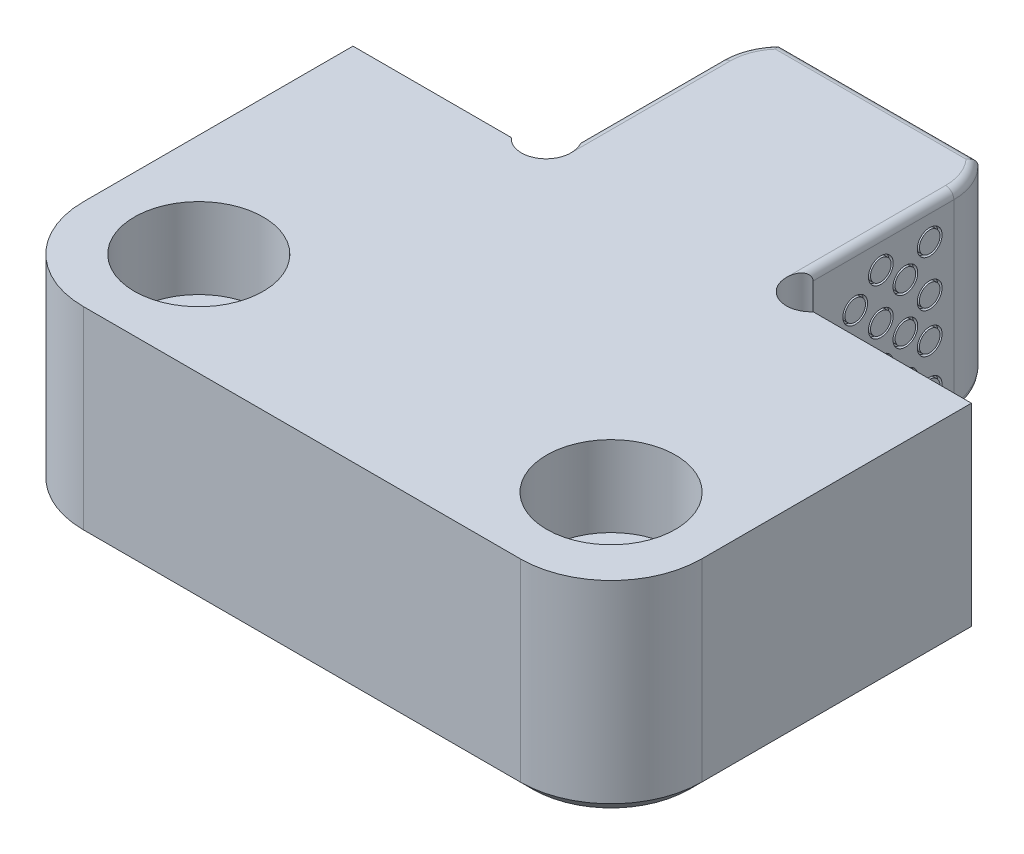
ISO-10303-21;
HEADER;
FILE_DESCRIPTION(('STEP AP214'),'2;1');
FILE_NAME('part.step','',(''),(''),'','','');
FILE_SCHEMA(('AUTOMOTIVE_DESIGN { 1 0 10303 214 1 1 1 1 }'));
ENDSEC;
DATA;
#1=APPLICATION_CONTEXT('core data for automotive mechanical design processes');
#2=APPLICATION_PROTOCOL_DEFINITION('international standard','automotive_design',2000,#1);
#3=PRODUCT_CONTEXT('',#1,'mechanical');
#4=PRODUCT('Part','Part','',(#3));
#5=PRODUCT_RELATED_PRODUCT_CATEGORY('part','',(#4));
#6=PRODUCT_DEFINITION_FORMATION('','',#4);
#7=PRODUCT_DEFINITION_CONTEXT('part definition',#1,'design');
#8=PRODUCT_DEFINITION('design','',#6,#7);
#9=PRODUCT_DEFINITION_SHAPE('','',#8);
#10=(LENGTH_UNIT() NAMED_UNIT(*) SI_UNIT(.MILLI.,.METRE.));
#11=(NAMED_UNIT(*) PLANE_ANGLE_UNIT() SI_UNIT($,.RADIAN.));
#12=(NAMED_UNIT(*) SI_UNIT($,.STERADIAN.) SOLID_ANGLE_UNIT());
#13=UNCERTAINTY_MEASURE_WITH_UNIT(LENGTH_MEASURE(1.E-05),#10,'distance_accuracy_value','');
#14=(GEOMETRIC_REPRESENTATION_CONTEXT(3) GLOBAL_UNCERTAINTY_ASSIGNED_CONTEXT((#13)) GLOBAL_UNIT_ASSIGNED_CONTEXT((#10,
#11,#12)) REPRESENTATION_CONTEXT('',''));
#15=CARTESIAN_POINT('',(0.,0.,0.));
#16=DIRECTION('',(0.,0.,1.));
#17=DIRECTION('',(1.,0.,0.));
#18=AXIS2_PLACEMENT_3D('',#15,#16,#17);
#19=CARTESIAN_POINT('',(-19.05,-12.6746,0.));
#20=DIRECTION('',(-1.,0.,0.));
#21=DIRECTION('',(0.,0.,1.));
#22=AXIS2_PLACEMENT_3D('',#19,#20,#21);
#23=PLANE('',#22);
#24=DIRECTION('',(0.,1.,0.));
#25=VECTOR('',#24,1.);
#26=CARTESIAN_POINT('',(-19.05,-12.6746,0.));
#27=LINE('',#26,#25);
#28=CARTESIAN_POINT('',(-19.05,-11.9126,0.));
#29=VERTEX_POINT('',#28);
#30=CARTESIAN_POINT('',(-19.05,0.,0.));
#31=VERTEX_POINT('',#30);
#32=EDGE_CURVE('E302',#29,#31,#27,.T.);
#33=ORIENTED_EDGE('',*,*,#32,.F.);
#34=DIRECTION('',(0.,0.,1.));
#35=VECTOR('',#34,1.);
#36=CARTESIAN_POINT('',(-19.05,-11.9126,16.6116));
#37=LINE('',#36,#35);
#38=CARTESIAN_POINT('',(-19.05,-11.9126,16.6116));
#39=VERTEX_POINT('',#38);
#40=EDGE_CURVE('E1457',#29,#39,#37,.T.);
#41=ORIENTED_EDGE('',*,*,#40,.T.);
#42=DIRECTION('',(0.,1.,0.));
#43=VECTOR('',#42,1.);
#44=CARTESIAN_POINT('',(-19.05,-12.6746,16.6116));
#45=LINE('',#44,#43);
#46=CARTESIAN_POINT('',(-19.05,0.,16.6116));
#47=VERTEX_POINT('',#46);
#48=EDGE_CURVE('E310',#39,#47,#45,.T.);
#49=ORIENTED_EDGE('',*,*,#48,.T.);
#50=DIRECTION('',(0.,0.,1.));
#51=VECTOR('',#50,1.);
#52=CARTESIAN_POINT('',(-19.05,0.,0.));
#53=LINE('',#52,#51);
#54=EDGE_CURVE('E273',#31,#47,#53,.T.);
#55=ORIENTED_EDGE('',*,*,#54,.F.);
#56=EDGE_LOOP('',(#33,#41,#49,#55));
#57=FACE_BOUND('',#56,.T.);
#58=ADVANCED_FACE('F35',(#57),#23,.T.);
#59=CARTESIAN_POINT('',(-7.14756,-12.6746,0.));
#60=DIRECTION('',(0.,0.,-1.));
#61=DIRECTION('',(-1.,0.,0.));
#62=AXIS2_PLACEMENT_3D('',#59,#60,#61);
#63=PLANE('',#62);
#64=DIRECTION('',(-1.,0.,0.));
#65=VECTOR('',#64,1.);
#66=CARTESIAN_POINT('',(-7.14756,-12.6746,0.));
#67=LINE('',#66,#65);
#68=CARTESIAN_POINT('',(-9.29948253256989,-12.6746,0.));
#69=VERTEX_POINT('',#68);
#70=CARTESIAN_POINT('',(-18.288,-12.6746,0.));
#71=VERTEX_POINT('',#70);
#72=EDGE_CURVE('E284',#69,#71,#67,.T.);
#73=ORIENTED_EDGE('',*,*,#72,.T.);
#74=DIRECTION('',(-0.707106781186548,0.707106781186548,0.));
#75=VECTOR('',#74,1.);
#76=CARTESIAN_POINT('',(-12.71778,-18.24482,0.));
#77=LINE('',#76,#75);
#78=EDGE_CURVE('E1447',#71,#29,#77,.T.);
#79=ORIENTED_EDGE('',*,*,#78,.T.);
#80=ORIENTED_EDGE('',*,*,#32,.T.);
#81=DIRECTION('',(-1.,0.,0.));
#82=VECTOR('',#81,1.);
#83=CARTESIAN_POINT('',(-7.14756,0.,0.));
#84=LINE('',#83,#82);
#85=CARTESIAN_POINT('',(-9.29948253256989,0.,0.));
#86=VERTEX_POINT('',#85);
#87=EDGE_CURVE('E285',#86,#31,#84,.T.);
#88=ORIENTED_EDGE('',*,*,#87,.F.);
#89=DIRECTION('',(0.,1.,0.));
#90=VECTOR('',#89,1.);
#91=CARTESIAN_POINT('',(-9.29948253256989,-12.6746,0.));
#92=LINE('',#91,#90);
#93=EDGE_CURVE('E261',#69,#86,#92,.T.);
#94=ORIENTED_EDGE('',*,*,#93,.F.);
#95=EDGE_LOOP('',(#73,#79,#80,#88,#94));
#96=FACE_BOUND('',#95,.T.);
#97=ADVANCED_FACE('F435',(#96),#63,.T.);
#98=CARTESIAN_POINT('',(-7.14756,-12.6746,0.));
#99=DIRECTION('',(-1.,0.,0.));
#100=DIRECTION('',(0.,0.,1.));
#101=AXIS2_PLACEMENT_3D('',#98,#99,#100);
#102=PLANE('',#101);
#103=CARTESIAN_POINT('',(-7.14756,-8.88741124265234,-4.7433361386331));
#104=DIRECTION('',(1.,0.,0.));
#105=DIRECTION('',(0.,0.,-1.));
#106=AXIS2_PLACEMENT_3D('',#103,#104,#105);
#107=CIRCLE('',#106,0.761999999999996);
#108=CARTESIAN_POINT('',(-7.14756,-8.88741124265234,-5.5053361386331));
#109=VERTEX_POINT('',#108);
#110=EDGE_CURVE('E874',#109,#109,#107,.T.);
#111=ORIENTED_EDGE('',*,*,#110,.T.);
#112=EDGE_LOOP('',(#111));
#113=FACE_BOUND('',#112,.T.);
#114=CARTESIAN_POINT('',(-7.14756,-8.80775238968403,-7.83409963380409));
#115=DIRECTION('',(1.,0.,0.));
#116=DIRECTION('',(0.,0.,-1.));
#117=AXIS2_PLACEMENT_3D('',#114,#115,#116);
#118=CIRCLE('',#117,0.761999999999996);
#119=CARTESIAN_POINT('',(-7.14756,-8.80775238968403,-8.59609963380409));
#120=VERTEX_POINT('',#119);
#121=EDGE_CURVE('E862',#120,#120,#118,.T.);
#122=ORIENTED_EDGE('',*,*,#121,.T.);
#123=EDGE_LOOP('',(#122));
#124=FACE_BOUND('',#123,.T.);
#125=CARTESIAN_POINT('',(-7.14756,-9.98670341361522,-6.32058142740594));
#126=DIRECTION('',(1.,0.,0.));
#127=DIRECTION('',(0.,0.,-1.));
#128=AXIS2_PLACEMENT_3D('',#125,#126,#127);
#129=CIRCLE('',#128,0.761999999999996);
#130=CARTESIAN_POINT('',(-7.14756,-9.98670341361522,-7.08258142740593));
#131=VERTEX_POINT('',#130);
#132=EDGE_CURVE('E850',#131,#131,#129,.T.);
#133=ORIENTED_EDGE('',*,*,#132,.T.);
#134=EDGE_LOOP('',(#133));
#135=FACE_BOUND('',#134,.T.);
#136=CARTESIAN_POINT('',(-7.14756,-6.19880228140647,-4.7433361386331));
#137=DIRECTION('',(1.,0.,0.));
#138=DIRECTION('',(0.,0.,-1.));
#139=AXIS2_PLACEMENT_3D('',#136,#137,#138);
#140=CIRCLE('',#139,0.761999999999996);
#141=CARTESIAN_POINT('',(-7.14756,-6.19880228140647,-5.5053361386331));
#142=VERTEX_POINT('',#141);
#143=EDGE_CURVE('E838',#142,#142,#140,.T.);
#144=ORIENTED_EDGE('',*,*,#143,.T.);
#145=EDGE_LOOP('',(#144));
#146=FACE_BOUND('',#145,.T.);
#147=CARTESIAN_POINT('',(-7.14756,-3.36447345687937,-4.7433361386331));
#148=DIRECTION('',(1.,0.,0.));
#149=DIRECTION('',(0.,0.,-1.));
#150=AXIS2_PLACEMENT_3D('',#147,#148,#149);
#151=CIRCLE('',#150,0.761999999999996);
#152=CARTESIAN_POINT('',(-7.14756,-3.36447345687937,-5.5053361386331));
#153=VERTEX_POINT('',#152);
#154=EDGE_CURVE('E826',#153,#153,#151,.T.);
#155=ORIENTED_EDGE('',*,*,#154,.T.);
#156=EDGE_LOOP('',(#155));
#157=FACE_BOUND('',#156,.T.);
#158=CARTESIAN_POINT('',(-7.14756,-9.98670341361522,-9.33168606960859));
#159=DIRECTION('',(1.,0.,0.));
#160=DIRECTION('',(0.,0.,-1.));
#161=AXIS2_PLACEMENT_3D('',#158,#159,#160);
#162=CIRCLE('',#161,0.761999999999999);
#163=CARTESIAN_POINT('',(-7.14756,-9.98670341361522,-10.0936860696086));
#164=VERTEX_POINT('',#163);
#165=EDGE_CURVE('E814',#164,#164,#162,.T.);
#166=ORIENTED_EDGE('',*,*,#165,.T.);
#167=EDGE_LOOP('',(#166));
#168=FACE_BOUND('',#167,.T.);
#169=CARTESIAN_POINT('',(-7.14756,-6.11914342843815,-7.83409963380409));
#170=DIRECTION('',(1.,0.,0.));
#171=DIRECTION('',(0.,0.,-1.));
#172=AXIS2_PLACEMENT_3D('',#169,#170,#171);
#173=CIRCLE('',#172,0.761999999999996);
#174=CARTESIAN_POINT('',(-7.14756,-6.11914342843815,-8.59609963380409));
#175=VERTEX_POINT('',#174);
#176=EDGE_CURVE('E802',#175,#175,#173,.T.);
#177=ORIENTED_EDGE('',*,*,#176,.T.);
#178=EDGE_LOOP('',(#177));
#179=FACE_BOUND('',#178,.T.);
#180=CARTESIAN_POINT('',(-7.14756,-3.28481460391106,-7.83409963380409));
#181=DIRECTION('',(1.,0.,0.));
#182=DIRECTION('',(0.,0.,-1.));
#183=AXIS2_PLACEMENT_3D('',#180,#181,#182);
#184=CIRCLE('',#183,0.761999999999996);
#185=CARTESIAN_POINT('',(-7.14756,-3.28481460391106,-8.59609963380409));
#186=VERTEX_POINT('',#185);
#187=EDGE_CURVE('E790',#186,#186,#184,.T.);
#188=ORIENTED_EDGE('',*,*,#187,.T.);
#189=EDGE_LOOP('',(#188));
#190=FACE_BOUND('',#189,.T.);
#191=CARTESIAN_POINT('',(-7.14756,-7.29809445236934,-6.32058142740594));
#192=DIRECTION('',(1.,0.,0.));
#193=DIRECTION('',(0.,0.,-1.));
#194=AXIS2_PLACEMENT_3D('',#191,#192,#193);
#195=CIRCLE('',#194,0.761999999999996);
#196=CARTESIAN_POINT('',(-7.14756,-7.29809445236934,-7.08258142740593));
#197=VERTEX_POINT('',#196);
#198=EDGE_CURVE('E778',#197,#197,#195,.T.);
#199=ORIENTED_EDGE('',*,*,#198,.T.);
#200=EDGE_LOOP('',(#199));
#201=FACE_BOUND('',#200,.T.);
#202=CARTESIAN_POINT('',(-7.14756,-4.84460178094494,-6.32058142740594));
#203=DIRECTION('',(1.,0.,0.));
#204=DIRECTION('',(0.,0.,-1.));
#205=AXIS2_PLACEMENT_3D('',#202,#203,#204);
#206=CIRCLE('',#205,0.761999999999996);
#207=CARTESIAN_POINT('',(-7.14756,-4.84460178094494,-7.08258142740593));
#208=VERTEX_POINT('',#207);
#209=EDGE_CURVE('E766',#208,#208,#206,.T.);
#210=ORIENTED_EDGE('',*,*,#209,.T.);
#211=EDGE_LOOP('',(#210));
#212=FACE_BOUND('',#211,.T.);
#213=CARTESIAN_POINT('',(-7.14756,-2.01027295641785,-6.32058142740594));
#214=DIRECTION('',(1.,0.,0.));
#215=DIRECTION('',(0.,0.,-1.));
#216=AXIS2_PLACEMENT_3D('',#213,#214,#215);
#217=CIRCLE('',#216,0.761999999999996);
#218=CARTESIAN_POINT('',(-7.14756,-2.01027295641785,-7.08258142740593));
#219=VERTEX_POINT('',#218);
#220=EDGE_CURVE('E754',#219,#219,#217,.T.);
#221=ORIENTED_EDGE('',*,*,#220,.T.);
#222=EDGE_LOOP('',(#221));
#223=FACE_BOUND('',#222,.T.);
#224=CARTESIAN_POINT('',(-7.14756,-7.29809445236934,-9.33168606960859));
#225=DIRECTION('',(1.,0.,0.));
#226=DIRECTION('',(0.,0.,-1.));
#227=AXIS2_PLACEMENT_3D('',#224,#225,#226);
#228=CIRCLE('',#227,0.761999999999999);
#229=CARTESIAN_POINT('',(-7.14756,-7.29809445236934,-10.0936860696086));
#230=VERTEX_POINT('',#229);
#231=EDGE_CURVE('E742',#230,#230,#228,.T.);
#232=ORIENTED_EDGE('',*,*,#231,.T.);
#233=EDGE_LOOP('',(#232));
#234=FACE_BOUND('',#233,.T.);
#235=CARTESIAN_POINT('',(-7.14756,-4.84460178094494,-9.33168606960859));
#236=DIRECTION('',(1.,0.,0.));
#237=DIRECTION('',(0.,0.,-1.));
#238=AXIS2_PLACEMENT_3D('',#235,#236,#237);
#239=CIRCLE('',#238,0.761999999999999);
#240=CARTESIAN_POINT('',(-7.14756,-4.84460178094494,-10.0936860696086));
#241=VERTEX_POINT('',#240);
#242=EDGE_CURVE('E730',#241,#241,#239,.T.);
#243=ORIENTED_EDGE('',*,*,#242,.T.);
#244=EDGE_LOOP('',(#243));
#245=FACE_BOUND('',#244,.T.);
#246=CARTESIAN_POINT('',(-7.14756,-2.01027295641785,-9.33168606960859));
#247=DIRECTION('',(1.,0.,0.));
#248=DIRECTION('',(0.,0.,-1.));
#249=AXIS2_PLACEMENT_3D('',#246,#247,#248);
#250=CIRCLE('',#249,0.761999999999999);
#251=CARTESIAN_POINT('',(-7.14756,-2.01027295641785,-10.0936860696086));
#252=VERTEX_POINT('',#251);
#253=EDGE_CURVE('E718',#252,#252,#250,.T.);
#254=ORIENTED_EDGE('',*,*,#253,.T.);
#255=EDGE_LOOP('',(#254));
#256=FACE_BOUND('',#255,.T.);
#257=CARTESIAN_POINT('',(-7.14756,51.0794,-3.20039999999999));
#258=DIRECTION('',(-1.,0.,0.));
#259=DIRECTION('',(0.,0.,1.));
#260=AXIS2_PLACEMENT_3D('',#257,#258,#259);
#261=CIRCLE('',#260,62.992);
#262=CARTESIAN_POINT('',(-7.14756,-11.4500143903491,-10.8204));
#263=VERTEX_POINT('',#262);
#264=CARTESIAN_POINT('',(-7.14756,-11.9126,-3.20039999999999));
#265=VERTEX_POINT('',#264);
#266=EDGE_CURVE('E329',#263,#265,#261,.T.);
#267=ORIENTED_EDGE('',*,*,#266,.T.);
#268=DIRECTION('',(0.,0.,-1.));
#269=VECTOR('',#268,1.);
#270=CARTESIAN_POINT('',(-7.14756,-11.9126,-2.15192253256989));
#271=LINE('',#270,#269);
#272=CARTESIAN_POINT('',(-7.14756,-11.9126,-2.15192253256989));
#273=VERTEX_POINT('',#272);
#274=EDGE_CURVE('E331',#265,#273,#271,.F.);
#275=ORIENTED_EDGE('',*,*,#274,.T.);
#276=DIRECTION('',(0.,1.,0.));
#277=VECTOR('',#276,1.);
#278=CARTESIAN_POINT('',(-7.14756,-12.6746,-2.15192253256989));
#279=LINE('',#278,#277);
#280=CARTESIAN_POINT('',(-7.14756,-0.508,-2.15192253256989));
#281=VERTEX_POINT('',#280);
#282=EDGE_CURVE('E257',#281,#273,#279,.F.);
#283=ORIENTED_EDGE('',*,*,#282,.F.);
#284=DIRECTION('',(0.,0.,1.));
#285=VECTOR('',#284,1.);
#286=CARTESIAN_POINT('',(-7.14756,-0.508,0.));
#287=LINE('',#286,#285);
#288=CARTESIAN_POINT('',(-7.14756,-0.508,-10.8204));
#289=VERTEX_POINT('',#288);
#290=EDGE_CURVE('E327',#281,#289,#287,.F.);
#291=ORIENTED_EDGE('',*,*,#290,.T.);
#292=DIRECTION('',(0.,1.,0.));
#293=VECTOR('',#292,1.);
#294=CARTESIAN_POINT('',(-7.14756,-12.6746,-10.8204));
#295=LINE('',#294,#293);
#296=EDGE_CURVE('E277',#263,#289,#295,.T.);
#297=ORIENTED_EDGE('',*,*,#296,.F.);
#298=EDGE_LOOP('',(#267,#275,#283,#291,#297));
#299=FACE_BOUND('',#298,.T.);
#300=ADVANCED_FACE('F441',(#113,#124,#135,#146,#157,#168,#179,#190,#201,#212,#223,#234,#245,
#256,#299),#102,.T.);
#301=CARTESIAN_POINT('',(-7.14756,-12.6746,-13.3604));
#302=DIRECTION('',(0.,0.,-1.));
#303=DIRECTION('',(-1.,0.,0.));
#304=AXIS2_PLACEMENT_3D('',#301,#302,#303);
#305=PLANE('',#304);
#306=DIRECTION('',(-1.,0.,0.));
#307=VECTOR('',#306,1.);
#308=CARTESIAN_POINT('',(-6.09515001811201,-11.1687402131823,-13.3604));
#309=LINE('',#308,#307);
#310=CARTESIAN_POINT('',(6.09440223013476,-11.1687402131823,-13.3604));
#311=VERTEX_POINT('',#310);
#312=CARTESIAN_POINT('',(-6.09440223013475,-11.1687402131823,-13.3604));
#313=VERTEX_POINT('',#312);
#314=EDGE_CURVE('E1485',#311,#313,#309,.T.);
#315=ORIENTED_EDGE('',*,*,#314,.T.);
#316=CARTESIAN_POINT('',(-7.06817242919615,-11.5252129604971,-10.069456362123));
#317=CARTESIAN_POINT('',(-7.07994724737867,-12.0420558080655,-10.1245241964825));
#318=CARTESIAN_POINT('',(-6.5714018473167,-12.0300888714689,-10.2319300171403));
#319=CARTESIAN_POINT('',(-7.09455405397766,-11.5134188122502,-10.1927862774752));
#320=CARTESIAN_POINT('',(-7.10457209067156,-12.0283638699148,-10.2490977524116));
#321=CARTESIAN_POINT('',(-6.59405177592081,-12.0181996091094,-10.338668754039));
#322=CARTESIAN_POINT('',(-7.11439248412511,-11.5012231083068,-10.3173996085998));
#323=CARTESIAN_POINT('',(-7.12257441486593,-12.0141543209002,-10.37497916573));
#324=CARTESIAN_POINT('',(-6.61108404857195,-12.0059055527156,-10.4465182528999));
#325=CARTESIAN_POINT('',(-7.14090894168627,-11.4761204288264,-10.5681349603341));
#326=CARTESIAN_POINT('',(-7.14513944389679,-11.9848506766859,-10.6278684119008));
#327=CARTESIAN_POINT('',(-6.63384973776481,-11.9806004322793,-10.6635229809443));
#328=CARTESIAN_POINT('',(-7.1475651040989,-11.4632123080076,-10.6942591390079));
#329=CARTESIAN_POINT('',(-7.14972824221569,-11.969763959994,-10.7548272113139));
#330=CARTESIAN_POINT('',(-6.63956438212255,-11.9675882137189,-10.7726800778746));
#331=CARTESIAN_POINT('',(-7.14755176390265,-11.4287179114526,-11.023943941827));
#332=CARTESIAN_POINT('',(-7.14408063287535,-11.9294430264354,-11.085687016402));
#333=CARTESIAN_POINT('',(-6.63955292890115,-11.9328156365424,-11.0580134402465));
#334=CARTESIAN_POINT('',(-7.13019903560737,-11.4066668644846,-11.22753132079));
#335=CARTESIAN_POINT('',(-7.12320613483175,-11.9036060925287,-11.289553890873));
#336=CARTESIAN_POINT('',(-6.62465475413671,-11.9105867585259,-11.2342128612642));
#337=CARTESIAN_POINT('',(-7.06133034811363,-11.3617689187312,-11.6287496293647));
#338=CARTESIAN_POINT('',(-7.04717613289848,-11.8509412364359,-11.6900498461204));
#339=CARTESIAN_POINT('',(-6.56552758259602,-11.8653267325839,-11.5814565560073));
#340=CARTESIAN_POINT('',(-7.0097956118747,-11.3389215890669,-11.8263772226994));
#341=CARTESIAN_POINT('',(-6.9922798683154,-11.8241354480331,-11.8866128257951));
#342=CARTESIAN_POINT('',(-6.5212824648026,-11.8422951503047,-11.7524979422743));
#343=CARTESIAN_POINT('',(-6.87404981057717,-11.2932653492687,-12.2100425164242));
#344=CARTESIAN_POINT('',(-6.85018387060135,-11.7705754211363,-12.266860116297));
#345=CARTESIAN_POINT('',(-6.404737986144,-11.7962707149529,-12.0845499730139));
#346=CARTESIAN_POINT('',(-6.78984820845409,-11.2704564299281,-12.3960835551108));
#347=CARTESIAN_POINT('',(-6.76326222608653,-11.7438273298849,-12.4506017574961));
#348=CARTESIAN_POINT('',(-6.3324467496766,-11.7732778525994,-12.2455635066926));
#349=CARTESIAN_POINT('',(-6.59113064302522,-11.2258020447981,-12.7513368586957));
#350=CARTESIAN_POINT('',(-6.55994137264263,-11.6915170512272,-12.800154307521));
#351=CARTESIAN_POINT('',(-6.16183789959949,-11.7282633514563,-12.5530257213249));
#352=CARTESIAN_POINT('',(-6.47661527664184,-11.2039565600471,-12.9205494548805));
#353=CARTESIAN_POINT('',(-6.44375512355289,-11.6659416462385,-12.9661311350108));
#354=CARTESIAN_POINT('',(-6.06352079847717,-11.7062416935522,-12.6994746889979));
#355=CARTESIAN_POINT('',(-6.220416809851,-11.1622108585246,-13.2372576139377));
#356=CARTESIAN_POINT('',(-6.18540760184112,-11.6171522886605,-13.2756231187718));
#357=CARTESIAN_POINT('',(-5.84356175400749,-11.6641593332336,-12.9735771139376));
#358=CARTESIAN_POINT('',(-6.07875834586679,-11.1423089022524,-13.3847726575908));
#359=CARTESIAN_POINT('',(-6.04338915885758,-11.5939058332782,-13.4194056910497));
#360=CARTESIAN_POINT('',(-5.72194096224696,-11.6440968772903,-13.1012474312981));
#361=CARTESIAN_POINT('',(-5.84894678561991,-11.1146334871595,-13.5865591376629));
#362=CARTESIAN_POINT('',(-5.81372433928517,-11.5615964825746,-13.6156981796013));
#363=CARTESIAN_POINT('',(-5.52463638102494,-11.6161982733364,-13.275888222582));
#364=CARTESIAN_POINT('',(-5.7693730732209,-11.1057639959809,-13.6506243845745));
#365=CARTESIAN_POINT('',(-5.7345005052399,-11.5512629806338,-13.6778446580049));
#366=CARTESIAN_POINT('',(-5.45631841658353,-11.6072572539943,-13.3313349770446));
#367=CARTESIAN_POINT('',(-5.60497449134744,-11.0888598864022,-13.7718079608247));
#368=CARTESIAN_POINT('',(-5.57116765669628,-11.5315866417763,-13.7952194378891));
#369=CARTESIAN_POINT('',(-5.3151741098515,-11.5902168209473,-13.4362161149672));
#370=CARTESIAN_POINT('',(-5.5201490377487,-11.0808253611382,-13.8289255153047));
#371=CARTESIAN_POINT('',(-5.48704963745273,-11.5222381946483,-13.850484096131));
#372=CARTESIAN_POINT('',(-5.24234726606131,-11.5821175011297,-13.4856498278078));
#373=CARTESIAN_POINT('',(-5.43295521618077,-11.0732595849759,-13.8823695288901));
#374=CARTESIAN_POINT('',(-5.40061610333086,-11.5134311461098,-13.9021909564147));
#375=CARTESIAN_POINT('',(-5.16748706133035,-11.5744907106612,-13.531904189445));
#376=(BOUNDED_SURFACE() B_SPLINE_SURFACE(3,2,((#316,#317,#318),(#319,#320,#321),(#322,#323,
#324),(#325,#326,#327),(#328,#329,#330),(#331,#332,#333),(#334,#335,#336),(#337,#338,#339),
(#340,#341,#342),(#343,#344,#345),(#346,#347,#348),(#349,#350,#351),(#352,#353,#354),(#355,#356,
#357),(#358,#359,#360),(#361,#362,#363),(#364,#365,#366),(#367,#368,#369),(#370,#371,#372),
(#373,#374,#375)),.UNSPECIFIED.,.F.,.F.,.F.) B_SPLINE_SURFACE_WITH_KNOTS((4,2,2,2,2,2,2,2,2,4),
(3,3),(0.,0.326508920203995,0.653558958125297,1.18129480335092,1.70932078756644,
2.23719392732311,2.76505667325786,3.29244255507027,3.55663009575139,3.82084707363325),(0.,1.),
.UNSPECIFIED.) GEOMETRIC_REPRESENTATION_ITEM() RATIONAL_B_SPLINE_SURFACE(((1.,0.698872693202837,
1.),(1.,0.700106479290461,1.),(1.,0.701413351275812,1.),(1.,0.704162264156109,1.),(1.,
0.705604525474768,1.),(1.,0.709530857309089,1.),(1.,0.712111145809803,1.),(1.,0.717484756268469,
1.),(1.,0.720278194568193,1.),(1.,0.725951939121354,1.),(1.,0.728832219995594,1.),(1.,
0.734535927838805,1.),(1.,0.737359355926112,1.),(1.,0.742796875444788,1.),(1.,0.745411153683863,
1.),(1.,0.749065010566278,1.),(1.,0.750239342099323,1.),(1.,0.752482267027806,1.),(1.,
0.753550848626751,1.),(1.,0.754558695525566,1.))) REPRESENTATION_ITEM('') SURFACE());
#377=CARTESIAN_POINT('',(-6.09440223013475,-11.1687402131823,-13.3604));
#378=CARTESIAN_POINT('',(-6.09463864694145,-11.164870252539,-13.3604));
#379=CARTESIAN_POINT('',(-6.09481917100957,-11.1609984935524,-13.3604));
#380=CARTESIAN_POINT('',(-6.09506843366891,-11.1532513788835,-13.3604));
#381=CARTESIAN_POINT('',(-6.09513717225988,-11.1493760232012,-13.3604));
#382=CARTESIAN_POINT('',(-6.09515001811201,-11.1454988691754,-13.3604));
#383=B_SPLINE_CURVE_WITH_KNOTS('',3,(#377,#378,#379,#380,#381,#382),.UNSPECIFIED.,.F.,.F.,(4,2,
4),(0.,0.0116278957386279,0.0232557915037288),.UNSPECIFIED.);
#384=CARTESIAN_POINT('',(-6.09515001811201,-11.1454988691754,-13.3604));
#385=VERTEX_POINT('',#384);
#386=EDGE_CURVE('E1393',#313,#385,#383,.T.);
#387=ORIENTED_EDGE('',*,*,#386,.T.);
#388=DIRECTION('',(0.,1.,0.));
#389=VECTOR('',#388,1.);
#390=CARTESIAN_POINT('',(-6.09515001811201,-12.6746,-13.3604));
#391=LINE('',#390,#389);
#392=CARTESIAN_POINT('',(-6.09515001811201,-0.508,-13.3604));
#393=VERTEX_POINT('',#392);
#394=EDGE_CURVE('E274',#385,#393,#391,.T.);
#395=ORIENTED_EDGE('',*,*,#394,.T.);
#396=DIRECTION('',(-1.,0.,0.));
#397=VECTOR('',#396,1.);
#398=CARTESIAN_POINT('',(-7.14756,-0.508,-13.3604));
#399=LINE('',#398,#397);
#400=CARTESIAN_POINT('',(6.09515001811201,-0.508,-13.3604));
#401=VERTEX_POINT('',#400);
#402=EDGE_CURVE('E1509',#393,#401,#399,.F.);
#403=ORIENTED_EDGE('',*,*,#402,.T.);
#404=DIRECTION('',(0.,1.,0.));
#405=VECTOR('',#404,1.);
#406=CARTESIAN_POINT('',(6.09515001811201,-12.6746,-13.3604));
#407=LINE('',#406,#405);
#408=CARTESIAN_POINT('',(6.09515001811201,-11.1454988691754,-13.3604));
#409=VERTEX_POINT('',#408);
#410=EDGE_CURVE('E270',#409,#401,#407,.T.);
#411=ORIENTED_EDGE('',*,*,#410,.F.);
#412=CARTESIAN_POINT('',(6.5714018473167,-12.0300888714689,-10.2319300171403));
#413=CARTESIAN_POINT('',(7.07994724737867,-12.0420558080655,-10.1245241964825));
#414=CARTESIAN_POINT('',(7.06817242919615,-11.5252129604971,-10.069456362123));
#415=CARTESIAN_POINT('',(6.59405177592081,-12.0181996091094,-10.338668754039));
#416=CARTESIAN_POINT('',(7.10457209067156,-12.0283638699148,-10.2490977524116));
#417=CARTESIAN_POINT('',(7.09455405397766,-11.5134188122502,-10.1927862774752));
#418=CARTESIAN_POINT('',(6.61108404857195,-12.0059055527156,-10.4465182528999));
#419=CARTESIAN_POINT('',(7.12257441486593,-12.0141543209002,-10.37497916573));
#420=CARTESIAN_POINT('',(7.1143924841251,-11.5012231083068,-10.3173996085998));
#421=CARTESIAN_POINT('',(6.63384973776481,-11.9806004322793,-10.6635229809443));
#422=CARTESIAN_POINT('',(7.14513944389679,-11.9848506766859,-10.6278684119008));
#423=CARTESIAN_POINT('',(7.14090894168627,-11.4761204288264,-10.5681349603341));
#424=CARTESIAN_POINT('',(6.63956438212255,-11.9675882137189,-10.7726800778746));
#425=CARTESIAN_POINT('',(7.14972824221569,-11.969763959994,-10.7548272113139));
#426=CARTESIAN_POINT('',(7.1475651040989,-11.4632123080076,-10.6942591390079));
#427=CARTESIAN_POINT('',(6.63955292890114,-11.9328156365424,-11.0580134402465));
#428=CARTESIAN_POINT('',(7.14408063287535,-11.9294430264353,-11.085687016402));
#429=CARTESIAN_POINT('',(7.14755176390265,-11.4287179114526,-11.023943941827));
#430=CARTESIAN_POINT('',(6.62465475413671,-11.910586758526,-11.2342128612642));
#431=CARTESIAN_POINT('',(7.12320613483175,-11.9036060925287,-11.289553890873));
#432=CARTESIAN_POINT('',(7.13019903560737,-11.4066668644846,-11.22753132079));
#433=CARTESIAN_POINT('',(6.56552758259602,-11.8653267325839,-11.5814565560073));
#434=CARTESIAN_POINT('',(7.04717613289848,-11.8509412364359,-11.6900498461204));
#435=CARTESIAN_POINT('',(7.06133034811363,-11.3617689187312,-11.6287496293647));
#436=CARTESIAN_POINT('',(6.5212824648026,-11.8422951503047,-11.7524979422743));
#437=CARTESIAN_POINT('',(6.9922798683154,-11.8241354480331,-11.8866128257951));
#438=CARTESIAN_POINT('',(7.00979561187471,-11.3389215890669,-11.8263772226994));
#439=CARTESIAN_POINT('',(6.404737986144,-11.7962707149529,-12.0845499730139));
#440=CARTESIAN_POINT('',(6.85018387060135,-11.7705754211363,-12.266860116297));
#441=CARTESIAN_POINT('',(6.87404981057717,-11.2932653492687,-12.2100425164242));
#442=CARTESIAN_POINT('',(6.3324467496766,-11.7732778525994,-12.2455635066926));
#443=CARTESIAN_POINT('',(6.76326222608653,-11.7438273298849,-12.4506017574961));
#444=CARTESIAN_POINT('',(6.78984820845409,-11.2704564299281,-12.3960835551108));
#445=CARTESIAN_POINT('',(6.16183789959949,-11.7282633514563,-12.5530257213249));
#446=CARTESIAN_POINT('',(6.55994137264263,-11.6915170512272,-12.800154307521));
#447=CARTESIAN_POINT('',(6.59113064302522,-11.2258020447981,-12.7513368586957));
#448=CARTESIAN_POINT('',(6.06352079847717,-11.7062416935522,-12.6994746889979));
#449=CARTESIAN_POINT('',(6.44375512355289,-11.6659416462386,-12.9661311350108));
#450=CARTESIAN_POINT('',(6.47661527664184,-11.2039565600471,-12.9205494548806));
#451=CARTESIAN_POINT('',(5.84356175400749,-11.6641593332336,-12.9735771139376));
#452=CARTESIAN_POINT('',(6.18540760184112,-11.6171522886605,-13.2756231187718));
#453=CARTESIAN_POINT('',(6.220416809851,-11.1622108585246,-13.2372576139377));
#454=CARTESIAN_POINT('',(5.72194096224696,-11.6440968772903,-13.1012474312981));
#455=CARTESIAN_POINT('',(6.04338915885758,-11.5939058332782,-13.4194056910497));
#456=CARTESIAN_POINT('',(6.07875834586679,-11.1423089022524,-13.3847726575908));
#457=CARTESIAN_POINT('',(5.52463638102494,-11.6161982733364,-13.275888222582));
#458=CARTESIAN_POINT('',(5.81372433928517,-11.5615964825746,-13.6156981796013));
#459=CARTESIAN_POINT('',(5.84894678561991,-11.1146334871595,-13.5865591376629));
#460=CARTESIAN_POINT('',(5.45631841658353,-11.6072572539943,-13.3313349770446));
#461=CARTESIAN_POINT('',(5.7345005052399,-11.5512629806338,-13.6778446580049));
#462=CARTESIAN_POINT('',(5.7693730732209,-11.1057639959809,-13.6506243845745));
#463=CARTESIAN_POINT('',(5.3151741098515,-11.5902168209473,-13.4362161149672));
#464=CARTESIAN_POINT('',(5.57116765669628,-11.5315866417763,-13.7952194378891));
#465=CARTESIAN_POINT('',(5.60497449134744,-11.0888598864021,-13.7718079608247));
#466=CARTESIAN_POINT('',(5.24234726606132,-11.5821175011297,-13.4856498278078));
#467=CARTESIAN_POINT('',(5.48704963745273,-11.5222381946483,-13.850484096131));
#468=CARTESIAN_POINT('',(5.5201490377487,-11.0808253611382,-13.8289255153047));
#469=CARTESIAN_POINT('',(5.16748706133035,-11.5744907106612,-13.531904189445));
#470=CARTESIAN_POINT('',(5.40061610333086,-11.5134311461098,-13.9021909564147));
#471=CARTESIAN_POINT('',(5.43295521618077,-11.0732595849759,-13.8823695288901));
#472=(BOUNDED_SURFACE() B_SPLINE_SURFACE(3,2,((#412,#413,#414),(#415,#416,#417),(#418,#419,
#420),(#421,#422,#423),(#424,#425,#426),(#427,#428,#429),(#430,#431,#432),(#433,#434,#435),
(#436,#437,#438),(#439,#440,#441),(#442,#443,#444),(#445,#446,#447),(#448,#449,#450),(#451,#452,
#453),(#454,#455,#456),(#457,#458,#459),(#460,#461,#462),(#463,#464,#465),(#466,#467,#468),
(#469,#470,#471)),.UNSPECIFIED.,.F.,.F.,.F.) B_SPLINE_SURFACE_WITH_KNOTS((4,2,2,2,2,2,2,2,2,4),
(3,3),(0.,0.326508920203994,0.653558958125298,1.18129480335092,1.70932078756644,
2.23719392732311,2.76505667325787,3.29244255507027,3.55663009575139,3.82084707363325),(0.,1.),
.UNSPECIFIED.) GEOMETRIC_REPRESENTATION_ITEM() RATIONAL_B_SPLINE_SURFACE(((1.,0.698872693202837,
1.),(1.,0.700106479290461,1.),(1.,0.701413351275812,1.),(1.,0.704162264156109,1.),(1.,
0.705604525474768,1.),(1.,0.709530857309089,1.),(1.,0.712111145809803,1.),(1.,0.717484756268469,
1.),(1.,0.720278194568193,1.),(1.,0.725951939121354,1.),(1.,0.728832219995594,1.),(1.,
0.734535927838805,1.),(1.,0.737359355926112,1.),(1.,0.742796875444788,1.),(1.,0.745411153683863,
1.),(1.,0.749065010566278,1.),(1.,0.750239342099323,1.),(1.,0.752482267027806,1.),(1.,
0.753550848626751,1.),(1.,0.754558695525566,1.))) REPRESENTATION_ITEM('') SURFACE());
#473=CARTESIAN_POINT('',(6.09515001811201,-11.1454988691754,-13.3604));
#474=CARTESIAN_POINT('',(6.09513717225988,-11.149376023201,-13.3604));
#475=CARTESIAN_POINT('',(6.09506843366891,-11.1532513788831,-13.3604));
#476=CARTESIAN_POINT('',(6.09481917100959,-11.160998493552,-13.3604));
#477=CARTESIAN_POINT('',(6.09463864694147,-11.1648702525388,-13.3604));
#478=CARTESIAN_POINT('',(6.09440223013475,-11.1687402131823,-13.3604));
#479=B_SPLINE_CURVE_WITH_KNOTS('',3,(#473,#474,#475,#476,#477,#478),.UNSPECIFIED.,.F.,.F.,(4,2,
4),(0.,0.0116278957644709,0.0232557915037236),.UNSPECIFIED.);
#480=EDGE_CURVE('E1398',#409,#311,#479,.T.);
#481=ORIENTED_EDGE('',*,*,#480,.T.);
#482=EDGE_LOOP('',(#315,#387,#395,#403,#411,#481));
#483=FACE_BOUND('',#482,.T.);
#484=ADVANCED_FACE('F907',(#483),#305,.T.);
#485=CARTESIAN_POINT('',(7.14756,-12.6746,-13.3604));
#486=DIRECTION('',(1.,0.,0.));
#487=DIRECTION('',(0.,0.,-1.));
#488=AXIS2_PLACEMENT_3D('',#485,#486,#487);
#489=PLANE('',#488);
#490=CARTESIAN_POINT('',(7.14756,-8.88741124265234,-4.7433361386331));
#491=DIRECTION('',(1.,0.,0.));
#492=DIRECTION('',(0.,0.,-1.));
#493=AXIS2_PLACEMENT_3D('',#490,#491,#492);
#494=CIRCLE('',#493,0.761999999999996);
#495=CARTESIAN_POINT('',(7.14756,-8.88741124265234,-5.5053361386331));
#496=VERTEX_POINT('',#495);
#497=EDGE_CURVE('E706',#496,#496,#494,.T.);
#498=ORIENTED_EDGE('',*,*,#497,.F.);
#499=EDGE_LOOP('',(#498));
#500=FACE_BOUND('',#499,.T.);
#501=CARTESIAN_POINT('',(7.14756,-8.80775238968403,-7.83409963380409));
#502=DIRECTION('',(1.,0.,0.));
#503=DIRECTION('',(0.,0.,-1.));
#504=AXIS2_PLACEMENT_3D('',#501,#502,#503);
#505=CIRCLE('',#504,0.761999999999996);
#506=CARTESIAN_POINT('',(7.14756,-8.80775238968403,-8.59609963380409));
#507=VERTEX_POINT('',#506);
#508=EDGE_CURVE('E694',#507,#507,#505,.T.);
#509=ORIENTED_EDGE('',*,*,#508,.F.);
#510=EDGE_LOOP('',(#509));
#511=FACE_BOUND('',#510,.T.);
#512=CARTESIAN_POINT('',(7.14756,-9.98670341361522,-6.32058142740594));
#513=DIRECTION('',(1.,0.,0.));
#514=DIRECTION('',(0.,0.,-1.));
#515=AXIS2_PLACEMENT_3D('',#512,#513,#514);
#516=CIRCLE('',#515,0.761999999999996);
#517=CARTESIAN_POINT('',(7.14756,-9.98670341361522,-7.08258142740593));
#518=VERTEX_POINT('',#517);
#519=EDGE_CURVE('E682',#518,#518,#516,.T.);
#520=ORIENTED_EDGE('',*,*,#519,.F.);
#521=EDGE_LOOP('',(#520));
#522=FACE_BOUND('',#521,.T.);
#523=CARTESIAN_POINT('',(7.14756,-6.19880228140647,-4.7433361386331));
#524=DIRECTION('',(1.,0.,0.));
#525=DIRECTION('',(0.,0.,-1.));
#526=AXIS2_PLACEMENT_3D('',#523,#524,#525);
#527=CIRCLE('',#526,0.761999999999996);
#528=CARTESIAN_POINT('',(7.14756,-6.19880228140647,-5.5053361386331));
#529=VERTEX_POINT('',#528);
#530=EDGE_CURVE('E670',#529,#529,#527,.T.);
#531=ORIENTED_EDGE('',*,*,#530,.F.);
#532=EDGE_LOOP('',(#531));
#533=FACE_BOUND('',#532,.T.);
#534=CARTESIAN_POINT('',(7.14756,-3.36447345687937,-4.7433361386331));
#535=DIRECTION('',(1.,0.,0.));
#536=DIRECTION('',(0.,0.,-1.));
#537=AXIS2_PLACEMENT_3D('',#534,#535,#536);
#538=CIRCLE('',#537,0.761999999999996);
#539=CARTESIAN_POINT('',(7.14756,-3.36447345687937,-5.5053361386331));
#540=VERTEX_POINT('',#539);
#541=EDGE_CURVE('E658',#540,#540,#538,.T.);
#542=ORIENTED_EDGE('',*,*,#541,.F.);
#543=EDGE_LOOP('',(#542));
#544=FACE_BOUND('',#543,.T.);
#545=CARTESIAN_POINT('',(7.14756,-9.98670341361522,-9.33168606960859));
#546=DIRECTION('',(1.,0.,0.));
#547=DIRECTION('',(0.,0.,-1.));
#548=AXIS2_PLACEMENT_3D('',#545,#546,#547);
#549=CIRCLE('',#548,0.761999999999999);
#550=CARTESIAN_POINT('',(7.14756,-9.98670341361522,-10.0936860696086));
#551=VERTEX_POINT('',#550);
#552=EDGE_CURVE('E646',#551,#551,#549,.T.);
#553=ORIENTED_EDGE('',*,*,#552,.F.);
#554=EDGE_LOOP('',(#553));
#555=FACE_BOUND('',#554,.T.);
#556=CARTESIAN_POINT('',(7.14756,-6.11914342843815,-7.83409963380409));
#557=DIRECTION('',(1.,0.,0.));
#558=DIRECTION('',(0.,0.,-1.));
#559=AXIS2_PLACEMENT_3D('',#556,#557,#558);
#560=CIRCLE('',#559,0.761999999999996);
#561=CARTESIAN_POINT('',(7.14756,-6.11914342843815,-8.59609963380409));
#562=VERTEX_POINT('',#561);
#563=EDGE_CURVE('E634',#562,#562,#560,.T.);
#564=ORIENTED_EDGE('',*,*,#563,.F.);
#565=EDGE_LOOP('',(#564));
#566=FACE_BOUND('',#565,.T.);
#567=CARTESIAN_POINT('',(7.14756,-3.28481460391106,-7.83409963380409));
#568=DIRECTION('',(1.,0.,0.));
#569=DIRECTION('',(0.,0.,-1.));
#570=AXIS2_PLACEMENT_3D('',#567,#568,#569);
#571=CIRCLE('',#570,0.761999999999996);
#572=CARTESIAN_POINT('',(7.14756,-3.28481460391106,-8.59609963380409));
#573=VERTEX_POINT('',#572);
#574=EDGE_CURVE('E622',#573,#573,#571,.T.);
#575=ORIENTED_EDGE('',*,*,#574,.F.);
#576=EDGE_LOOP('',(#575));
#577=FACE_BOUND('',#576,.T.);
#578=CARTESIAN_POINT('',(7.14756,-7.29809445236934,-6.32058142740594));
#579=DIRECTION('',(1.,0.,0.));
#580=DIRECTION('',(0.,0.,-1.));
#581=AXIS2_PLACEMENT_3D('',#578,#579,#580);
#582=CIRCLE('',#581,0.761999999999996);
#583=CARTESIAN_POINT('',(7.14756,-7.29809445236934,-7.08258142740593));
#584=VERTEX_POINT('',#583);
#585=EDGE_CURVE('E610',#584,#584,#582,.T.);
#586=ORIENTED_EDGE('',*,*,#585,.F.);
#587=EDGE_LOOP('',(#586));
#588=FACE_BOUND('',#587,.T.);
#589=CARTESIAN_POINT('',(7.14756,-4.84460178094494,-6.32058142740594));
#590=DIRECTION('',(1.,0.,0.));
#591=DIRECTION('',(0.,0.,-1.));
#592=AXIS2_PLACEMENT_3D('',#589,#590,#591);
#593=CIRCLE('',#592,0.761999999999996);
#594=CARTESIAN_POINT('',(7.14756,-4.84460178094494,-7.08258142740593));
#595=VERTEX_POINT('',#594);
#596=EDGE_CURVE('E598',#595,#595,#593,.T.);
#597=ORIENTED_EDGE('',*,*,#596,.F.);
#598=EDGE_LOOP('',(#597));
#599=FACE_BOUND('',#598,.T.);
#600=CARTESIAN_POINT('',(7.14756,-2.01027295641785,-6.32058142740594));
#601=DIRECTION('',(1.,0.,0.));
#602=DIRECTION('',(0.,0.,-1.));
#603=AXIS2_PLACEMENT_3D('',#600,#601,#602);
#604=CIRCLE('',#603,0.761999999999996);
#605=CARTESIAN_POINT('',(7.14756,-2.01027295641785,-7.08258142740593));
#606=VERTEX_POINT('',#605);
#607=EDGE_CURVE('E586',#606,#606,#604,.T.);
#608=ORIENTED_EDGE('',*,*,#607,.F.);
#609=EDGE_LOOP('',(#608));
#610=FACE_BOUND('',#609,.T.);
#611=CARTESIAN_POINT('',(7.14756,-7.29809445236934,-9.33168606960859));
#612=DIRECTION('',(1.,0.,0.));
#613=DIRECTION('',(0.,0.,-1.));
#614=AXIS2_PLACEMENT_3D('',#611,#612,#613);
#615=CIRCLE('',#614,0.761999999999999);
#616=CARTESIAN_POINT('',(7.14756,-7.29809445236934,-10.0936860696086));
#617=VERTEX_POINT('',#616);
#618=EDGE_CURVE('E574',#617,#617,#615,.T.);
#619=ORIENTED_EDGE('',*,*,#618,.F.);
#620=EDGE_LOOP('',(#619));
#621=FACE_BOUND('',#620,.T.);
#622=CARTESIAN_POINT('',(7.14756,-4.84460178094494,-9.33168606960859));
#623=DIRECTION('',(1.,0.,0.));
#624=DIRECTION('',(0.,0.,-1.));
#625=AXIS2_PLACEMENT_3D('',#622,#623,#624);
#626=CIRCLE('',#625,0.761999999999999);
#627=CARTESIAN_POINT('',(7.14756,-4.84460178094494,-10.0936860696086));
#628=VERTEX_POINT('',#627);
#629=EDGE_CURVE('E562',#628,#628,#626,.T.);
#630=ORIENTED_EDGE('',*,*,#629,.F.);
#631=EDGE_LOOP('',(#630));
#632=FACE_BOUND('',#631,.T.);
#633=CARTESIAN_POINT('',(7.14756,-2.01027295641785,-9.33168606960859));
#634=DIRECTION('',(1.,0.,0.));
#635=DIRECTION('',(0.,0.,-1.));
#636=AXIS2_PLACEMENT_3D('',#633,#634,#635);
#637=CIRCLE('',#636,0.761999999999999);
#638=CARTESIAN_POINT('',(7.14756,-2.01027295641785,-10.0936860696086));
#639=VERTEX_POINT('',#638);
#640=EDGE_CURVE('E550',#639,#639,#637,.T.);
#641=ORIENTED_EDGE('',*,*,#640,.F.);
#642=EDGE_LOOP('',(#641));
#643=FACE_BOUND('',#642,.T.);
#644=DIRECTION('',(0.,1.,0.));
#645=VECTOR('',#644,1.);
#646=CARTESIAN_POINT('',(7.14756,-12.6746,-10.8204));
#647=LINE('',#646,#645);
#648=CARTESIAN_POINT('',(7.14756,-11.4500143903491,-10.8204));
#649=VERTEX_POINT('',#648);
#650=CARTESIAN_POINT('',(7.14756,-0.508,-10.8204));
#651=VERTEX_POINT('',#650);
#652=EDGE_CURVE('E269',#649,#651,#647,.T.);
#653=ORIENTED_EDGE('',*,*,#652,.T.);
#654=DIRECTION('',(0.,0.,-1.));
#655=VECTOR('',#654,1.);
#656=CARTESIAN_POINT('',(7.14756,-0.508,-13.3604));
#657=LINE('',#656,#655);
#658=CARTESIAN_POINT('',(7.14756,-0.508,-2.15192253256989));
#659=VERTEX_POINT('',#658);
#660=EDGE_CURVE('E1491',#651,#659,#657,.F.);
#661=ORIENTED_EDGE('',*,*,#660,.T.);
#662=DIRECTION('',(0.,1.,0.));
#663=VECTOR('',#662,1.);
#664=CARTESIAN_POINT('',(7.14756,-12.6746,-2.15192253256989));
#665=LINE('',#664,#663);
#666=CARTESIAN_POINT('',(7.14756,-11.9126,-2.15192253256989));
#667=VERTEX_POINT('',#666);
#668=EDGE_CURVE('E266',#667,#659,#665,.T.);
#669=ORIENTED_EDGE('',*,*,#668,.F.);
#670=DIRECTION('',(0.,0.,1.));
#671=VECTOR('',#670,1.);
#672=CARTESIAN_POINT('',(7.14756,-11.9126,-3.20039999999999));
#673=LINE('',#672,#671);
#674=CARTESIAN_POINT('',(7.14756,-11.9126,-3.20039999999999));
#675=VERTEX_POINT('',#674);
#676=EDGE_CURVE('E1490',#667,#675,#673,.F.);
#677=ORIENTED_EDGE('',*,*,#676,.T.);
#678=CARTESIAN_POINT('',(7.14756,51.0794,-3.20039999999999));
#679=DIRECTION('',(1.,0.,0.));
#680=DIRECTION('',(0.,0.,-1.));
#681=AXIS2_PLACEMENT_3D('',#678,#679,#680);
#682=CIRCLE('',#681,62.992);
#683=EDGE_CURVE('E382',#675,#649,#682,.T.);
#684=ORIENTED_EDGE('',*,*,#683,.T.);
#685=EDGE_LOOP('',(#653,#661,#669,#677,#684));
#686=FACE_BOUND('',#685,.T.);
#687=ADVANCED_FACE('F913',(#500,#511,#522,#533,#544,#555,#566,#577,#588,#599,#610,#621,#632,
#643,#686),#489,.T.);
#688=CARTESIAN_POINT('',(7.14756,-12.6746,0.));
#689=DIRECTION('',(0.,0.,-1.));
#690=DIRECTION('',(-1.,0.,0.));
#691=AXIS2_PLACEMENT_3D('',#688,#689,#690);
#692=PLANE('',#691);
#693=DIRECTION('',(0.,1.,0.));
#694=VECTOR('',#693,1.);
#695=CARTESIAN_POINT('',(19.05,-12.6746,0.));
#696=LINE('',#695,#694);
#697=CARTESIAN_POINT('',(19.05,-11.9126,0.));
#698=VERTEX_POINT('',#697);
#699=CARTESIAN_POINT('',(19.05,0.,0.));
#700=VERTEX_POINT('',#699);
#701=EDGE_CURVE('E288',#698,#700,#696,.T.);
#702=ORIENTED_EDGE('',*,*,#701,.F.);
#703=DIRECTION('',(-0.707106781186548,-0.707106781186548,0.));
#704=VECTOR('',#703,1.);
#705=CARTESIAN_POINT('',(12.71778,-18.24482,0.));
#706=LINE('',#705,#704);
#707=CARTESIAN_POINT('',(18.288,-12.6746,0.));
#708=VERTEX_POINT('',#707);
#709=EDGE_CURVE('E11',#698,#708,#706,.T.);
#710=ORIENTED_EDGE('',*,*,#709,.T.);
#711=DIRECTION('',(-1.,0.,0.));
#712=VECTOR('',#711,1.);
#713=CARTESIAN_POINT('',(7.14756,-12.6746,0.));
#714=LINE('',#713,#712);
#715=CARTESIAN_POINT('',(9.29948253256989,-12.6746,0.));
#716=VERTEX_POINT('',#715);
#717=EDGE_CURVE('E282',#708,#716,#714,.T.);
#718=ORIENTED_EDGE('',*,*,#717,.T.);
#719=DIRECTION('',(0.,1.,0.));
#720=VECTOR('',#719,1.);
#721=CARTESIAN_POINT('',(9.29948253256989,-12.6746,0.));
#722=LINE('',#721,#720);
#723=CARTESIAN_POINT('',(9.29948253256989,0.,0.));
#724=VERTEX_POINT('',#723);
#725=EDGE_CURVE('E264',#724,#716,#722,.F.);
#726=ORIENTED_EDGE('',*,*,#725,.F.);
#727=DIRECTION('',(-1.,0.,0.));
#728=VECTOR('',#727,1.);
#729=CARTESIAN_POINT('',(7.14756,0.,0.));
#730=LINE('',#729,#728);
#731=EDGE_CURVE('E297',#700,#724,#730,.T.);
#732=ORIENTED_EDGE('',*,*,#731,.F.);
#733=EDGE_LOOP('',(#702,#710,#718,#726,#732));
#734=FACE_BOUND('',#733,.T.);
#735=ADVANCED_FACE('F1408',(#734),#692,.T.);
#736=CARTESIAN_POINT('',(19.05,-12.6746,0.));
#737=DIRECTION('',(1.,0.,0.));
#738=DIRECTION('',(0.,0.,-1.));
#739=AXIS2_PLACEMENT_3D('',#736,#737,#738);
#740=PLANE('',#739);
#741=DIRECTION('',(0.,1.,0.));
#742=VECTOR('',#741,1.);
#743=CARTESIAN_POINT('',(19.05,-12.6746,16.6116));
#744=LINE('',#743,#742);
#745=CARTESIAN_POINT('',(19.05,0.,16.6116));
#746=VERTEX_POINT('',#745);
#747=CARTESIAN_POINT('',(19.05,-11.9126,16.6116));
#748=VERTEX_POINT('',#747);
#749=EDGE_CURVE('E321',#746,#748,#744,.F.);
#750=ORIENTED_EDGE('',*,*,#749,.T.);
#751=DIRECTION('',(0.,0.,-1.));
#752=VECTOR('',#751,1.);
#753=CARTESIAN_POINT('',(19.05,-11.9126,0.));
#754=LINE('',#753,#752);
#755=EDGE_CURVE('E44',#748,#698,#754,.T.);
#756=ORIENTED_EDGE('',*,*,#755,.T.);
#757=ORIENTED_EDGE('',*,*,#701,.T.);
#758=DIRECTION('',(0.,0.,-1.));
#759=VECTOR('',#758,1.);
#760=CARTESIAN_POINT('',(19.05,0.,0.));
#761=LINE('',#760,#759);
#762=EDGE_CURVE('E294',#746,#700,#761,.T.);
#763=ORIENTED_EDGE('',*,*,#762,.F.);
#764=EDGE_LOOP('',(#750,#756,#757,#763));
#765=FACE_BOUND('',#764,.T.);
#766=ADVANCED_FACE('F1411',(#765),#740,.T.);
#767=CARTESIAN_POINT('',(-19.05,-12.6746,22.1996));
#768=DIRECTION('',(0.,0.,1.));
#769=DIRECTION('',(1.,0.,0.));
#770=AXIS2_PLACEMENT_3D('',#767,#768,#769);
#771=PLANE('',#770);
#772=DIRECTION('',(0.,1.,0.));
#773=VECTOR('',#772,1.);
#774=CARTESIAN_POINT('',(-13.462,-12.6746,22.1996));
#775=LINE('',#774,#773);
#776=CARTESIAN_POINT('',(-13.462,0.,22.1996));
#777=VERTEX_POINT('',#776);
#778=CARTESIAN_POINT('',(-13.462,-11.9126,22.1996));
#779=VERTEX_POINT('',#778);
#780=EDGE_CURVE('E318',#777,#779,#775,.F.);
#781=ORIENTED_EDGE('',*,*,#780,.T.);
#782=DIRECTION('',(1.,0.,0.));
#783=VECTOR('',#782,1.);
#784=CARTESIAN_POINT('',(13.462,-11.9126,22.1996));
#785=LINE('',#784,#783);
#786=CARTESIAN_POINT('',(13.462,-11.9126,22.1996));
#787=VERTEX_POINT('',#786);
#788=EDGE_CURVE('E1443',#779,#787,#785,.T.);
#789=ORIENTED_EDGE('',*,*,#788,.T.);
#790=DIRECTION('',(0.,1.,0.));
#791=VECTOR('',#790,1.);
#792=CARTESIAN_POINT('',(13.462,-12.6746,22.1996));
#793=LINE('',#792,#791);
#794=CARTESIAN_POINT('',(13.462,0.,22.1996));
#795=VERTEX_POINT('',#794);
#796=EDGE_CURVE('E316',#787,#795,#793,.T.);
#797=ORIENTED_EDGE('',*,*,#796,.T.);
#798=DIRECTION('',(1.,0.,0.));
#799=VECTOR('',#798,1.);
#800=CARTESIAN_POINT('',(-19.05,0.,22.1996));
#801=LINE('',#800,#799);
#802=EDGE_CURVE('E291',#777,#795,#801,.T.);
#803=ORIENTED_EDGE('',*,*,#802,.F.);
#804=EDGE_LOOP('',(#781,#789,#797,#803));
#805=FACE_BOUND('',#804,.T.);
#806=ADVANCED_FACE('F447',(#805),#771,.T.);
#807=CARTESIAN_POINT('',(-19.05,-12.6746,22.1996));
#808=DIRECTION('',(0.,1.,0.));
#809=DIRECTION('',(0.,0.,1.));
#810=AXIS2_PLACEMENT_3D('',#807,#808,#809);
#811=PLANE('',#810);
#812=CARTESIAN_POINT('',(-12.7,-12.6746,15.8496));
#813=DIRECTION('',(0.,1.,0.));
#814=DIRECTION('',(0.,0.,1.));
#815=AXIS2_PLACEMENT_3D('',#812,#813,#814);
#816=CIRCLE('',#815,2.2479);
#817=CARTESIAN_POINT('',(-12.7,-12.6746,18.0975));
#818=VERTEX_POINT('',#817);
#819=EDGE_CURVE('E537',#818,#818,#816,.T.);
#820=ORIENTED_EDGE('',*,*,#819,.T.);
#821=EDGE_LOOP('',(#820));
#822=FACE_BOUND('',#821,.T.);
#823=CARTESIAN_POINT('',(12.7,-12.6746,15.8496));
#824=DIRECTION('',(0.,1.,0.));
#825=DIRECTION('',(0.,0.,1.));
#826=AXIS2_PLACEMENT_3D('',#823,#824,#825);
#827=CIRCLE('',#826,2.2479);
#828=CARTESIAN_POINT('',(12.7,-12.6746,18.0975));
#829=VERTEX_POINT('',#828);
#830=EDGE_CURVE('E524',#829,#829,#827,.T.);
#831=ORIENTED_EDGE('',*,*,#830,.T.);
#832=EDGE_LOOP('',(#831));
#833=FACE_BOUND('',#832,.T.);
#834=CARTESIAN_POINT('',(-13.462,-12.6746,16.6116));
#835=DIRECTION('',(0.,1.,0.));
#836=DIRECTION('',(0.,0.,1.));
#837=AXIS2_PLACEMENT_3D('',#834,#835,#836);
#838=CIRCLE('',#837,4.82599999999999);
#839=CARTESIAN_POINT('',(-13.462,-12.6746,21.4376));
#840=VERTEX_POINT('',#839);
#841=CARTESIAN_POINT('',(-18.288,-12.6746,16.6116));
#842=VERTEX_POINT('',#841);
#843=EDGE_CURVE('E1451',#840,#842,#838,.F.);
#844=ORIENTED_EDGE('',*,*,#843,.T.);
#845=DIRECTION('',(0.,0.,-1.));
#846=VECTOR('',#845,1.);
#847=CARTESIAN_POINT('',(-18.288,-12.6746,0.));
#848=LINE('',#847,#846);
#849=EDGE_CURVE('E1449',#842,#71,#848,.T.);
#850=ORIENTED_EDGE('',*,*,#849,.T.);
#851=ORIENTED_EDGE('',*,*,#72,.F.);
#852=CARTESIAN_POINT('',(-8.16356,-12.6746,-1.016));
#853=DIRECTION('',(0.,1.,0.));
#854=DIRECTION('',(0.,0.,-1.));
#855=AXIS2_PLACEMENT_3D('',#852,#853,#854);
#856=CIRCLE('',#855,1.524);
#857=CARTESIAN_POINT('',(-7.0276374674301,-12.6746,0.));
#858=VERTEX_POINT('',#857);
#859=EDGE_CURVE('E252',#69,#858,#856,.T.);
#860=ORIENTED_EDGE('',*,*,#859,.T.);
#861=DIRECTION('',(1.,0.,0.));
#862=VECTOR('',#861,1.);
#863=CARTESIAN_POINT('',(-19.05,-12.6746,0.));
#864=LINE('',#863,#862);
#865=CARTESIAN_POINT('',(7.0276374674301,-12.6746,0.));
#866=VERTEX_POINT('',#865);
#867=EDGE_CURVE('E234',#858,#866,#864,.T.);
#868=ORIENTED_EDGE('',*,*,#867,.T.);
#869=CARTESIAN_POINT('',(8.16356,-12.6746,-1.016));
#870=DIRECTION('',(0.,1.,0.));
#871=DIRECTION('',(0.,0.,1.));
#872=AXIS2_PLACEMENT_3D('',#869,#870,#871);
#873=CIRCLE('',#872,1.524);
#874=EDGE_CURVE('E248',#866,#716,#873,.T.);
#875=ORIENTED_EDGE('',*,*,#874,.T.);
#876=ORIENTED_EDGE('',*,*,#717,.F.);
#877=DIRECTION('',(0.,0.,1.));
#878=VECTOR('',#877,1.);
#879=CARTESIAN_POINT('',(18.288,-12.6746,16.6116));
#880=LINE('',#879,#878);
#881=CARTESIAN_POINT('',(18.288,-12.6746,16.6116));
#882=VERTEX_POINT('',#881);
#883=EDGE_CURVE('E1456',#708,#882,#880,.T.);
#884=ORIENTED_EDGE('',*,*,#883,.T.);
#885=CARTESIAN_POINT('',(13.462,-12.6746,16.6116));
#886=DIRECTION('',(0.,1.,0.));
#887=DIRECTION('',(0.,0.,1.));
#888=AXIS2_PLACEMENT_3D('',#885,#886,#887);
#889=CIRCLE('',#888,4.82599999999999);
#890=CARTESIAN_POINT('',(13.462,-12.6746,21.4376));
#891=VERTEX_POINT('',#890);
#892=EDGE_CURVE('E1432',#882,#891,#889,.F.);
#893=ORIENTED_EDGE('',*,*,#892,.T.);
#894=DIRECTION('',(-1.,0.,0.));
#895=VECTOR('',#894,1.);
#896=CARTESIAN_POINT('',(-13.462,-12.6746,21.4376));
#897=LINE('',#896,#895);
#898=EDGE_CURVE('E1453',#891,#840,#897,.T.);
#899=ORIENTED_EDGE('',*,*,#898,.T.);
#900=EDGE_LOOP('',(#844,#850,#851,#860,#868,#875,#876,#884,#893,#899));
#901=FACE_BOUND('',#900,.T.);
#902=ADVANCED_FACE('F1417',(#822,#833,#901),#811,.F.);
#903=CARTESIAN_POINT('',(-19.05,0.,22.1996));
#904=DIRECTION('',(0.,1.,0.));
#905=DIRECTION('',(0.,0.,1.));
#906=AXIS2_PLACEMENT_3D('',#903,#904,#905);
#907=PLANE('',#906);
#908=CARTESIAN_POINT('',(-12.7,0.,15.8496));
#909=DIRECTION('',(0.,1.,0.));
#910=DIRECTION('',(0.,0.,1.));
#911=AXIS2_PLACEMENT_3D('',#908,#909,#910);
#912=CIRCLE('',#911,3.96875);
#913=CARTESIAN_POINT('',(-12.7,0.,19.81835));
#914=VERTEX_POINT('',#913);
#915=EDGE_CURVE('E546',#914,#914,#912,.T.);
#916=ORIENTED_EDGE('',*,*,#915,.F.);
#917=EDGE_LOOP('',(#916));
#918=FACE_BOUND('',#917,.T.);
#919=CARTESIAN_POINT('',(12.7,0.,15.8496));
#920=DIRECTION('',(0.,1.,0.));
#921=DIRECTION('',(0.,0.,1.));
#922=AXIS2_PLACEMENT_3D('',#919,#920,#921);
#923=CIRCLE('',#922,3.96875);
#924=CARTESIAN_POINT('',(12.7,0.,19.81835));
#925=VERTEX_POINT('',#924);
#926=EDGE_CURVE('E534',#925,#925,#923,.T.);
#927=ORIENTED_EDGE('',*,*,#926,.F.);
#928=EDGE_LOOP('',(#927));
#929=FACE_BOUND('',#928,.T.);
#930=CARTESIAN_POINT('',(8.16356,0.,-1.016));
#931=DIRECTION('',(0.,1.,0.));
#932=DIRECTION('',(0.,0.,1.));
#933=AXIS2_PLACEMENT_3D('',#930,#931,#932);
#934=CIRCLE('',#933,1.524);
#935=CARTESIAN_POINT('',(6.63956,0.,-1.016));
#936=VERTEX_POINT('',#935);
#937=EDGE_CURVE('E304',#936,#724,#934,.T.);
#938=ORIENTED_EDGE('',*,*,#937,.F.);
#939=DIRECTION('',(0.,0.,-1.));
#940=VECTOR('',#939,1.);
#941=CARTESIAN_POINT('',(6.63956,0.,22.1996));
#942=LINE('',#941,#940);
#943=CARTESIAN_POINT('',(6.63956,0.,-10.8204));
#944=VERTEX_POINT('',#943);
#945=EDGE_CURVE('E1459',#936,#944,#942,.T.);
#946=ORIENTED_EDGE('',*,*,#945,.T.);
#947=CARTESIAN_POINT('',(3.55619974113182,0.,-10.8204));
#948=DIRECTION('',(0.,1.,0.));
#949=DIRECTION('',(0.,0.,1.));
#950=AXIS2_PLACEMENT_3D('',#947,#948,#949);
#951=CIRCLE('',#950,3.08336025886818);
#952=CARTESIAN_POINT('',(5.87526991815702,0.,-12.8524));
#953=VERTEX_POINT('',#952);
#954=EDGE_CURVE('E1463',#944,#953,#951,.T.);
#955=ORIENTED_EDGE('',*,*,#954,.T.);
#956=DIRECTION('',(-1.,0.,0.));
#957=VECTOR('',#956,1.);
#958=CARTESIAN_POINT('',(-19.05,0.,-12.8524));
#959=LINE('',#958,#957);
#960=CARTESIAN_POINT('',(-5.87526991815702,0.,-12.8524));
#961=VERTEX_POINT('',#960);
#962=EDGE_CURVE('E1468',#953,#961,#959,.T.);
#963=ORIENTED_EDGE('',*,*,#962,.T.);
#964=CARTESIAN_POINT('',(-3.55619974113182,0.,-10.8204));
#965=DIRECTION('',(0.,1.,0.));
#966=DIRECTION('',(0.,0.,1.));
#967=AXIS2_PLACEMENT_3D('',#964,#965,#966);
#968=CIRCLE('',#967,3.08336025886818);
#969=CARTESIAN_POINT('',(-6.63956,0.,-10.8204));
#970=VERTEX_POINT('',#969);
#971=EDGE_CURVE('E1498',#961,#970,#968,.T.);
#972=ORIENTED_EDGE('',*,*,#971,.T.);
#973=DIRECTION('',(0.,0.,1.));
#974=VECTOR('',#973,1.);
#975=CARTESIAN_POINT('',(-6.63956,0.,22.1996));
#976=LINE('',#975,#974);
#977=CARTESIAN_POINT('',(-6.63956,0.,-1.016));
#978=VERTEX_POINT('',#977);
#979=EDGE_CURVE('E1494',#970,#978,#976,.T.);
#980=ORIENTED_EDGE('',*,*,#979,.T.);
#981=CARTESIAN_POINT('',(-8.16356,0.,-1.016));
#982=DIRECTION('',(0.,1.,0.));
#983=DIRECTION('',(0.,0.,-1.));
#984=AXIS2_PLACEMENT_3D('',#981,#982,#983);
#985=CIRCLE('',#984,1.524);
#986=EDGE_CURVE('E249',#86,#978,#985,.T.);
#987=ORIENTED_EDGE('',*,*,#986,.F.);
#988=ORIENTED_EDGE('',*,*,#87,.T.);
#989=ORIENTED_EDGE('',*,*,#54,.T.);
#990=CARTESIAN_POINT('',(-13.462,0.,16.6116));
#991=DIRECTION('',(0.,1.,0.));
#992=DIRECTION('',(0.,0.,1.));
#993=AXIS2_PLACEMENT_3D('',#990,#991,#992);
#994=CIRCLE('',#993,5.588);
#995=EDGE_CURVE('E314',#47,#777,#994,.T.);
#996=ORIENTED_EDGE('',*,*,#995,.T.);
#997=ORIENTED_EDGE('',*,*,#802,.T.);
#998=CARTESIAN_POINT('',(13.462,0.,16.6116));
#999=DIRECTION('',(0.,1.,0.));
#1000=DIRECTION('',(0.,0.,1.));
#1001=AXIS2_PLACEMENT_3D('',#998,#999,#1000);
#1002=CIRCLE('',#1001,5.588);
#1003=EDGE_CURVE('E312',#795,#746,#1002,.T.);
#1004=ORIENTED_EDGE('',*,*,#1003,.T.);
#1005=ORIENTED_EDGE('',*,*,#762,.T.);
#1006=ORIENTED_EDGE('',*,*,#731,.T.);
#1007=EDGE_LOOP('',(#938,#946,#955,#963,#972,#980,#987,#988,#989,#996,#997,#1004,#1005,#1006));
#1008=FACE_BOUND('',#1007,.T.);
#1009=ADVANCED_FACE('F1501',(#918,#929,#1008),#907,.T.);
#1010=CARTESIAN_POINT('',(-3.55619974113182,-12.6746,-10.8204));
#1011=DIRECTION('',(0.,1.,0.));
#1012=DIRECTION('',(0.,0.,1.));
#1013=AXIS2_PLACEMENT_3D('',#1010,#1011,#1012);
#1014=CYLINDRICAL_SURFACE('',#1013,3.59136025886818);
#1015=ORIENTED_EDGE('',*,*,#394,.F.);
#1016=CARTESIAN_POINT('',(-5.43295521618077,-11.0732595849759,-13.8823695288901));
#1017=CARTESIAN_POINT('',(-5.5201490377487,-11.0808253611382,-13.8289255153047));
#1018=CARTESIAN_POINT('',(-5.60497449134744,-11.0888598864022,-13.7718079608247));
#1019=CARTESIAN_POINT('',(-5.7693730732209,-11.1057639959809,-13.6506243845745));
#1020=CARTESIAN_POINT('',(-5.84894678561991,-11.1146334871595,-13.5865591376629));
#1021=CARTESIAN_POINT('',(-6.07875834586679,-11.1423089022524,-13.3847726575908));
#1022=CARTESIAN_POINT('',(-6.220416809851,-11.1622108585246,-13.2372576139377));
#1023=CARTESIAN_POINT('',(-6.47661527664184,-11.2039565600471,-12.9205494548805));
#1024=CARTESIAN_POINT('',(-6.59113064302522,-11.2258020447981,-12.7513368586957));
#1025=CARTESIAN_POINT('',(-6.78984820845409,-11.2704564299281,-12.3960835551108));
#1026=CARTESIAN_POINT('',(-6.87404981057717,-11.2932653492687,-12.2100425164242));
#1027=CARTESIAN_POINT('',(-7.0097956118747,-11.3389215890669,-11.8263772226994));
#1028=CARTESIAN_POINT('',(-7.06133034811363,-11.3617689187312,-11.6287496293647));
#1029=CARTESIAN_POINT('',(-7.13019903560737,-11.4066668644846,-11.22753132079));
#1030=CARTESIAN_POINT('',(-7.14755176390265,-11.4287179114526,-11.023943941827));
#1031=CARTESIAN_POINT('',(-7.1475651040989,-11.4632123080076,-10.6942591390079));
#1032=CARTESIAN_POINT('',(-7.14090894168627,-11.4761204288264,-10.5681349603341));
#1033=CARTESIAN_POINT('',(-7.1143924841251,-11.5012231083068,-10.3173996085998));
#1034=CARTESIAN_POINT('',(-7.09455405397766,-11.5134188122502,-10.1927862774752));
#1035=CARTESIAN_POINT('',(-7.06817242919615,-11.5252129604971,-10.069456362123));
#1036=B_SPLINE_CURVE_WITH_KNOTS('',3,(#1016,#1017,#1018,#1019,#1020,#1021,#1022,#1023,#1024,
#1025,#1026,#1027,#1028,#1029,#1030,#1031,#1032,#1033,#1034,#1035),.UNSPECIFIED.,.F.,.F.,(4,2,2,
2,2,2,2,2,2,4),(0.,0.264216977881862,0.528404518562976,1.05579040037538,1.58365314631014,
2.11152628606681,2.63955227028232,3.16728811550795,3.49433815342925,3.82084707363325),.UNSPECIFIED.);
#1037=EDGE_CURVE('E1363',#385,#263,#1036,.T.);
#1038=ORIENTED_EDGE('',*,*,#1037,.T.);
#1039=ORIENTED_EDGE('',*,*,#296,.T.);
#1040=CARTESIAN_POINT('',(-3.55619974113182,-0.508,-10.8204));
#1041=DIRECTION('',(0.,1.,0.));
#1042=DIRECTION('',(0.,0.,1.));
#1043=AXIS2_PLACEMENT_3D('',#1040,#1041,#1042);
#1044=CIRCLE('',#1043,3.59136025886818);
#1045=EDGE_CURVE('E1367',#289,#393,#1044,.F.);
#1046=ORIENTED_EDGE('',*,*,#1045,.T.);
#1047=EDGE_LOOP('',(#1015,#1038,#1039,#1046));
#1048=FACE_BOUND('',#1047,.T.);
#1049=ADVANCED_FACE('F364',(#1048),#1014,.T.);
#1050=CARTESIAN_POINT('',(3.55619974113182,-12.6746,-10.8204));
#1051=DIRECTION('',(0.,1.,0.));
#1052=DIRECTION('',(0.,0.,1.));
#1053=AXIS2_PLACEMENT_3D('',#1050,#1051,#1052);
#1054=CYLINDRICAL_SURFACE('',#1053,3.59136025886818);
#1055=ORIENTED_EDGE('',*,*,#652,.F.);
#1056=CARTESIAN_POINT('',(7.06817242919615,-11.5252129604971,-10.069456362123));
#1057=CARTESIAN_POINT('',(7.09455405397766,-11.5134188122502,-10.1927862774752));
#1058=CARTESIAN_POINT('',(7.1143924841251,-11.5012231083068,-10.3173996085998));
#1059=CARTESIAN_POINT('',(7.14090894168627,-11.4761204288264,-10.5681349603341));
#1060=CARTESIAN_POINT('',(7.1475651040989,-11.4632123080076,-10.6942591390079));
#1061=CARTESIAN_POINT('',(7.14755176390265,-11.4287179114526,-11.023943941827));
#1062=CARTESIAN_POINT('',(7.13019903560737,-11.4066668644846,-11.22753132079));
#1063=CARTESIAN_POINT('',(7.06133034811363,-11.3617689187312,-11.6287496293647));
#1064=CARTESIAN_POINT('',(7.00979561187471,-11.3389215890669,-11.8263772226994));
#1065=CARTESIAN_POINT('',(6.87404981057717,-11.2932653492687,-12.2100425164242));
#1066=CARTESIAN_POINT('',(6.78984820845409,-11.2704564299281,-12.3960835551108));
#1067=CARTESIAN_POINT('',(6.59113064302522,-11.2258020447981,-12.7513368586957));
#1068=CARTESIAN_POINT('',(6.47661527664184,-11.2039565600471,-12.9205494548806));
#1069=CARTESIAN_POINT('',(6.220416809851,-11.1622108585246,-13.2372576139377));
#1070=CARTESIAN_POINT('',(6.07875834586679,-11.1423089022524,-13.3847726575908));
#1071=CARTESIAN_POINT('',(5.84894678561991,-11.1146334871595,-13.5865591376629));
#1072=CARTESIAN_POINT('',(5.7693730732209,-11.1057639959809,-13.6506243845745));
#1073=CARTESIAN_POINT('',(5.60497449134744,-11.0888598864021,-13.7718079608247));
#1074=CARTESIAN_POINT('',(5.5201490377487,-11.0808253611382,-13.8289255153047));
#1075=CARTESIAN_POINT('',(5.43295521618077,-11.0732595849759,-13.8823695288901));
#1076=B_SPLINE_CURVE_WITH_KNOTS('',3,(#1056,#1057,#1058,#1059,#1060,#1061,#1062,#1063,#1064,
#1065,#1066,#1067,#1068,#1069,#1070,#1071,#1072,#1073,#1074,#1075),.UNSPECIFIED.,.F.,.F.,(4,2,2,
2,2,2,2,2,2,4),(0.,0.326508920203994,0.653558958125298,1.18129480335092,1.70932078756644,
2.23719392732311,2.76505667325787,3.29244255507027,3.55663009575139,3.82084707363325),.UNSPECIFIED.);
#1077=EDGE_CURVE('E1386',#649,#409,#1076,.T.);
#1078=ORIENTED_EDGE('',*,*,#1077,.T.);
#1079=ORIENTED_EDGE('',*,*,#410,.T.);
#1080=CARTESIAN_POINT('',(3.55619974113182,-0.508,-10.8204));
#1081=DIRECTION('',(0.,1.,0.));
#1082=DIRECTION('',(0.,0.,1.));
#1083=AXIS2_PLACEMENT_3D('',#1080,#1081,#1082);
#1084=CIRCLE('',#1083,3.59136025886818);
#1085=EDGE_CURVE('E1391',#401,#651,#1084,.F.);
#1086=ORIENTED_EDGE('',*,*,#1085,.T.);
#1087=EDGE_LOOP('',(#1055,#1078,#1079,#1086));
#1088=FACE_BOUND('',#1087,.T.);
#1089=ADVANCED_FACE('F363',(#1088),#1054,.T.);
#1090=CARTESIAN_POINT('',(8.16356,-12.6746,-1.016));
#1091=DIRECTION('',(0.,1.,0.));
#1092=DIRECTION('',(0.,0.,1.));
#1093=AXIS2_PLACEMENT_3D('',#1090,#1091,#1092);
#1094=CYLINDRICAL_SURFACE('',#1093,1.524);
#1095=CARTESIAN_POINT('',(8.16356,-12.4206,-1.016));
#1096=DIRECTION('',(0.,1.,0.));
#1097=DIRECTION('',(0.,0.,1.));
#1098=AXIS2_PLACEMENT_3D('',#1095,#1096,#1097);
#1099=CIRCLE('',#1098,1.524);
#1100=CARTESIAN_POINT('',(7.0276374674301,-12.4206,0.));
#1101=VERTEX_POINT('',#1100);
#1102=CARTESIAN_POINT('',(6.63956,-12.4206,-1.016));
#1103=VERTEX_POINT('',#1102);
#1104=EDGE_CURVE('E222',#1101,#1103,#1099,.F.);
#1105=ORIENTED_EDGE('',*,*,#1104,.T.);
#1106=CARTESIAN_POINT('',(6.63956,-12.4206,-1.016));
#1107=CARTESIAN_POINT('',(6.63955561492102,-12.4205602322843,-1.05859491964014));
#1108=CARTESIAN_POINT('',(6.64134562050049,-12.4205988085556,-1.10118907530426));
#1109=CARTESIAN_POINT('',(6.6484854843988,-12.4205447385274,-1.18611498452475));
#1110=CARTESIAN_POINT('',(6.65383842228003,-12.4204519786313,-1.22844647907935));
#1111=CARTESIAN_POINT('',(6.66813913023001,-12.4198436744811,-1.31288939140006));
#1112=CARTESIAN_POINT('',(6.67711879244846,-12.4193243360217,-1.35499540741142));
#1113=CARTESIAN_POINT('',(6.69859306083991,-12.4172737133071,-1.43824959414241));
#1114=CARTESIAN_POINT('',(6.71108550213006,-12.4157430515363,-1.47939833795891));
#1115=CARTESIAN_POINT('',(6.74349885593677,-12.4101998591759,-1.57191040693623));
#1116=CARTESIAN_POINT('',(6.76452169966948,-12.4056067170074,-1.62286214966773));
#1117=CARTESIAN_POINT('',(6.81158806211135,-12.3912172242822,-1.72148188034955));
#1118=CARTESIAN_POINT('',(6.83761064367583,-12.3814422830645,-1.76916247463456));
#1119=CARTESIAN_POINT('',(6.88428003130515,-12.3582607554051,-1.84504387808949));
#1120=CARTESIAN_POINT('',(6.9039182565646,-12.3470730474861,-1.87453228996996));
#1121=CARTESIAN_POINT('',(6.94405601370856,-12.3199468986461,-1.93064014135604));
#1122=CARTESIAN_POINT('',(6.96455448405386,-12.3040141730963,-1.95726298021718));
#1123=CARTESIAN_POINT('',(7.00023130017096,-12.2709603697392,-2.00080446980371));
#1124=CARTESIAN_POINT('',(7.01551676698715,-12.2550205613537,-2.01852605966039));
#1125=CARTESIAN_POINT('',(7.04492667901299,-12.2196328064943,-2.05123776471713));
#1126=CARTESIAN_POINT('',(7.059052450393,-12.2001889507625,-2.06623102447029));
#1127=CARTESIAN_POINT('',(7.08300922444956,-12.1612980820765,-2.0908177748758));
#1128=CARTESIAN_POINT('',(7.09316545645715,-12.1423573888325,-2.100892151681));
#1129=CARTESIAN_POINT('',(7.11129160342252,-12.1023748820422,-2.11848208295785));
#1130=CARTESIAN_POINT('',(7.11926399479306,-12.0813354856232,-2.12600053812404));
#1131=CARTESIAN_POINT('',(7.13285102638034,-12.0363337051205,-2.13863441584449));
#1132=CARTESIAN_POINT('',(7.13830012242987,-12.0122722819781,-2.14358319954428));
#1133=CARTESIAN_POINT('',(7.14382043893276,-11.9753919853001,-2.14856912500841));
#1134=CARTESIAN_POINT('',(7.14521852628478,-11.962913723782,-2.1498249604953));
#1135=CARTESIAN_POINT('',(7.14708934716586,-11.9378265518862,-2.15150172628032));
#1136=CARTESIAN_POINT('',(7.14756164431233,-11.9252175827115,-2.15192226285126));
#1137=CARTESIAN_POINT('',(7.14756,-11.9126,-2.15192253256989));
#1138=B_SPLINE_CURVE_WITH_KNOTS('',3,(#1106,#1107,#1108,#1109,#1110,#1111,#1112,#1113,#1114,
#1115,#1116,#1117,#1118,#1119,#1120,#1121,#1122,#1123,#1124,#1125,#1126,#1127,#1128,#1129,#1130,
#1131,#1132,#1133,#1134,#1135,#1136,#1137),.UNSPECIFIED.,.F.,.F.,(4,2,2,2,2,2,2,2,2,2,2,2,2,2,2,
4),(0.,0.127745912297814,0.255602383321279,0.384608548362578,0.513535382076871,
0.679014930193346,0.843816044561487,0.954955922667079,1.06596247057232,1.15060077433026,
1.2351409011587,1.30604569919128,1.37686975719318,1.45184417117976,1.48964659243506,
1.52746682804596),.UNSPECIFIED.);
#1139=EDGE_CURVE('E376',#1103,#667,#1138,.T.);
#1140=ORIENTED_EDGE('',*,*,#1139,.T.);
#1141=ORIENTED_EDGE('',*,*,#668,.T.);
#1142=CARTESIAN_POINT('',(7.14756,-0.508,-2.15192253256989));
#1143=CARTESIAN_POINT('',(7.14759687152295,-0.485394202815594,-2.1519353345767));
#1144=CARTESIAN_POINT('',(7.14605335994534,-0.462814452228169,-2.15057500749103));
#1145=CARTESIAN_POINT('',(7.14009543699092,-0.418466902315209,-2.14521394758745));
#1146=CARTESIAN_POINT('',(7.13569496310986,-0.396695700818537,-2.14122603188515));
#1147=CARTESIAN_POINT('',(7.12431222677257,-0.35450944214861,-2.13071785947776));
#1148=CARTESIAN_POINT('',(7.11733190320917,-0.334093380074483,-2.12419950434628));
#1149=CARTESIAN_POINT('',(7.10125867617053,-0.295059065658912,-2.10880201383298));
#1150=CARTESIAN_POINT('',(7.09216421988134,-0.276442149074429,-2.09992114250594));
#1151=CARTESIAN_POINT('',(7.07200437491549,-0.240613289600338,-2.07962290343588));
#1152=CARTESIAN_POINT('',(7.0608745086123,-0.223487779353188,-2.06811800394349));
#1153=CARTESIAN_POINT('',(7.03752146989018,-0.191643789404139,-2.04308694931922));
#1154=CARTESIAN_POINT('',(7.02529778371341,-0.176926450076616,-2.0295598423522));
#1155=CARTESIAN_POINT('',(6.99372212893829,-0.142727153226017,-1.99318712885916));
#1156=CARTESIAN_POINT('',(6.97400332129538,-0.12481213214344,-1.96918316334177));
#1157=CARTESIAN_POINT('',(6.93478717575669,-0.0938353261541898,-1.91807597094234));
#1158=CARTESIAN_POINT('',(6.91529042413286,-0.0807843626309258,-1.89096600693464));
#1159=CARTESIAN_POINT('',(6.8677442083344,-0.0529133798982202,-1.81979316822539));
#1160=CARTESIAN_POINT('',(6.84048224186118,-0.0406650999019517,-1.77420990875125));
#1161=CARTESIAN_POINT('',(6.79049381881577,-0.0222067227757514,-1.67944828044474));
#1162=CARTESIAN_POINT('',(6.76778133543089,-0.0160150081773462,-1.63025945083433));
#1163=CARTESIAN_POINT('',(6.73273347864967,-0.00838550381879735,-1.54226405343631));
#1164=CARTESIAN_POINT('',(6.71922657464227,-0.00614118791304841,-1.5039802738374));
#1165=CARTESIAN_POINT('',(6.69529327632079,-0.00292143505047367,-1.42638734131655));
#1166=CARTESIAN_POINT('',(6.68486863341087,-0.00194671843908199,-1.38707761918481));
#1167=CARTESIAN_POINT('',(6.66720718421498,-0.000676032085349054,-1.30780707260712));
#1168=CARTESIAN_POINT('',(6.65996548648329,-0.000379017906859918,-1.26784734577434));
#1169=CARTESIAN_POINT('',(6.64869740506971,-5.05920486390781E-05,-1.18749729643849));
#1170=CARTESIAN_POINT('',(6.64466889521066,-1.90046029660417E-05,-1.14710727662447));
#1171=CARTESIAN_POINT('',(6.64135772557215,-2.74298088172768E-06,-1.0915334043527));
#1172=CARTESIAN_POINT('',(6.64068312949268,-1.07242066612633E-06,-1.07642274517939));
#1173=CARTESIAN_POINT('',(6.63978461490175,1.78751055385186E-07,-1.04620856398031));
#1174=CARTESIAN_POINT('',(6.63956008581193,-2.37803287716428E-07,-1.03110506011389));
#1175=CARTESIAN_POINT('',(6.63956,0.,-1.016));
#1176=B_SPLINE_CURVE_WITH_KNOTS('',3,(#1142,#1143,#1144,#1145,#1146,#1147,#1148,#1149,#1150,
#1151,#1152,#1153,#1154,#1155,#1156,#1157,#1158,#1159,#1160,#1161,#1162,#1163,#1164,#1165,#1166,
#1167,#1168,#1169,#1170,#1171,#1172,#1173,#1174,#1175),.UNSPECIFIED.,.F.,.F.,(4,2,2,2,2,2,2,2,2,
2,2,2,2,2,2,2,4),(0.,0.0676830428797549,0.135038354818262,0.202343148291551,0.26969753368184,
0.339756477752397,0.40984850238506,0.516816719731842,0.624021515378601,0.786632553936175,
0.949735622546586,1.0715626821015,1.19345883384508,1.31516699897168,1.43679456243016,
1.48216655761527,1.52747695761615),.UNSPECIFIED.);
#1177=EDGE_CURVE('E369',#659,#936,#1176,.T.);
#1178=ORIENTED_EDGE('',*,*,#1177,.T.);
#1179=ORIENTED_EDGE('',*,*,#937,.T.);
#1180=ORIENTED_EDGE('',*,*,#725,.T.);
#1181=ORIENTED_EDGE('',*,*,#874,.F.);
#1182=DIRECTION('',(0.,1.,0.));
#1183=VECTOR('',#1182,1.);
#1184=CARTESIAN_POINT('',(7.0276374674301,-12.6746,0.));
#1185=LINE('',#1184,#1183);
#1186=EDGE_CURVE('E238',#866,#1101,#1185,.T.);
#1187=ORIENTED_EDGE('',*,*,#1186,.T.);
#1188=EDGE_LOOP('',(#1105,#1140,#1141,#1178,#1179,#1180,#1181,#1187));
#1189=FACE_BOUND('',#1188,.T.);
#1190=ADVANCED_FACE('F245',(#1189),#1094,.F.);
#1191=CARTESIAN_POINT('',(-8.16356,-12.6746,-1.016));
#1192=DIRECTION('',(0.,1.,0.));
#1193=DIRECTION('',(0.,0.,1.));
#1194=AXIS2_PLACEMENT_3D('',#1191,#1192,#1193);
#1195=CYLINDRICAL_SURFACE('',#1194,1.524);
#1196=ORIENTED_EDGE('',*,*,#282,.T.);
#1197=CARTESIAN_POINT('',(-7.14756,-11.9126,-2.15192253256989));
#1198=CARTESIAN_POINT('',(-7.14759687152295,-11.9352057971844,-2.1519353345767));
#1199=CARTESIAN_POINT('',(-7.14605335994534,-11.9577855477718,-2.15057500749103));
#1200=CARTESIAN_POINT('',(-7.14009543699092,-12.0021330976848,-2.14521394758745));
#1201=CARTESIAN_POINT('',(-7.13569496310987,-12.0239042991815,-2.14122603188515));
#1202=CARTESIAN_POINT('',(-7.12431222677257,-12.0660905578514,-2.13071785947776));
#1203=CARTESIAN_POINT('',(-7.11733190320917,-12.0865066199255,-2.12419950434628));
#1204=CARTESIAN_POINT('',(-7.10125867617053,-12.1255409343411,-2.10880201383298));
#1205=CARTESIAN_POINT('',(-7.09216421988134,-12.1441578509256,-2.09992114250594));
#1206=CARTESIAN_POINT('',(-7.07200437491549,-12.1799867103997,-2.07962290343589));
#1207=CARTESIAN_POINT('',(-7.0608745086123,-12.1971122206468,-2.06811800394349));
#1208=CARTESIAN_POINT('',(-7.03752146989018,-12.2289562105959,-2.04308694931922));
#1209=CARTESIAN_POINT('',(-7.02529778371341,-12.2436735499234,-2.0295598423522));
#1210=CARTESIAN_POINT('',(-6.99372212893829,-12.277872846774,-1.99318712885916));
#1211=CARTESIAN_POINT('',(-6.97400332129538,-12.2957878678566,-1.96918316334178));
#1212=CARTESIAN_POINT('',(-6.93478717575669,-12.3267646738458,-1.91807597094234));
#1213=CARTESIAN_POINT('',(-6.91529042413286,-12.3398156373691,-1.89096600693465));
#1214=CARTESIAN_POINT('',(-6.8677442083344,-12.3676866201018,-1.81979316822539));
#1215=CARTESIAN_POINT('',(-6.84048224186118,-12.379934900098,-1.77420990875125));
#1216=CARTESIAN_POINT('',(-6.79049381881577,-12.3983932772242,-1.67944828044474));
#1217=CARTESIAN_POINT('',(-6.76778133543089,-12.4045849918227,-1.63025945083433));
#1218=CARTESIAN_POINT('',(-6.73273347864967,-12.4122144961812,-1.54226405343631));
#1219=CARTESIAN_POINT('',(-6.71922657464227,-12.414458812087,-1.5039802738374));
#1220=CARTESIAN_POINT('',(-6.69529327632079,-12.4176785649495,-1.42638734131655));
#1221=CARTESIAN_POINT('',(-6.68486863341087,-12.4186532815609,-1.38707761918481));
#1222=CARTESIAN_POINT('',(-6.66720718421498,-12.4199239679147,-1.30780707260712));
#1223=CARTESIAN_POINT('',(-6.65996548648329,-12.4202209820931,-1.26784734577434));
#1224=CARTESIAN_POINT('',(-6.64869740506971,-12.4205494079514,-1.18749729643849));
#1225=CARTESIAN_POINT('',(-6.64466889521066,-12.420580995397,-1.14710727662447));
#1226=CARTESIAN_POINT('',(-6.64135772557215,-12.4205972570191,-1.0915334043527));
#1227=CARTESIAN_POINT('',(-6.64068312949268,-12.4205989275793,-1.07642274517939));
#1228=CARTESIAN_POINT('',(-6.63978461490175,-12.4206001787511,-1.04620856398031));
#1229=CARTESIAN_POINT('',(-6.63956008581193,-12.4205997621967,-1.03110506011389));
#1230=CARTESIAN_POINT('',(-6.63956,-12.4206,-1.016));
#1231=B_SPLINE_CURVE_WITH_KNOTS('',3,(#1197,#1198,#1199,#1200,#1201,#1202,#1203,#1204,#1205,
#1206,#1207,#1208,#1209,#1210,#1211,#1212,#1213,#1214,#1215,#1216,#1217,#1218,#1219,#1220,#1221,
#1222,#1223,#1224,#1225,#1226,#1227,#1228,#1229,#1230),.UNSPECIFIED.,.F.,.F.,(4,2,2,2,2,2,2,2,2,
2,2,2,2,2,2,2,4),(0.,0.0676830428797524,0.135038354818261,0.202343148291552,0.269697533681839,
0.339756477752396,0.409848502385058,0.516816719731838,0.624021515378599,0.786632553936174,
0.949735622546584,1.07156268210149,1.19345883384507,1.31516699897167,1.43679456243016,
1.48216655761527,1.52747695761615),.UNSPECIFIED.);
#1232=CARTESIAN_POINT('',(-6.63956,-12.4206,-1.016));
#1233=VERTEX_POINT('',#1232);
#1234=EDGE_CURVE('E340',#273,#1233,#1231,.T.);
#1235=ORIENTED_EDGE('',*,*,#1234,.T.);
#1236=CARTESIAN_POINT('',(-8.16356,-12.4206,-1.016));
#1237=DIRECTION('',(0.,1.,0.));
#1238=DIRECTION('',(0.,0.,1.));
#1239=AXIS2_PLACEMENT_3D('',#1236,#1237,#1238);
#1240=CIRCLE('',#1239,1.524);
#1241=CARTESIAN_POINT('',(-7.0276374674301,-12.4206,0.));
#1242=VERTEX_POINT('',#1241);
#1243=EDGE_CURVE('E307',#1233,#1242,#1240,.F.);
#1244=ORIENTED_EDGE('',*,*,#1243,.T.);
#1245=DIRECTION('',(0.,1.,0.));
#1246=VECTOR('',#1245,1.);
#1247=CARTESIAN_POINT('',(-7.0276374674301,-12.6746,0.));
#1248=LINE('',#1247,#1246);
#1249=EDGE_CURVE('E241',#1242,#858,#1248,.F.);
#1250=ORIENTED_EDGE('',*,*,#1249,.T.);
#1251=ORIENTED_EDGE('',*,*,#859,.F.);
#1252=ORIENTED_EDGE('',*,*,#93,.T.);
#1253=ORIENTED_EDGE('',*,*,#986,.T.);
#1254=CARTESIAN_POINT('',(-6.63956,0.,-1.016));
#1255=CARTESIAN_POINT('',(-6.63955561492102,-3.97677157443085E-05,-1.05859491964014));
#1256=CARTESIAN_POINT('',(-6.64134562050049,-1.19144443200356E-06,-1.10118907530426));
#1257=CARTESIAN_POINT('',(-6.6484854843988,-5.52614726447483E-05,-1.18611498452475));
#1258=CARTESIAN_POINT('',(-6.65383842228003,-0.000148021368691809,-1.22844647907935));
#1259=CARTESIAN_POINT('',(-6.66813913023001,-0.000756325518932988,-1.31288939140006));
#1260=CARTESIAN_POINT('',(-6.67711879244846,-0.00127566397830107,-1.35499540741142));
#1261=CARTESIAN_POINT('',(-6.69859306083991,-0.00332628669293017,-1.43824959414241));
#1262=CARTESIAN_POINT('',(-6.71108550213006,-0.00485694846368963,-1.47939833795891));
#1263=CARTESIAN_POINT('',(-6.74349885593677,-0.0104001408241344,-1.57191040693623));
#1264=CARTESIAN_POINT('',(-6.76452169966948,-0.0149932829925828,-1.62286214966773));
#1265=CARTESIAN_POINT('',(-6.81158806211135,-0.0293827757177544,-1.72148188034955));
#1266=CARTESIAN_POINT('',(-6.83761064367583,-0.0391577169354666,-1.76916247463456));
#1267=CARTESIAN_POINT('',(-6.88428003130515,-0.0623392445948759,-1.84504387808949));
#1268=CARTESIAN_POINT('',(-6.9039182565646,-0.0735269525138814,-1.87453228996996));
#1269=CARTESIAN_POINT('',(-6.94405601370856,-0.100653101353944,-1.93064014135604));
#1270=CARTESIAN_POINT('',(-6.96455448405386,-0.116585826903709,-1.95726298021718));
#1271=CARTESIAN_POINT('',(-7.00023130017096,-0.149639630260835,-2.00080446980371));
#1272=CARTESIAN_POINT('',(-7.01551676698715,-0.165579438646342,-2.01852605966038));
#1273=CARTESIAN_POINT('',(-7.04492667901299,-0.20096719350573,-2.05123776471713));
#1274=CARTESIAN_POINT('',(-7.059052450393,-0.220411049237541,-2.06623102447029));
#1275=CARTESIAN_POINT('',(-7.08300922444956,-0.259301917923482,-2.0908177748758));
#1276=CARTESIAN_POINT('',(-7.09316545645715,-0.278242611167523,-2.100892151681));
#1277=CARTESIAN_POINT('',(-7.11129160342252,-0.318225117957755,-2.11848208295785));
#1278=CARTESIAN_POINT('',(-7.11926399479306,-0.339264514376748,-2.12600053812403));
#1279=CARTESIAN_POINT('',(-7.13285102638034,-0.384266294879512,-2.13863441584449));
#1280=CARTESIAN_POINT('',(-7.13830012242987,-0.408327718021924,-2.14358319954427));
#1281=CARTESIAN_POINT('',(-7.14382043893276,-0.445208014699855,-2.14856912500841));
#1282=CARTESIAN_POINT('',(-7.14521852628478,-0.457686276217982,-2.1498249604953));
#1283=CARTESIAN_POINT('',(-7.14708934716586,-0.482773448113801,-2.15150172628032));
#1284=CARTESIAN_POINT('',(-7.14756164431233,-0.495382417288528,-2.15192226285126));
#1285=CARTESIAN_POINT('',(-7.14756,-0.507999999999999,-2.15192253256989));
#1286=B_SPLINE_CURVE_WITH_KNOTS('',3,(#1254,#1255,#1256,#1257,#1258,#1259,#1260,#1261,#1262,
#1263,#1264,#1265,#1266,#1267,#1268,#1269,#1270,#1271,#1272,#1273,#1274,#1275,#1276,#1277,#1278,
#1279,#1280,#1281,#1282,#1283,#1284,#1285),.UNSPECIFIED.,.F.,.F.,(4,2,2,2,2,2,2,2,2,2,2,2,2,2,2,
4),(0.,0.127745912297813,0.255602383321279,0.384608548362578,0.513535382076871,
0.679014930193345,0.843816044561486,0.954955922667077,1.06596247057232,1.15060077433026,
1.2351409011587,1.30604569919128,1.37686975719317,1.45184417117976,1.48964659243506,
1.52746682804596),.UNSPECIFIED.);
#1287=EDGE_CURVE('E333',#978,#281,#1286,.T.);
#1288=ORIENTED_EDGE('',*,*,#1287,.T.);
#1289=EDGE_LOOP('',(#1196,#1235,#1244,#1250,#1251,#1252,#1253,#1288));
#1290=FACE_BOUND('',#1289,.T.);
#1291=ADVANCED_FACE('F350',(#1290),#1195,.F.);
#1292=CARTESIAN_POINT('',(-19.05,-12.4206,0.));
#1293=DIRECTION('',(0.,0.,1.));
#1294=DIRECTION('',(0.,-1.,0.));
#1295=AXIS2_PLACEMENT_3D('',#1292,#1293,#1294);
#1296=PLANE('',#1295);
#1297=ORIENTED_EDGE('',*,*,#867,.F.);
#1298=ORIENTED_EDGE('',*,*,#1249,.F.);
#1299=DIRECTION('',(1.,0.,0.));
#1300=VECTOR('',#1299,1.);
#1301=CARTESIAN_POINT('',(-19.05,-12.4206,0.));
#1302=LINE('',#1301,#1300);
#1303=EDGE_CURVE('E226',#1242,#1101,#1302,.T.);
#1304=ORIENTED_EDGE('',*,*,#1303,.T.);
#1305=ORIENTED_EDGE('',*,*,#1186,.F.);
#1306=EDGE_LOOP('',(#1297,#1298,#1304,#1305));
#1307=FACE_BOUND('',#1306,.T.);
#1308=ADVANCED_FACE('F237',(#1307),#1296,.F.);
#1309=CARTESIAN_POINT('',(-19.05,51.0794,-3.20039999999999));
#1310=DIRECTION('',(1.,0.,0.));
#1311=DIRECTION('',(0.,0.,-1.));
#1312=AXIS2_PLACEMENT_3D('',#1309,#1310,#1311);
#1313=CYLINDRICAL_SURFACE('',#1312,63.5);
#1314=DIRECTION('',(1.,0.,0.));
#1315=VECTOR('',#1314,1.);
#1316=CARTESIAN_POINT('',(-19.05,-12.4206,-3.20039999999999));
#1317=LINE('',#1316,#1315);
#1318=CARTESIAN_POINT('',(-6.63956,-12.4206,-3.20039999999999));
#1319=VERTEX_POINT('',#1318);
#1320=CARTESIAN_POINT('',(6.63956,-12.4206,-3.20039999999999));
#1321=VERTEX_POINT('',#1320);
#1322=EDGE_CURVE('E242',#1319,#1321,#1317,.T.);
#1323=ORIENTED_EDGE('',*,*,#1322,.F.);
#1324=CARTESIAN_POINT('',(-6.63956,51.0794,-3.20039999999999));
#1325=DIRECTION('',(-1.,0.,0.));
#1326=DIRECTION('',(0.,0.,1.));
#1327=AXIS2_PLACEMENT_3D('',#1324,#1325,#1326);
#1328=CIRCLE('',#1327,63.5);
#1329=CARTESIAN_POINT('',(-6.63956,-11.954283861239,-10.8818516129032));
#1330=VERTEX_POINT('',#1329);
#1331=EDGE_CURVE('E1357',#1319,#1330,#1328,.F.);
#1332=ORIENTED_EDGE('',*,*,#1331,.T.);
#1333=CARTESIAN_POINT('',(-6.5714018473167,-12.0300888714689,-10.2319300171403));
#1334=CARTESIAN_POINT('',(-6.59405177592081,-12.0181996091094,-10.338668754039));
#1335=CARTESIAN_POINT('',(-6.61108404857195,-12.0059055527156,-10.4465182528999));
#1336=CARTESIAN_POINT('',(-6.63384973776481,-11.9806004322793,-10.6635229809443));
#1337=CARTESIAN_POINT('',(-6.63956438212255,-11.9675882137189,-10.7726800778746));
#1338=CARTESIAN_POINT('',(-6.63955292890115,-11.9328156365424,-11.0580134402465));
#1339=CARTESIAN_POINT('',(-6.62465475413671,-11.9105867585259,-11.2342128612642));
#1340=CARTESIAN_POINT('',(-6.56552758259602,-11.8653267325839,-11.5814565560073));
#1341=CARTESIAN_POINT('',(-6.5212824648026,-11.8422951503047,-11.7524979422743));
#1342=CARTESIAN_POINT('',(-6.404737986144,-11.7962707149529,-12.0845499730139));
#1343=CARTESIAN_POINT('',(-6.3324467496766,-11.7732778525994,-12.2455635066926));
#1344=CARTESIAN_POINT('',(-6.16183789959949,-11.7282633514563,-12.5530257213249));
#1345=CARTESIAN_POINT('',(-6.06352079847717,-11.7062416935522,-12.6994746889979));
#1346=CARTESIAN_POINT('',(-5.84356175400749,-11.6641593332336,-12.9735771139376));
#1347=CARTESIAN_POINT('',(-5.72194096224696,-11.6440968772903,-13.1012474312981));
#1348=CARTESIAN_POINT('',(-5.52463638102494,-11.6161982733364,-13.275888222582));
#1349=CARTESIAN_POINT('',(-5.45631841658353,-11.6072572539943,-13.3313349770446));
#1350=CARTESIAN_POINT('',(-5.3151741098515,-11.5902168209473,-13.4362161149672));
#1351=CARTESIAN_POINT('',(-5.24234726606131,-11.5821175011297,-13.4856498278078));
#1352=CARTESIAN_POINT('',(-5.16748706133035,-11.5744907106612,-13.531904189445));
#1353=B_SPLINE_CURVE_WITH_KNOTS('',3,(#1333,#1334,#1335,#1336,#1337,#1338,#1339,#1340,#1341,
#1342,#1343,#1344,#1345,#1346,#1347,#1348,#1349,#1350,#1351,#1352),.UNSPECIFIED.,.F.,.F.,(4,2,2,
2,2,2,2,2,2,4),(0.,0.326508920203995,0.653558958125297,1.18129480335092,1.70932078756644,
2.23719392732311,2.76505667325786,3.29244255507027,3.55663009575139,3.82084707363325),.UNSPECIFIED.);
#1354=CARTESIAN_POINT('',(-5.87526991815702,-11.6707413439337,-12.9302387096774));
#1355=VERTEX_POINT('',#1354);
#1356=EDGE_CURVE('E1376',#1330,#1355,#1353,.T.);
#1357=ORIENTED_EDGE('',*,*,#1356,.T.);
#1358=DIRECTION('',(1.,0.,0.));
#1359=VECTOR('',#1358,1.);
#1360=CARTESIAN_POINT('',(-19.05,-11.6707413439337,-12.9302387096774));
#1361=LINE('',#1360,#1359);
#1362=CARTESIAN_POINT('',(5.87526991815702,-11.6707413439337,-12.9302387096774));
#1363=VERTEX_POINT('',#1362);
#1364=EDGE_CURVE('E1365',#1355,#1363,#1361,.T.);
#1365=ORIENTED_EDGE('',*,*,#1364,.T.);
#1366=CARTESIAN_POINT('',(5.16748706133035,-11.5744907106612,-13.531904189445));
#1367=CARTESIAN_POINT('',(5.24234726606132,-11.5821175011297,-13.4856498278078));
#1368=CARTESIAN_POINT('',(5.3151741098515,-11.5902168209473,-13.4362161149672));
#1369=CARTESIAN_POINT('',(5.45631841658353,-11.6072572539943,-13.3313349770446));
#1370=CARTESIAN_POINT('',(5.52463638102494,-11.6161982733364,-13.275888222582));
#1371=CARTESIAN_POINT('',(5.72194096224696,-11.6440968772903,-13.1012474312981));
#1372=CARTESIAN_POINT('',(5.84356175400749,-11.6641593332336,-12.9735771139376));
#1373=CARTESIAN_POINT('',(6.06352079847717,-11.7062416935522,-12.6994746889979));
#1374=CARTESIAN_POINT('',(6.16183789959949,-11.7282633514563,-12.5530257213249));
#1375=CARTESIAN_POINT('',(6.3324467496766,-11.7732778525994,-12.2455635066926));
#1376=CARTESIAN_POINT('',(6.404737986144,-11.7962707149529,-12.0845499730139));
#1377=CARTESIAN_POINT('',(6.5212824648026,-11.8422951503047,-11.7524979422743));
#1378=CARTESIAN_POINT('',(6.56552758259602,-11.8653267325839,-11.5814565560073));
#1379=CARTESIAN_POINT('',(6.62465475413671,-11.910586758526,-11.2342128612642));
#1380=CARTESIAN_POINT('',(6.63955292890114,-11.9328156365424,-11.0580134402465));
#1381=CARTESIAN_POINT('',(6.63956438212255,-11.9675882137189,-10.7726800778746));
#1382=CARTESIAN_POINT('',(6.63384973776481,-11.9806004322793,-10.6635229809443));
#1383=CARTESIAN_POINT('',(6.61108404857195,-12.0059055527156,-10.4465182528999));
#1384=CARTESIAN_POINT('',(6.59405177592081,-12.0181996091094,-10.338668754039));
#1385=CARTESIAN_POINT('',(6.5714018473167,-12.0300888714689,-10.2319300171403));
#1386=B_SPLINE_CURVE_WITH_KNOTS('',3,(#1366,#1367,#1368,#1369,#1370,#1371,#1372,#1373,#1374,
#1375,#1376,#1377,#1378,#1379,#1380,#1381,#1382,#1383,#1384,#1385),.UNSPECIFIED.,.F.,.F.,(4,2,2,
2,2,2,2,2,2,4),(0.,0.264216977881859,0.528404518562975,1.05579040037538,1.58365314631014,
2.11152628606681,2.63955227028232,3.16728811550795,3.49433815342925,3.82084707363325),.UNSPECIFIED.);
#1387=CARTESIAN_POINT('',(6.63956,-11.954283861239,-10.8818516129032));
#1388=VERTEX_POINT('',#1387);
#1389=EDGE_CURVE('E1361',#1363,#1388,#1386,.T.);
#1390=ORIENTED_EDGE('',*,*,#1389,.T.);
#1391=CARTESIAN_POINT('',(6.63956,51.0794,-3.20039999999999));
#1392=DIRECTION('',(1.,0.,0.));
#1393=DIRECTION('',(0.,0.,-1.));
#1394=AXIS2_PLACEMENT_3D('',#1391,#1392,#1393);
#1395=CIRCLE('',#1394,63.5);
#1396=EDGE_CURVE('E1359',#1388,#1321,#1395,.F.);
#1397=ORIENTED_EDGE('',*,*,#1396,.T.);
#1398=EDGE_LOOP('',(#1323,#1332,#1357,#1365,#1390,#1397));
#1399=FACE_BOUND('',#1398,.T.);
#1400=ADVANCED_FACE('F356',(#1399),#1313,.T.);
#1401=CARTESIAN_POINT('',(-19.05,-12.4206,0.));
#1402=DIRECTION('',(0.,1.,0.));
#1403=DIRECTION('',(0.,0.,1.));
#1404=AXIS2_PLACEMENT_3D('',#1401,#1402,#1403);
#1405=PLANE('',#1404);
#1406=ORIENTED_EDGE('',*,*,#1243,.F.);
#1407=DIRECTION('',(0.,0.,-1.));
#1408=VECTOR('',#1407,1.);
#1409=CARTESIAN_POINT('',(-6.63956,-12.4206,-3.20039999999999));
#1410=LINE('',#1409,#1408);
#1411=EDGE_CURVE('E324',#1233,#1319,#1410,.T.);
#1412=ORIENTED_EDGE('',*,*,#1411,.T.);
#1413=ORIENTED_EDGE('',*,*,#1322,.T.);
#1414=DIRECTION('',(0.,0.,1.));
#1415=VECTOR('',#1414,1.);
#1416=CARTESIAN_POINT('',(6.63956,-12.4206,-2.15192253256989));
#1417=LINE('',#1416,#1415);
#1418=EDGE_CURVE('E230',#1321,#1103,#1417,.T.);
#1419=ORIENTED_EDGE('',*,*,#1418,.T.);
#1420=ORIENTED_EDGE('',*,*,#1104,.F.);
#1421=ORIENTED_EDGE('',*,*,#1303,.F.);
#1422=EDGE_LOOP('',(#1406,#1412,#1413,#1419,#1420,#1421));
#1423=FACE_BOUND('',#1422,.T.);
#1424=ADVANCED_FACE('F225',(#1423),#1405,.F.);
#1425=CARTESIAN_POINT('',(-13.462,-12.6746,16.6116));
#1426=DIRECTION('',(0.,1.,0.));
#1427=DIRECTION('',(0.,0.,1.));
#1428=AXIS2_PLACEMENT_3D('',#1425,#1426,#1427);
#1429=CYLINDRICAL_SURFACE('',#1428,5.588);
#1430=ORIENTED_EDGE('',*,*,#48,.F.);
#1431=CARTESIAN_POINT('',(-13.462,-11.9126,16.6116));
#1432=DIRECTION('',(0.,1.,0.));
#1433=DIRECTION('',(0.,0.,1.));
#1434=AXIS2_PLACEMENT_3D('',#1431,#1432,#1433);
#1435=CIRCLE('',#1434,5.588);
#1436=EDGE_CURVE('E1445',#39,#779,#1435,.T.);
#1437=ORIENTED_EDGE('',*,*,#1436,.T.);
#1438=ORIENTED_EDGE('',*,*,#780,.F.);
#1439=ORIENTED_EDGE('',*,*,#995,.F.);
#1440=EDGE_LOOP('',(#1430,#1437,#1438,#1439));
#1441=FACE_BOUND('',#1440,.T.);
#1442=ADVANCED_FACE('F449',(#1441),#1429,.T.);
#1443=CARTESIAN_POINT('',(13.462,-12.6746,16.6116));
#1444=DIRECTION('',(0.,1.,0.));
#1445=DIRECTION('',(0.,0.,1.));
#1446=AXIS2_PLACEMENT_3D('',#1443,#1444,#1445);
#1447=CYLINDRICAL_SURFACE('',#1446,5.588);
#1448=ORIENTED_EDGE('',*,*,#796,.F.);
#1449=CARTESIAN_POINT('',(13.462,-11.9126,16.6116));
#1450=DIRECTION('',(0.,1.,0.));
#1451=DIRECTION('',(0.,0.,1.));
#1452=AXIS2_PLACEMENT_3D('',#1449,#1450,#1451);
#1453=CIRCLE('',#1452,5.588);
#1454=EDGE_CURVE('E59',#787,#748,#1453,.T.);
#1455=ORIENTED_EDGE('',*,*,#1454,.T.);
#1456=ORIENTED_EDGE('',*,*,#749,.F.);
#1457=ORIENTED_EDGE('',*,*,#1003,.F.);
#1458=EDGE_LOOP('',(#1448,#1455,#1456,#1457));
#1459=FACE_BOUND('',#1458,.T.);
#1460=ADVANCED_FACE('F389',(#1459),#1447,.T.);
#1461=CARTESIAN_POINT('',(6.63956,-11.9126,0.));
#1462=DIRECTION('',(0.,0.,-1.));
#1463=DIRECTION('',(0.,1.,0.));
#1464=AXIS2_PLACEMENT_3D('',#1461,#1462,#1463);
#1465=CYLINDRICAL_SURFACE('',#1464,0.508);
#1466=ORIENTED_EDGE('',*,*,#1139,.F.);
#1467=ORIENTED_EDGE('',*,*,#1418,.F.);
#1468=CARTESIAN_POINT('',(6.63956,-11.9126,-3.20039999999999));
#1469=DIRECTION('',(0.,0.,-1.));
#1470=DIRECTION('',(0.,1.,0.));
#1471=AXIS2_PLACEMENT_3D('',#1468,#1469,#1470);
#1472=CIRCLE('',#1471,0.508);
#1473=EDGE_CURVE('E515',#675,#1321,#1472,.T.);
#1474=ORIENTED_EDGE('',*,*,#1473,.F.);
#1475=ORIENTED_EDGE('',*,*,#676,.F.);
#1476=EDGE_LOOP('',(#1466,#1467,#1474,#1475));
#1477=FACE_BOUND('',#1476,.T.);
#1478=ADVANCED_FACE('F384',(#1477),#1465,.T.);
#1479=CARTESIAN_POINT('',(6.63956,51.0794,-3.20039999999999));
#1480=DIRECTION('',(1.,0.,0.));
#1481=DIRECTION('',(0.,0.,-1.));
#1482=AXIS2_PLACEMENT_3D('',#1479,#1480,#1481);
#1483=TOROIDAL_SURFACE('',#1482,62.992,0.508);
#1484=ORIENTED_EDGE('',*,*,#1473,.T.);
#1485=ORIENTED_EDGE('',*,*,#1396,.F.);
#1486=CARTESIAN_POINT('',(6.63956,-11.4500143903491,-10.8204));
#1487=DIRECTION('',(0.,0.120967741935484,-0.99265643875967));
#1488=DIRECTION('',(0.,0.99265643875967,0.120967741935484));
#1489=AXIS2_PLACEMENT_3D('',#1486,#1487,#1488);
#1490=CIRCLE('',#1489,0.508);
#1491=EDGE_CURVE('E512',#649,#1388,#1490,.T.);
#1492=ORIENTED_EDGE('',*,*,#1491,.F.);
#1493=ORIENTED_EDGE('',*,*,#683,.F.);
#1494=EDGE_LOOP('',(#1484,#1485,#1492,#1493));
#1495=FACE_BOUND('',#1494,.T.);
#1496=ADVANCED_FACE('F388',(#1495),#1483,.T.);
#1497=ORIENTED_EDGE('',*,*,#1491,.T.);
#1498=ORIENTED_EDGE('',*,*,#1389,.F.);
#1499=CARTESIAN_POINT('',(6.09440223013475,-11.1687402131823,-13.3604));
#1500=CARTESIAN_POINT('',(6.09260870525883,-11.196254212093,-13.3604305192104));
#1501=CARTESIAN_POINT('',(6.08990554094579,-11.2236825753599,-13.3581673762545));
#1502=CARTESIAN_POINT('',(6.08278820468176,-11.2775236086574,-13.3493538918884));
#1503=CARTESIAN_POINT('',(6.07837963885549,-11.3039392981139,-13.3428175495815));
#1504=CARTESIAN_POINT('',(6.06795061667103,-11.3550810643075,-13.3257604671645));
#1505=CARTESIAN_POINT('',(6.06193134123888,-11.3798083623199,-13.3152426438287));
#1506=CARTESIAN_POINT('',(6.04853495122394,-11.4270269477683,-13.2906466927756));
#1507=CARTESIAN_POINT('',(6.04115718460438,-11.4495171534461,-13.2765668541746));
#1508=CARTESIAN_POINT('',(6.02482703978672,-11.4926862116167,-13.2446690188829));
#1509=CARTESIAN_POINT('',(6.0158201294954,-11.5132437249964,-13.2267150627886));
#1510=CARTESIAN_POINT('',(5.99678025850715,-11.5510222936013,-13.1880417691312));
#1511=CARTESIAN_POINT('',(5.98674658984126,-11.5682410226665,-13.1673205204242));
#1512=CARTESIAN_POINT('',(5.9649772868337,-11.6002893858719,-13.12195931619));
#1513=CARTESIAN_POINT('',(5.9531696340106,-11.6148131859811,-13.0971379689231));
#1514=CARTESIAN_POINT('',(5.92892902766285,-11.6393852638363,-13.0457077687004));
#1515=CARTESIAN_POINT('',(5.91649692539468,-11.6494394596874,-13.019101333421));
#1516=CARTESIAN_POINT('',(5.89512938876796,-11.662565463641,-12.9731589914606));
#1517=CARTESIAN_POINT('',(5.88629744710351,-11.6668342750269,-12.9541101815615));
#1518=CARTESIAN_POINT('',(5.87670818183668,-11.6702509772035,-12.93335332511));
#1519=CARTESIAN_POINT('',(5.87598916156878,-11.6704998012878,-12.9317964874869));
#1520=CARTESIAN_POINT('',(5.87526991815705,-11.6707413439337,-12.9302387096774));
#1521=B_SPLINE_CURVE_WITH_KNOTS('',3,(#1499,#1500,#1501,#1502,#1503,#1504,#1505,#1506,#1507,
#1508,#1509,#1510,#1511,#1512,#1513,#1514,#1515,#1516,#1517,#1518,#1519,#1520),.UNSPECIFIED.,
.F.,.F.,(4,2,2,2,2,2,2,2,2,2,4),(0.,0.0825705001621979,0.164871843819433,0.247113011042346,
0.329393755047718,0.415253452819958,0.501172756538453,0.594040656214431,0.686785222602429,
0.750939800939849,0.756138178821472),.UNSPECIFIED.);
#1522=EDGE_CURVE('E487',#311,#1363,#1521,.T.);
#1523=ORIENTED_EDGE('',*,*,#1522,.F.);
#1524=ORIENTED_EDGE('',*,*,#480,.F.);
#1525=ORIENTED_EDGE('',*,*,#1077,.F.);
#1526=EDGE_LOOP('',(#1497,#1498,#1523,#1524,#1525));
#1527=FACE_BOUND('',#1526,.T.);
#1528=ADVANCED_FACE('F495',(#1527),#472,.T.);
#1529=CARTESIAN_POINT('',(-19.05,-11.1687402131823,-12.8524));
#1530=DIRECTION('',(1.,0.,0.));
#1531=DIRECTION('',(0.,0.,-1.));
#1532=AXIS2_PLACEMENT_3D('',#1529,#1530,#1531);
#1533=CYLINDRICAL_SURFACE('',#1532,0.508);
#1534=ORIENTED_EDGE('',*,*,#1522,.T.);
#1535=ORIENTED_EDGE('',*,*,#1364,.F.);
#1536=CARTESIAN_POINT('',(-6.09440223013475,-11.1687402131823,-13.3604));
#1537=CARTESIAN_POINT('',(-6.09260870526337,-11.1962542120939,-13.3604305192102));
#1538=CARTESIAN_POINT('',(-6.08990554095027,-11.223682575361,-13.3581673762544));
#1539=CARTESIAN_POINT('',(-6.08278820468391,-11.2775236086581,-13.3493538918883));
#1540=CARTESIAN_POINT('',(-6.0783796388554,-11.303939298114,-13.3428175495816));
#1541=CARTESIAN_POINT('',(-6.06795061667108,-11.3550810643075,-13.3257604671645));
#1542=CARTESIAN_POINT('',(-6.06193134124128,-11.3798083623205,-13.3152426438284));
#1543=CARTESIAN_POINT('',(-6.0485349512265,-11.4270269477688,-13.2906466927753));
#1544=CARTESIAN_POINT('',(-6.04115718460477,-11.4495171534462,-13.2765668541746));
#1545=CARTESIAN_POINT('',(-6.0248270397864,-11.4926862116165,-13.244669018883));
#1546=CARTESIAN_POINT('',(-6.01582012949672,-11.5132437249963,-13.2267150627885));
#1547=CARTESIAN_POINT('',(-5.99678025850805,-11.5510222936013,-13.1880417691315));
#1548=CARTESIAN_POINT('',(-5.98674658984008,-11.5682410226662,-13.1673205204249));
#1549=CARTESIAN_POINT('',(-5.96497728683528,-11.6002893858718,-13.1219593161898));
#1550=CARTESIAN_POINT('',(-5.95316963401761,-11.6148131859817,-13.0971379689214));
#1551=CARTESIAN_POINT('',(-5.92892902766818,-11.6393852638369,-13.0457077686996));
#1552=CARTESIAN_POINT('',(-5.9164969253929,-11.6494394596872,-13.0191013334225));
#1553=CARTESIAN_POINT('',(-5.89512938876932,-11.662565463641,-12.97315899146));
#1554=CARTESIAN_POINT('',(-5.8862974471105,-11.6668342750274,-12.9541101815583));
#1555=CARTESIAN_POINT('',(-5.87670818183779,-11.6702509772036,-12.9333533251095));
#1556=CARTESIAN_POINT('',(-5.87598916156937,-11.6704998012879,-12.9317964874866));
#1557=CARTESIAN_POINT('',(-5.87526991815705,-11.6707413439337,-12.9302387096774));
#1558=B_SPLINE_CURVE_WITH_KNOTS('',3,(#1536,#1537,#1538,#1539,#1540,#1541,#1542,#1543,#1544,
#1545,#1546,#1547,#1548,#1549,#1550,#1551,#1552,#1553,#1554,#1555,#1556,#1557),.UNSPECIFIED.,
.F.,.F.,(4,2,2,2,2,2,2,2,2,2,4),(0.,0.0825705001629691,0.164871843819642,0.24711301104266,
0.329393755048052,0.415253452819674,0.501172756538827,0.594040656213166,0.686785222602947,
0.750939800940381,0.756138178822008),.UNSPECIFIED.);
#1559=EDGE_CURVE('E481',#313,#1355,#1558,.T.);
#1560=ORIENTED_EDGE('',*,*,#1559,.F.);
#1561=ORIENTED_EDGE('',*,*,#314,.F.);
#1562=EDGE_LOOP('',(#1534,#1535,#1560,#1561));
#1563=FACE_BOUND('',#1562,.T.);
#1564=ADVANCED_FACE('F469',(#1563),#1533,.T.);
#1565=ORIENTED_EDGE('',*,*,#1559,.T.);
#1566=ORIENTED_EDGE('',*,*,#1356,.F.);
#1567=CARTESIAN_POINT('',(-6.63956,-11.4500143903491,-10.8204));
#1568=DIRECTION('',(0.,-0.120967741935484,0.99265643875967));
#1569=DIRECTION('',(0.,-0.99265643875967,-0.120967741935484));
#1570=AXIS2_PLACEMENT_3D('',#1567,#1568,#1569);
#1571=CIRCLE('',#1570,0.508);
#1572=EDGE_CURVE('E1473',#263,#1330,#1571,.T.);
#1573=ORIENTED_EDGE('',*,*,#1572,.F.);
#1574=ORIENTED_EDGE('',*,*,#1037,.F.);
#1575=ORIENTED_EDGE('',*,*,#386,.F.);
#1576=EDGE_LOOP('',(#1565,#1566,#1573,#1574,#1575));
#1577=FACE_BOUND('',#1576,.T.);
#1578=ADVANCED_FACE('F462',(#1577),#376,.T.);
#1579=CARTESIAN_POINT('',(-6.63956,51.0794,-3.20039999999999));
#1580=DIRECTION('',(-1.,0.,0.));
#1581=DIRECTION('',(0.,0.,1.));
#1582=AXIS2_PLACEMENT_3D('',#1579,#1580,#1581);
#1583=TOROIDAL_SURFACE('',#1582,62.992,0.508);
#1584=ORIENTED_EDGE('',*,*,#1572,.T.);
#1585=ORIENTED_EDGE('',*,*,#1331,.F.);
#1586=CARTESIAN_POINT('',(-6.63956,-11.9126,-3.20039999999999));
#1587=DIRECTION('',(0.,0.,1.));
#1588=DIRECTION('',(0.,-1.,0.));
#1589=AXIS2_PLACEMENT_3D('',#1586,#1587,#1588);
#1590=CIRCLE('',#1589,0.508);
#1591=EDGE_CURVE('E1472',#265,#1319,#1590,.T.);
#1592=ORIENTED_EDGE('',*,*,#1591,.F.);
#1593=ORIENTED_EDGE('',*,*,#266,.F.);
#1594=EDGE_LOOP('',(#1584,#1585,#1592,#1593));
#1595=FACE_BOUND('',#1594,.T.);
#1596=ADVANCED_FACE('F468',(#1595),#1583,.T.);
#1597=CARTESIAN_POINT('',(-6.63956,-11.9126,0.));
#1598=DIRECTION('',(0.,0.,1.));
#1599=DIRECTION('',(0.,-1.,0.));
#1600=AXIS2_PLACEMENT_3D('',#1597,#1598,#1599);
#1601=CYLINDRICAL_SURFACE('',#1600,0.508);
#1602=ORIENTED_EDGE('',*,*,#1234,.F.);
#1603=ORIENTED_EDGE('',*,*,#274,.F.);
#1604=ORIENTED_EDGE('',*,*,#1591,.T.);
#1605=ORIENTED_EDGE('',*,*,#1411,.F.);
#1606=EDGE_LOOP('',(#1602,#1603,#1604,#1605));
#1607=FACE_BOUND('',#1606,.T.);
#1608=ADVANCED_FACE('F431',(#1607),#1601,.T.);
#1609=CARTESIAN_POINT('',(-6.63956,-0.508,22.1996));
#1610=DIRECTION('',(0.,0.,1.));
#1611=DIRECTION('',(1.,0.,0.));
#1612=AXIS2_PLACEMENT_3D('',#1609,#1610,#1611);
#1613=CYLINDRICAL_SURFACE('',#1612,0.508);
#1614=ORIENTED_EDGE('',*,*,#1287,.F.);
#1615=ORIENTED_EDGE('',*,*,#979,.F.);
#1616=CARTESIAN_POINT('',(-6.63956,-0.508,-10.8204));
#1617=DIRECTION('',(0.,0.,-1.));
#1618=DIRECTION('',(-1.,0.,0.));
#1619=AXIS2_PLACEMENT_3D('',#1616,#1617,#1618);
#1620=CIRCLE('',#1619,0.508);
#1621=EDGE_CURVE('E420',#289,#970,#1620,.T.);
#1622=ORIENTED_EDGE('',*,*,#1621,.F.);
#1623=ORIENTED_EDGE('',*,*,#290,.F.);
#1624=EDGE_LOOP('',(#1614,#1615,#1622,#1623));
#1625=FACE_BOUND('',#1624,.T.);
#1626=ADVANCED_FACE('F346',(#1625),#1613,.T.);
#1627=CARTESIAN_POINT('',(-3.55619974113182,-0.508,-10.8204));
#1628=DIRECTION('',(0.,1.,0.));
#1629=DIRECTION('',(0.,0.,1.));
#1630=AXIS2_PLACEMENT_3D('',#1627,#1628,#1629);
#1631=TOROIDAL_SURFACE('',#1630,3.08336025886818,0.508);
#1632=ORIENTED_EDGE('',*,*,#1621,.T.);
#1633=ORIENTED_EDGE('',*,*,#971,.F.);
#1634=CARTESIAN_POINT('',(-6.09515001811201,-0.508,-13.3604));
#1635=CARTESIAN_POINT('',(-6.09516081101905,-0.481017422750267,-13.3604304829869));
#1636=CARTESIAN_POINT('',(-6.09426065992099,-0.454053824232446,-13.3582523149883));
#1637=CARTESIAN_POINT('',(-6.09072334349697,-0.400986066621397,-13.3497166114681));
#1638=CARTESIAN_POINT('',(-6.08809090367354,-0.37487977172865,-13.3433704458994));
#1639=CARTESIAN_POINT('',(-6.08117383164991,-0.324199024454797,-13.326736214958));
#1640=CARTESIAN_POINT('',(-6.07688956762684,-0.299624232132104,-13.3164490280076));
#1641=CARTESIAN_POINT('',(-6.06681050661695,-0.252615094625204,-13.2923321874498));
#1642=CARTESIAN_POINT('',(-6.06101519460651,-0.230181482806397,-13.2785013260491));
#1643=CARTESIAN_POINT('',(-6.04789304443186,-0.18733563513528,-13.2473192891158));
#1644=CARTESIAN_POINT('',(-6.04052589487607,-0.167003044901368,-13.229875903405));
#1645=CARTESIAN_POINT('',(-6.02457735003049,-0.129544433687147,-13.1923110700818));
#1646=CARTESIAN_POINT('',(-6.01599558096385,-0.112419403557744,-13.1721887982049));
#1647=CARTESIAN_POINT('',(-5.99717616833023,-0.0805439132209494,-13.128321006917));
#1648=CARTESIAN_POINT('',(-5.98686376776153,-0.0660534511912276,-13.1044188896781));
#1649=CARTESIAN_POINT('',(-5.96534625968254,-0.0412796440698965,-13.0548923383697));
#1650=CARTESIAN_POINT('',(-5.95414078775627,-0.0309980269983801,-13.0292672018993));
#1651=CARTESIAN_POINT('',(-5.9321405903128,-0.0154818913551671,-12.9793300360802));
#1652=CARTESIAN_POINT('',(-5.92139982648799,-0.00987608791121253,-12.9551077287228));
#1653=CARTESIAN_POINT('',(-5.89959735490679,-0.00226418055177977,-12.9062861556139));
#1654=CARTESIAN_POINT('',(-5.88853630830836,-0.000251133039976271,-12.881687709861));
#1655=CARTESIAN_POINT('',(-5.87670039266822,-7.33665171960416E-06,-12.8555560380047));
#1656=CARTESIAN_POINT('',(-5.87598526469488,1.6805180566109E-08,-12.8539778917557));
#1657=CARTESIAN_POINT('',(-5.87526991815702,0.,-12.8524));
#1658=B_SPLINE_CURVE_WITH_KNOTS('',3,(#1634,#1635,#1636,#1637,#1638,#1639,#1640,#1641,#1642,
#1643,#1644,#1645,#1646,#1647,#1648,#1649,#1650,#1651,#1652,#1653,#1654,#1655,#1656,#1657),
.UNSPECIFIED.,.F.,.F.,(4,2,2,2,2,2,2,2,2,2,2,4),(0.,0.0808155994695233,0.161411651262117,
0.241989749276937,0.322595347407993,0.405590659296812,0.48861156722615,0.577614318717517,
0.66665357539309,0.747670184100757,0.828530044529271,0.833727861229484),.UNSPECIFIED.);
#1659=EDGE_CURVE('E412',#393,#961,#1658,.T.);
#1660=ORIENTED_EDGE('',*,*,#1659,.F.);
#1661=ORIENTED_EDGE('',*,*,#1045,.F.);
#1662=EDGE_LOOP('',(#1632,#1633,#1660,#1661));
#1663=FACE_BOUND('',#1662,.T.);
#1664=ADVANCED_FACE('F422',(#1663),#1631,.T.);
#1665=CARTESIAN_POINT('',(-19.05,-0.508,-12.8524));
#1666=DIRECTION('',(-1.,0.,0.));
#1667=DIRECTION('',(0.,0.,1.));
#1668=AXIS2_PLACEMENT_3D('',#1665,#1666,#1667);
#1669=CYLINDRICAL_SURFACE('',#1668,0.508);
#1670=ORIENTED_EDGE('',*,*,#1659,.T.);
#1671=ORIENTED_EDGE('',*,*,#962,.F.);
#1672=CARTESIAN_POINT('',(6.09515001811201,-0.508,-13.3604));
#1673=CARTESIAN_POINT('',(6.09516081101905,-0.481017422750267,-13.3604304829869));
#1674=CARTESIAN_POINT('',(6.09426065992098,-0.454053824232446,-13.3582523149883));
#1675=CARTESIAN_POINT('',(6.09072334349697,-0.400986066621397,-13.3497166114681));
#1676=CARTESIAN_POINT('',(6.08809090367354,-0.37487977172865,-13.3433704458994));
#1677=CARTESIAN_POINT('',(6.08117383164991,-0.324199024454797,-13.326736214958));
#1678=CARTESIAN_POINT('',(6.07688956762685,-0.299624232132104,-13.3164490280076));
#1679=CARTESIAN_POINT('',(6.06681050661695,-0.252615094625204,-13.2923321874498));
#1680=CARTESIAN_POINT('',(6.06101519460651,-0.230181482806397,-13.2785013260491));
#1681=CARTESIAN_POINT('',(6.04789304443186,-0.187335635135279,-13.2473192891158));
#1682=CARTESIAN_POINT('',(6.04052589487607,-0.167003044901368,-13.229875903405));
#1683=CARTESIAN_POINT('',(6.02457735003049,-0.129544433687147,-13.1923110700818));
#1684=CARTESIAN_POINT('',(6.01599558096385,-0.112419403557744,-13.1721887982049));
#1685=CARTESIAN_POINT('',(5.99717616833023,-0.0805439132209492,-13.128321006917));
#1686=CARTESIAN_POINT('',(5.98686376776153,-0.0660534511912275,-13.1044188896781));
#1687=CARTESIAN_POINT('',(5.96534625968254,-0.0412796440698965,-13.0548923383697));
#1688=CARTESIAN_POINT('',(5.95414078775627,-0.0309980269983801,-13.0292672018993));
#1689=CARTESIAN_POINT('',(5.9321405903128,-0.0154818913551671,-12.9793300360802));
#1690=CARTESIAN_POINT('',(5.92139982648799,-0.00987608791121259,-12.9551077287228));
#1691=CARTESIAN_POINT('',(5.89959735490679,-0.0022641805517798,-12.9062861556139));
#1692=CARTESIAN_POINT('',(5.88853630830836,-0.000251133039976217,-12.881687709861));
#1693=CARTESIAN_POINT('',(5.87670039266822,-7.3366517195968E-06,-12.8555560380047));
#1694=CARTESIAN_POINT('',(5.87598526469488,1.68051805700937E-08,-12.8539778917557));
#1695=CARTESIAN_POINT('',(5.87526991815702,0.,-12.8524));
#1696=B_SPLINE_CURVE_WITH_KNOTS('',3,(#1672,#1673,#1674,#1675,#1676,#1677,#1678,#1679,#1680,
#1681,#1682,#1683,#1684,#1685,#1686,#1687,#1688,#1689,#1690,#1691,#1692,#1693,#1694,#1695),
.UNSPECIFIED.,.F.,.F.,(4,2,2,2,2,2,2,2,2,2,2,4),(0.,0.0808155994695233,0.161411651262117,
0.241989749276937,0.322595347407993,0.405590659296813,0.488611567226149,0.577614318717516,
0.66665357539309,0.747670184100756,0.82853004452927,0.833727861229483),.UNSPECIFIED.);
#1697=EDGE_CURVE('E405',#401,#953,#1696,.T.);
#1698=ORIENTED_EDGE('',*,*,#1697,.F.);
#1699=ORIENTED_EDGE('',*,*,#402,.F.);
#1700=EDGE_LOOP('',(#1670,#1671,#1698,#1699));
#1701=FACE_BOUND('',#1700,.T.);
#1702=ADVANCED_FACE('F401',(#1701),#1669,.T.);
#1703=CARTESIAN_POINT('',(3.55619974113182,-0.508,-10.8204));
#1704=DIRECTION('',(0.,1.,0.));
#1705=DIRECTION('',(0.,0.,1.));
#1706=AXIS2_PLACEMENT_3D('',#1703,#1704,#1705);
#1707=TOROIDAL_SURFACE('',#1706,3.08336025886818,0.508);
#1708=ORIENTED_EDGE('',*,*,#1697,.T.);
#1709=ORIENTED_EDGE('',*,*,#954,.F.);
#1710=CARTESIAN_POINT('',(6.63956,-0.508,-10.8204));
#1711=DIRECTION('',(0.,0.,1.));
#1712=DIRECTION('',(1.,0.,0.));
#1713=AXIS2_PLACEMENT_3D('',#1710,#1711,#1712);
#1714=CIRCLE('',#1713,0.508);
#1715=EDGE_CURVE('E413',#651,#944,#1714,.T.);
#1716=ORIENTED_EDGE('',*,*,#1715,.F.);
#1717=ORIENTED_EDGE('',*,*,#1085,.F.);
#1718=EDGE_LOOP('',(#1708,#1709,#1716,#1717));
#1719=FACE_BOUND('',#1718,.T.);
#1720=ADVANCED_FACE('F396',(#1719),#1707,.T.);
#1721=CARTESIAN_POINT('',(6.63956,-0.508,22.1996));
#1722=DIRECTION('',(0.,0.,-1.));
#1723=DIRECTION('',(-1.,0.,0.));
#1724=AXIS2_PLACEMENT_3D('',#1721,#1722,#1723);
#1725=CYLINDRICAL_SURFACE('',#1724,0.508);
#1726=ORIENTED_EDGE('',*,*,#1177,.F.);
#1727=ORIENTED_EDGE('',*,*,#660,.F.);
#1728=ORIENTED_EDGE('',*,*,#1715,.T.);
#1729=ORIENTED_EDGE('',*,*,#945,.F.);
#1730=EDGE_LOOP('',(#1726,#1727,#1728,#1729));
#1731=FACE_BOUND('',#1730,.T.);
#1732=ADVANCED_FACE('F392',(#1731),#1725,.T.);
#1733=CARTESIAN_POINT('',(19.05,-11.9126,0.));
#1734=DIRECTION('',(0.707106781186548,-0.707106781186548,0.));
#1735=DIRECTION('',(0.707106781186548,0.707106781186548,0.));
#1736=AXIS2_PLACEMENT_3D('',#1733,#1734,#1735);
#1737=PLANE('',#1736);
#1738=ORIENTED_EDGE('',*,*,#709,.F.);
#1739=ORIENTED_EDGE('',*,*,#755,.F.);
#1740=DIRECTION('',(0.707106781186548,0.707106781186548,0.));
#1741=VECTOR('',#1740,1.);
#1742=CARTESIAN_POINT('',(18.288,-12.6746,16.6116));
#1743=LINE('',#1742,#1741);
#1744=EDGE_CURVE('E39',#882,#748,#1743,.T.);
#1745=ORIENTED_EDGE('',*,*,#1744,.F.);
#1746=ORIENTED_EDGE('',*,*,#883,.F.);
#1747=EDGE_LOOP('',(#1738,#1739,#1745,#1746));
#1748=FACE_BOUND('',#1747,.T.);
#1749=ADVANCED_FACE('F37',(#1748),#1737,.T.);
#1750=CARTESIAN_POINT('',(13.462,-12.6746,16.6116));
#1751=DIRECTION('',(0.,1.,0.));
#1752=DIRECTION('',(0.,0.,1.));
#1753=AXIS2_PLACEMENT_3D('',#1750,#1751,#1752);
#1754=CONICAL_SURFACE('',#1753,4.82599999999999,0.785398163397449);
#1755=ORIENTED_EDGE('',*,*,#1744,.T.);
#1756=ORIENTED_EDGE('',*,*,#1454,.F.);
#1757=DIRECTION('',(0.,0.707106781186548,0.707106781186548));
#1758=VECTOR('',#1757,1.);
#1759=CARTESIAN_POINT('',(13.462,-12.6746,21.4376));
#1760=LINE('',#1759,#1758);
#1761=EDGE_CURVE('E1433',#891,#787,#1760,.T.);
#1762=ORIENTED_EDGE('',*,*,#1761,.F.);
#1763=ORIENTED_EDGE('',*,*,#892,.F.);
#1764=EDGE_LOOP('',(#1755,#1756,#1762,#1763));
#1765=FACE_BOUND('',#1764,.T.);
#1766=ADVANCED_FACE('F1429',(#1765),#1754,.T.);
#1767=CARTESIAN_POINT('',(-19.05,-11.9126,22.1996));
#1768=DIRECTION('',(0.,-0.707106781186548,0.707106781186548));
#1769=DIRECTION('',(0.,-0.707106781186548,-0.707106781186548));
#1770=AXIS2_PLACEMENT_3D('',#1767,#1768,#1769);
#1771=PLANE('',#1770);
#1772=ORIENTED_EDGE('',*,*,#1761,.T.);
#1773=ORIENTED_EDGE('',*,*,#788,.F.);
#1774=DIRECTION('',(0.,0.707106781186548,0.707106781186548));
#1775=VECTOR('',#1774,1.);
#1776=CARTESIAN_POINT('',(-13.462,-12.6746,21.4376));
#1777=LINE('',#1776,#1775);
#1778=EDGE_CURVE('E1434',#840,#779,#1777,.T.);
#1779=ORIENTED_EDGE('',*,*,#1778,.F.);
#1780=ORIENTED_EDGE('',*,*,#898,.F.);
#1781=EDGE_LOOP('',(#1772,#1773,#1779,#1780));
#1782=FACE_BOUND('',#1781,.T.);
#1783=ADVANCED_FACE('F1619',(#1782),#1771,.T.);
#1784=CARTESIAN_POINT('',(-13.462,-12.6746,16.6116));
#1785=DIRECTION('',(0.,1.,0.));
#1786=DIRECTION('',(0.,0.,1.));
#1787=AXIS2_PLACEMENT_3D('',#1784,#1785,#1786);
#1788=CONICAL_SURFACE('',#1787,4.82599999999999,0.785398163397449);
#1789=ORIENTED_EDGE('',*,*,#1778,.T.);
#1790=ORIENTED_EDGE('',*,*,#1436,.F.);
#1791=DIRECTION('',(-0.707106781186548,0.707106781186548,0.));
#1792=VECTOR('',#1791,1.);
#1793=CARTESIAN_POINT('',(-18.288,-12.6746,16.6116));
#1794=LINE('',#1793,#1792);
#1795=EDGE_CURVE('E527',#842,#39,#1794,.T.);
#1796=ORIENTED_EDGE('',*,*,#1795,.F.);
#1797=ORIENTED_EDGE('',*,*,#843,.F.);
#1798=EDGE_LOOP('',(#1789,#1790,#1796,#1797));
#1799=FACE_BOUND('',#1798,.T.);
#1800=ADVANCED_FACE('F1627',(#1799),#1788,.T.);
#1801=CARTESIAN_POINT('',(-19.05,-11.9126,0.));
#1802=DIRECTION('',(-0.707106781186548,-0.707106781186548,0.));
#1803=DIRECTION('',(0.707106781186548,-0.707106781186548,0.));
#1804=AXIS2_PLACEMENT_3D('',#1801,#1802,#1803);
#1805=PLANE('',#1804);
#1806=ORIENTED_EDGE('',*,*,#78,.F.);
#1807=ORIENTED_EDGE('',*,*,#849,.F.);
#1808=ORIENTED_EDGE('',*,*,#1795,.T.);
#1809=ORIENTED_EDGE('',*,*,#40,.F.);
#1810=EDGE_LOOP('',(#1806,#1807,#1808,#1809));
#1811=FACE_BOUND('',#1810,.T.);
#1812=ADVANCED_FACE('F1346',(#1811),#1805,.T.);
#1813=CARTESIAN_POINT('',(12.7,0.,15.8496));
#1814=DIRECTION('',(0.,1.,0.));
#1815=DIRECTION('',(0.,0.,1.));
#1816=AXIS2_PLACEMENT_3D('',#1813,#1814,#1815);
#1817=CYLINDRICAL_SURFACE('',#1816,2.2479);
#1818=ORIENTED_EDGE('',*,*,#830,.F.);
#1819=EDGE_LOOP('',(#1818));
#1820=FACE_BOUND('',#1819,.T.);
#1821=CARTESIAN_POINT('',(12.7,-4.96062,15.8496));
#1822=DIRECTION('',(0.,1.,0.));
#1823=DIRECTION('',(0.,0.,1.));
#1824=AXIS2_PLACEMENT_3D('',#1821,#1822,#1823);
#1825=CIRCLE('',#1824,2.2479);
#1826=CARTESIAN_POINT('',(12.7,-4.96062,18.0975));
#1827=VERTEX_POINT('',#1826);
#1828=EDGE_CURVE('E528',#1827,#1827,#1825,.T.);
#1829=ORIENTED_EDGE('',*,*,#1828,.T.);
#1830=EDGE_LOOP('',(#1829));
#1831=FACE_BOUND('',#1830,.T.);
#1832=ADVANCED_FACE('F1342',(#1820,#1831),#1817,.F.);
#1833=CARTESIAN_POINT('',(14.9479,-4.96062,15.8496));
#1834=DIRECTION('',(0.,-1.,0.));
#1835=DIRECTION('',(0.,0.,-1.));
#1836=AXIS2_PLACEMENT_3D('',#1833,#1834,#1835);
#1837=PLANE('',#1836);
#1838=ORIENTED_EDGE('',*,*,#1828,.F.);
#1839=EDGE_LOOP('',(#1838));
#1840=FACE_BOUND('',#1839,.T.);
#1841=CARTESIAN_POINT('',(12.7,-4.96062,15.8496));
#1842=DIRECTION('',(0.,1.,0.));
#1843=DIRECTION('',(0.,0.,1.));
#1844=AXIS2_PLACEMENT_3D('',#1841,#1842,#1843);
#1845=CIRCLE('',#1844,3.96875);
#1846=CARTESIAN_POINT('',(12.7,-4.96062,19.81835));
#1847=VERTEX_POINT('',#1846);
#1848=EDGE_CURVE('E531',#1847,#1847,#1845,.T.);
#1849=ORIENTED_EDGE('',*,*,#1848,.T.);
#1850=EDGE_LOOP('',(#1849));
#1851=FACE_BOUND('',#1850,.T.);
#1852=ADVANCED_FACE('F1338',(#1840,#1851),#1837,.F.);
#1853=CARTESIAN_POINT('',(12.7,0.,15.8496));
#1854=DIRECTION('',(0.,1.,0.));
#1855=DIRECTION('',(0.,0.,1.));
#1856=AXIS2_PLACEMENT_3D('',#1853,#1854,#1855);
#1857=CYLINDRICAL_SURFACE('',#1856,3.96875);
#1858=ORIENTED_EDGE('',*,*,#1848,.F.);
#1859=EDGE_LOOP('',(#1858));
#1860=FACE_BOUND('',#1859,.T.);
#1861=ORIENTED_EDGE('',*,*,#926,.T.);
#1862=EDGE_LOOP('',(#1861));
#1863=FACE_BOUND('',#1862,.T.);
#1864=ADVANCED_FACE('F1334',(#1860,#1863),#1857,.F.);
#1865=CARTESIAN_POINT('',(-12.7,0.,15.8496));
#1866=DIRECTION('',(0.,1.,0.));
#1867=DIRECTION('',(0.,0.,1.));
#1868=AXIS2_PLACEMENT_3D('',#1865,#1866,#1867);
#1869=CYLINDRICAL_SURFACE('',#1868,2.2479);
#1870=ORIENTED_EDGE('',*,*,#819,.F.);
#1871=EDGE_LOOP('',(#1870));
#1872=FACE_BOUND('',#1871,.T.);
#1873=CARTESIAN_POINT('',(-12.7,-4.96062,15.8496));
#1874=DIRECTION('',(0.,1.,0.));
#1875=DIRECTION('',(0.,0.,1.));
#1876=AXIS2_PLACEMENT_3D('',#1873,#1874,#1875);
#1877=CIRCLE('',#1876,2.2479);
#1878=CARTESIAN_POINT('',(-12.7,-4.96062,18.0975));
#1879=VERTEX_POINT('',#1878);
#1880=EDGE_CURVE('E540',#1879,#1879,#1877,.T.);
#1881=ORIENTED_EDGE('',*,*,#1880,.T.);
#1882=EDGE_LOOP('',(#1881));
#1883=FACE_BOUND('',#1882,.T.);
#1884=ADVANCED_FACE('F1330',(#1872,#1883),#1869,.F.);
#1885=CARTESIAN_POINT('',(-10.4521,-4.96062,15.8496));
#1886=DIRECTION('',(0.,-1.,0.));
#1887=DIRECTION('',(0.,0.,-1.));
#1888=AXIS2_PLACEMENT_3D('',#1885,#1886,#1887);
#1889=PLANE('',#1888);
#1890=ORIENTED_EDGE('',*,*,#1880,.F.);
#1891=EDGE_LOOP('',(#1890));
#1892=FACE_BOUND('',#1891,.T.);
#1893=CARTESIAN_POINT('',(-12.7,-4.96062,15.8496));
#1894=DIRECTION('',(0.,1.,0.));
#1895=DIRECTION('',(0.,0.,1.));
#1896=AXIS2_PLACEMENT_3D('',#1893,#1894,#1895);
#1897=CIRCLE('',#1896,3.96875);
#1898=CARTESIAN_POINT('',(-12.7,-4.96062,19.81835));
#1899=VERTEX_POINT('',#1898);
#1900=EDGE_CURVE('E543',#1899,#1899,#1897,.T.);
#1901=ORIENTED_EDGE('',*,*,#1900,.T.);
#1902=EDGE_LOOP('',(#1901));
#1903=FACE_BOUND('',#1902,.T.);
#1904=ADVANCED_FACE('F1326',(#1892,#1903),#1889,.F.);
#1905=CARTESIAN_POINT('',(-12.7,0.,15.8496));
#1906=DIRECTION('',(0.,1.,0.));
#1907=DIRECTION('',(0.,0.,1.));
#1908=AXIS2_PLACEMENT_3D('',#1905,#1906,#1907);
#1909=CYLINDRICAL_SURFACE('',#1908,3.96875);
#1910=ORIENTED_EDGE('',*,*,#1900,.F.);
#1911=EDGE_LOOP('',(#1910));
#1912=FACE_BOUND('',#1911,.T.);
#1913=ORIENTED_EDGE('',*,*,#915,.T.);
#1914=EDGE_LOOP('',(#1913));
#1915=FACE_BOUND('',#1914,.T.);
#1916=ADVANCED_FACE('F1322',(#1912,#1915),#1909,.F.);
#1917=CARTESIAN_POINT('',(6.89356,-2.01027295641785,-9.33168606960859));
#1918=DIRECTION('',(1.,0.,0.));
#1919=DIRECTION('',(0.,0.,-1.));
#1920=AXIS2_PLACEMENT_3D('',#1917,#1918,#1919);
#1921=CYLINDRICAL_SURFACE('',#1920,0.761999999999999);
#1922=CARTESIAN_POINT('',(6.89356,-2.01027295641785,-9.33168606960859));
#1923=DIRECTION('',(1.,0.,0.));
#1924=DIRECTION('',(0.,0.,-1.));
#1925=AXIS2_PLACEMENT_3D('',#1922,#1923,#1924);
#1926=CIRCLE('',#1925,0.761999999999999);
#1927=CARTESIAN_POINT('',(6.89356,-2.01027295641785,-10.0936860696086));
#1928=VERTEX_POINT('',#1927);
#1929=EDGE_CURVE('E549',#1928,#1928,#1926,.T.);
#1930=ORIENTED_EDGE('',*,*,#1929,.F.);
#1931=EDGE_LOOP('',(#1930));
#1932=FACE_BOUND('',#1931,.T.);
#1933=ORIENTED_EDGE('',*,*,#640,.T.);
#1934=EDGE_LOOP('',(#1933));
#1935=FACE_BOUND('',#1934,.T.);
#1936=ADVANCED_FACE('F1318',(#1932,#1935),#1921,.F.);
#1937=CARTESIAN_POINT('',(6.89356,-2.01027295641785,-9.33168606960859));
#1938=DIRECTION('',(1.,0.,0.));
#1939=DIRECTION('',(0.,0.,-1.));
#1940=AXIS2_PLACEMENT_3D('',#1937,#1938,#1939);
#1941=PLANE('',#1940);
#1942=CARTESIAN_POINT('',(6.89356,-2.01027295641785,-9.33168606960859));
#1943=DIRECTION('',(1.,0.,0.));
#1944=DIRECTION('',(0.,0.,-1.));
#1945=AXIS2_PLACEMENT_3D('',#1942,#1943,#1944);
#1946=CIRCLE('',#1945,0.634999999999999);
#1947=CARTESIAN_POINT('',(6.89356,-2.01027295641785,-9.96668606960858));
#1948=VERTEX_POINT('',#1947);
#1949=EDGE_CURVE('E553',#1948,#1948,#1946,.T.);
#1950=ORIENTED_EDGE('',*,*,#1949,.F.);
#1951=EDGE_LOOP('',(#1950));
#1952=FACE_BOUND('',#1951,.T.);
#1953=ORIENTED_EDGE('',*,*,#1929,.T.);
#1954=EDGE_LOOP('',(#1953));
#1955=FACE_BOUND('',#1954,.T.);
#1956=ADVANCED_FACE('F1314',(#1952,#1955),#1941,.T.);
#1957=CARTESIAN_POINT('',(6.89356,-2.01027295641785,-9.33168606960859));
#1958=DIRECTION('',(1.,0.,0.));
#1959=DIRECTION('',(0.,0.,-1.));
#1960=AXIS2_PLACEMENT_3D('',#1957,#1958,#1959);
#1961=CYLINDRICAL_SURFACE('',#1960,0.634999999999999);
#1962=ORIENTED_EDGE('',*,*,#1949,.T.);
#1963=EDGE_LOOP('',(#1962));
#1964=FACE_BOUND('',#1963,.T.);
#1965=CARTESIAN_POINT('',(7.14756,-2.01027295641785,-9.33168606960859));
#1966=DIRECTION('',(1.,0.,0.));
#1967=DIRECTION('',(0.,0.,-1.));
#1968=AXIS2_PLACEMENT_3D('',#1965,#1966,#1967);
#1969=CIRCLE('',#1968,0.634999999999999);
#1970=CARTESIAN_POINT('',(7.14756,-2.01027295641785,-9.96668606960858));
#1971=VERTEX_POINT('',#1970);
#1972=EDGE_CURVE('E556',#1971,#1971,#1969,.T.);
#1973=ORIENTED_EDGE('',*,*,#1972,.F.);
#1974=EDGE_LOOP('',(#1973));
#1975=FACE_BOUND('',#1974,.T.);
#1976=ADVANCED_FACE('F1311',(#1964,#1975),#1961,.T.);
#1977=ORIENTED_EDGE('',*,*,#1972,.T.);
#1978=EDGE_LOOP('',(#1977));
#1979=FACE_BOUND('',#1978,.T.);
#1980=ADVANCED_FACE('F1309',(#1979),#489,.T.);
#1981=CARTESIAN_POINT('',(6.89356,-4.84460178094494,-9.33168606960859));
#1982=DIRECTION('',(1.,0.,0.));
#1983=DIRECTION('',(0.,0.,-1.));
#1984=AXIS2_PLACEMENT_3D('',#1981,#1982,#1983);
#1985=CYLINDRICAL_SURFACE('',#1984,0.761999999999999);
#1986=CARTESIAN_POINT('',(6.89356,-4.84460178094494,-9.33168606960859));
#1987=DIRECTION('',(1.,0.,0.));
#1988=DIRECTION('',(0.,0.,-1.));
#1989=AXIS2_PLACEMENT_3D('',#1986,#1987,#1988);
#1990=CIRCLE('',#1989,0.761999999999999);
#1991=CARTESIAN_POINT('',(6.89356,-4.84460178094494,-10.0936860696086));
#1992=VERTEX_POINT('',#1991);
#1993=EDGE_CURVE('E559',#1992,#1992,#1990,.T.);
#1994=ORIENTED_EDGE('',*,*,#1993,.F.);
#1995=EDGE_LOOP('',(#1994));
#1996=FACE_BOUND('',#1995,.T.);
#1997=ORIENTED_EDGE('',*,*,#629,.T.);
#1998=EDGE_LOOP('',(#1997));
#1999=FACE_BOUND('',#1998,.T.);
#2000=ADVANCED_FACE('F1305',(#1996,#1999),#1985,.F.);
#2001=CARTESIAN_POINT('',(6.89356,-4.84460178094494,-9.33168606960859));
#2002=DIRECTION('',(1.,0.,0.));
#2003=DIRECTION('',(0.,0.,-1.));
#2004=AXIS2_PLACEMENT_3D('',#2001,#2002,#2003);
#2005=PLANE('',#2004);
#2006=CARTESIAN_POINT('',(6.89356,-4.84460178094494,-9.33168606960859));
#2007=DIRECTION('',(1.,0.,0.));
#2008=DIRECTION('',(0.,0.,-1.));
#2009=AXIS2_PLACEMENT_3D('',#2006,#2007,#2008);
#2010=CIRCLE('',#2009,0.634999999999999);
#2011=CARTESIAN_POINT('',(6.89356,-4.84460178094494,-9.96668606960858));
#2012=VERTEX_POINT('',#2011);
#2013=EDGE_CURVE('E565',#2012,#2012,#2010,.T.);
#2014=ORIENTED_EDGE('',*,*,#2013,.F.);
#2015=EDGE_LOOP('',(#2014));
#2016=FACE_BOUND('',#2015,.T.);
#2017=ORIENTED_EDGE('',*,*,#1993,.T.);
#2018=EDGE_LOOP('',(#2017));
#2019=FACE_BOUND('',#2018,.T.);
#2020=ADVANCED_FACE('F1301',(#2016,#2019),#2005,.T.);
#2021=CARTESIAN_POINT('',(6.89356,-4.84460178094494,-9.33168606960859));
#2022=DIRECTION('',(1.,0.,0.));
#2023=DIRECTION('',(0.,0.,-1.));
#2024=AXIS2_PLACEMENT_3D('',#2021,#2022,#2023);
#2025=CYLINDRICAL_SURFACE('',#2024,0.634999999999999);
#2026=ORIENTED_EDGE('',*,*,#2013,.T.);
#2027=EDGE_LOOP('',(#2026));
#2028=FACE_BOUND('',#2027,.T.);
#2029=CARTESIAN_POINT('',(7.14756,-4.84460178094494,-9.33168606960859));
#2030=DIRECTION('',(1.,0.,0.));
#2031=DIRECTION('',(0.,0.,-1.));
#2032=AXIS2_PLACEMENT_3D('',#2029,#2030,#2031);
#2033=CIRCLE('',#2032,0.634999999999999);
#2034=CARTESIAN_POINT('',(7.14756,-4.84460178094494,-9.96668606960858));
#2035=VERTEX_POINT('',#2034);
#2036=EDGE_CURVE('E568',#2035,#2035,#2033,.T.);
#2037=ORIENTED_EDGE('',*,*,#2036,.F.);
#2038=EDGE_LOOP('',(#2037));
#2039=FACE_BOUND('',#2038,.T.);
#2040=ADVANCED_FACE('F1298',(#2028,#2039),#2025,.T.);
#2041=ORIENTED_EDGE('',*,*,#2036,.T.);
#2042=EDGE_LOOP('',(#2041));
#2043=FACE_BOUND('',#2042,.T.);
#2044=ADVANCED_FACE('F1296',(#2043),#489,.T.);
#2045=CARTESIAN_POINT('',(6.89356,-7.29809445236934,-9.33168606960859));
#2046=DIRECTION('',(1.,0.,0.));
#2047=DIRECTION('',(0.,0.,-1.));
#2048=AXIS2_PLACEMENT_3D('',#2045,#2046,#2047);
#2049=CYLINDRICAL_SURFACE('',#2048,0.761999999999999);
#2050=CARTESIAN_POINT('',(6.89356,-7.29809445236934,-9.33168606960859));
#2051=DIRECTION('',(1.,0.,0.));
#2052=DIRECTION('',(0.,0.,-1.));
#2053=AXIS2_PLACEMENT_3D('',#2050,#2051,#2052);
#2054=CIRCLE('',#2053,0.761999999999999);
#2055=CARTESIAN_POINT('',(6.89356,-7.29809445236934,-10.0936860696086));
#2056=VERTEX_POINT('',#2055);
#2057=EDGE_CURVE('E571',#2056,#2056,#2054,.T.);
#2058=ORIENTED_EDGE('',*,*,#2057,.F.);
#2059=EDGE_LOOP('',(#2058));
#2060=FACE_BOUND('',#2059,.T.);
#2061=ORIENTED_EDGE('',*,*,#618,.T.);
#2062=EDGE_LOOP('',(#2061));
#2063=FACE_BOUND('',#2062,.T.);
#2064=ADVANCED_FACE('F1292',(#2060,#2063),#2049,.F.);
#2065=CARTESIAN_POINT('',(6.89356,-7.29809445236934,-9.33168606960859));
#2066=DIRECTION('',(1.,0.,0.));
#2067=DIRECTION('',(0.,0.,-1.));
#2068=AXIS2_PLACEMENT_3D('',#2065,#2066,#2067);
#2069=PLANE('',#2068);
#2070=CARTESIAN_POINT('',(6.89356,-7.29809445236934,-9.33168606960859));
#2071=DIRECTION('',(1.,0.,0.));
#2072=DIRECTION('',(0.,0.,-1.));
#2073=AXIS2_PLACEMENT_3D('',#2070,#2071,#2072);
#2074=CIRCLE('',#2073,0.634999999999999);
#2075=CARTESIAN_POINT('',(6.89356,-7.29809445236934,-9.96668606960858));
#2076=VERTEX_POINT('',#2075);
#2077=EDGE_CURVE('E577',#2076,#2076,#2074,.T.);
#2078=ORIENTED_EDGE('',*,*,#2077,.F.);
#2079=EDGE_LOOP('',(#2078));
#2080=FACE_BOUND('',#2079,.T.);
#2081=ORIENTED_EDGE('',*,*,#2057,.T.);
#2082=EDGE_LOOP('',(#2081));
#2083=FACE_BOUND('',#2082,.T.);
#2084=ADVANCED_FACE('F1288',(#2080,#2083),#2069,.T.);
#2085=CARTESIAN_POINT('',(6.89356,-7.29809445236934,-9.33168606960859));
#2086=DIRECTION('',(1.,0.,0.));
#2087=DIRECTION('',(0.,0.,-1.));
#2088=AXIS2_PLACEMENT_3D('',#2085,#2086,#2087);
#2089=CYLINDRICAL_SURFACE('',#2088,0.634999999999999);
#2090=ORIENTED_EDGE('',*,*,#2077,.T.);
#2091=EDGE_LOOP('',(#2090));
#2092=FACE_BOUND('',#2091,.T.);
#2093=CARTESIAN_POINT('',(7.14756,-7.29809445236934,-9.33168606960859));
#2094=DIRECTION('',(1.,0.,0.));
#2095=DIRECTION('',(0.,0.,-1.));
#2096=AXIS2_PLACEMENT_3D('',#2093,#2094,#2095);
#2097=CIRCLE('',#2096,0.634999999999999);
#2098=CARTESIAN_POINT('',(7.14756,-7.29809445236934,-9.96668606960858));
#2099=VERTEX_POINT('',#2098);
#2100=EDGE_CURVE('E580',#2099,#2099,#2097,.T.);
#2101=ORIENTED_EDGE('',*,*,#2100,.F.);
#2102=EDGE_LOOP('',(#2101));
#2103=FACE_BOUND('',#2102,.T.);
#2104=ADVANCED_FACE('F1285',(#2092,#2103),#2089,.T.);
#2105=ORIENTED_EDGE('',*,*,#2100,.T.);
#2106=EDGE_LOOP('',(#2105));
#2107=FACE_BOUND('',#2106,.T.);
#2108=ADVANCED_FACE('F1283',(#2107),#489,.T.);
#2109=CARTESIAN_POINT('',(6.89356,-2.01027295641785,-6.32058142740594));
#2110=DIRECTION('',(1.,0.,0.));
#2111=DIRECTION('',(0.,0.,-1.));
#2112=AXIS2_PLACEMENT_3D('',#2109,#2110,#2111);
#2113=CYLINDRICAL_SURFACE('',#2112,0.761999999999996);
#2114=CARTESIAN_POINT('',(6.89356,-2.01027295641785,-6.32058142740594));
#2115=DIRECTION('',(1.,0.,0.));
#2116=DIRECTION('',(0.,0.,-1.));
#2117=AXIS2_PLACEMENT_3D('',#2114,#2115,#2116);
#2118=CIRCLE('',#2117,0.761999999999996);
#2119=CARTESIAN_POINT('',(6.89356,-2.01027295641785,-7.08258142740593));
#2120=VERTEX_POINT('',#2119);
#2121=EDGE_CURVE('E583',#2120,#2120,#2118,.T.);
#2122=ORIENTED_EDGE('',*,*,#2121,.F.);
#2123=EDGE_LOOP('',(#2122));
#2124=FACE_BOUND('',#2123,.T.);
#2125=ORIENTED_EDGE('',*,*,#607,.T.);
#2126=EDGE_LOOP('',(#2125));
#2127=FACE_BOUND('',#2126,.T.);
#2128=ADVANCED_FACE('F1279',(#2124,#2127),#2113,.F.);
#2129=CARTESIAN_POINT('',(6.89356,-2.01027295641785,-6.32058142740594));
#2130=DIRECTION('',(1.,0.,0.));
#2131=DIRECTION('',(0.,0.,-1.));
#2132=AXIS2_PLACEMENT_3D('',#2129,#2130,#2131);
#2133=PLANE('',#2132);
#2134=CARTESIAN_POINT('',(6.89356,-2.01027295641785,-6.32058142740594));
#2135=DIRECTION('',(1.,0.,0.));
#2136=DIRECTION('',(0.,0.,-1.));
#2137=AXIS2_PLACEMENT_3D('',#2134,#2135,#2136);
#2138=CIRCLE('',#2137,0.634999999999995);
#2139=CARTESIAN_POINT('',(6.89356,-2.01027295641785,-6.95558142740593));
#2140=VERTEX_POINT('',#2139);
#2141=EDGE_CURVE('E589',#2140,#2140,#2138,.T.);
#2142=ORIENTED_EDGE('',*,*,#2141,.F.);
#2143=EDGE_LOOP('',(#2142));
#2144=FACE_BOUND('',#2143,.T.);
#2145=ORIENTED_EDGE('',*,*,#2121,.T.);
#2146=EDGE_LOOP('',(#2145));
#2147=FACE_BOUND('',#2146,.T.);
#2148=ADVANCED_FACE('F1275',(#2144,#2147),#2133,.T.);
#2149=CARTESIAN_POINT('',(6.89356,-2.01027295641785,-6.32058142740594));
#2150=DIRECTION('',(1.,0.,0.));
#2151=DIRECTION('',(0.,0.,-1.));
#2152=AXIS2_PLACEMENT_3D('',#2149,#2150,#2151);
#2153=CYLINDRICAL_SURFACE('',#2152,0.634999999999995);
#2154=ORIENTED_EDGE('',*,*,#2141,.T.);
#2155=EDGE_LOOP('',(#2154));
#2156=FACE_BOUND('',#2155,.T.);
#2157=CARTESIAN_POINT('',(7.14756,-2.01027295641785,-6.32058142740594));
#2158=DIRECTION('',(1.,0.,0.));
#2159=DIRECTION('',(0.,0.,-1.));
#2160=AXIS2_PLACEMENT_3D('',#2157,#2158,#2159);
#2161=CIRCLE('',#2160,0.634999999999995);
#2162=CARTESIAN_POINT('',(7.14756,-2.01027295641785,-6.95558142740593));
#2163=VERTEX_POINT('',#2162);
#2164=EDGE_CURVE('E592',#2163,#2163,#2161,.T.);
#2165=ORIENTED_EDGE('',*,*,#2164,.F.);
#2166=EDGE_LOOP('',(#2165));
#2167=FACE_BOUND('',#2166,.T.);
#2168=ADVANCED_FACE('F1272',(#2156,#2167),#2153,.T.);
#2169=ORIENTED_EDGE('',*,*,#2164,.T.);
#2170=EDGE_LOOP('',(#2169));
#2171=FACE_BOUND('',#2170,.T.);
#2172=ADVANCED_FACE('F1270',(#2171),#489,.T.);
#2173=CARTESIAN_POINT('',(6.89356,-4.84460178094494,-6.32058142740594));
#2174=DIRECTION('',(1.,0.,0.));
#2175=DIRECTION('',(0.,0.,-1.));
#2176=AXIS2_PLACEMENT_3D('',#2173,#2174,#2175);
#2177=CYLINDRICAL_SURFACE('',#2176,0.761999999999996);
#2178=CARTESIAN_POINT('',(6.89356,-4.84460178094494,-6.32058142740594));
#2179=DIRECTION('',(1.,0.,0.));
#2180=DIRECTION('',(0.,0.,-1.));
#2181=AXIS2_PLACEMENT_3D('',#2178,#2179,#2180);
#2182=CIRCLE('',#2181,0.761999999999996);
#2183=CARTESIAN_POINT('',(6.89356,-4.84460178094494,-7.08258142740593));
#2184=VERTEX_POINT('',#2183);
#2185=EDGE_CURVE('E595',#2184,#2184,#2182,.T.);
#2186=ORIENTED_EDGE('',*,*,#2185,.F.);
#2187=EDGE_LOOP('',(#2186));
#2188=FACE_BOUND('',#2187,.T.);
#2189=ORIENTED_EDGE('',*,*,#596,.T.);
#2190=EDGE_LOOP('',(#2189));
#2191=FACE_BOUND('',#2190,.T.);
#2192=ADVANCED_FACE('F1266',(#2188,#2191),#2177,.F.);
#2193=CARTESIAN_POINT('',(6.89356,-4.84460178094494,-6.32058142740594));
#2194=DIRECTION('',(1.,0.,0.));
#2195=DIRECTION('',(0.,0.,-1.));
#2196=AXIS2_PLACEMENT_3D('',#2193,#2194,#2195);
#2197=PLANE('',#2196);
#2198=CARTESIAN_POINT('',(6.89356,-4.84460178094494,-6.32058142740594));
#2199=DIRECTION('',(1.,0.,0.));
#2200=DIRECTION('',(0.,0.,-1.));
#2201=AXIS2_PLACEMENT_3D('',#2198,#2199,#2200);
#2202=CIRCLE('',#2201,0.634999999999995);
#2203=CARTESIAN_POINT('',(6.89356,-4.84460178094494,-6.95558142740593));
#2204=VERTEX_POINT('',#2203);
#2205=EDGE_CURVE('E601',#2204,#2204,#2202,.T.);
#2206=ORIENTED_EDGE('',*,*,#2205,.F.);
#2207=EDGE_LOOP('',(#2206));
#2208=FACE_BOUND('',#2207,.T.);
#2209=ORIENTED_EDGE('',*,*,#2185,.T.);
#2210=EDGE_LOOP('',(#2209));
#2211=FACE_BOUND('',#2210,.T.);
#2212=ADVANCED_FACE('F1262',(#2208,#2211),#2197,.T.);
#2213=CARTESIAN_POINT('',(6.89356,-4.84460178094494,-6.32058142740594));
#2214=DIRECTION('',(1.,0.,0.));
#2215=DIRECTION('',(0.,0.,-1.));
#2216=AXIS2_PLACEMENT_3D('',#2213,#2214,#2215);
#2217=CYLINDRICAL_SURFACE('',#2216,0.634999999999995);
#2218=ORIENTED_EDGE('',*,*,#2205,.T.);
#2219=EDGE_LOOP('',(#2218));
#2220=FACE_BOUND('',#2219,.T.);
#2221=CARTESIAN_POINT('',(7.14756,-4.84460178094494,-6.32058142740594));
#2222=DIRECTION('',(1.,0.,0.));
#2223=DIRECTION('',(0.,0.,-1.));
#2224=AXIS2_PLACEMENT_3D('',#2221,#2222,#2223);
#2225=CIRCLE('',#2224,0.634999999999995);
#2226=CARTESIAN_POINT('',(7.14756,-4.84460178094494,-6.95558142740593));
#2227=VERTEX_POINT('',#2226);
#2228=EDGE_CURVE('E604',#2227,#2227,#2225,.T.);
#2229=ORIENTED_EDGE('',*,*,#2228,.F.);
#2230=EDGE_LOOP('',(#2229));
#2231=FACE_BOUND('',#2230,.T.);
#2232=ADVANCED_FACE('F1259',(#2220,#2231),#2217,.T.);
#2233=ORIENTED_EDGE('',*,*,#2228,.T.);
#2234=EDGE_LOOP('',(#2233));
#2235=FACE_BOUND('',#2234,.T.);
#2236=ADVANCED_FACE('F1257',(#2235),#489,.T.);
#2237=CARTESIAN_POINT('',(6.89356,-7.29809445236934,-6.32058142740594));
#2238=DIRECTION('',(1.,0.,0.));
#2239=DIRECTION('',(0.,0.,-1.));
#2240=AXIS2_PLACEMENT_3D('',#2237,#2238,#2239);
#2241=CYLINDRICAL_SURFACE('',#2240,0.761999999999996);
#2242=CARTESIAN_POINT('',(6.89356,-7.29809445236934,-6.32058142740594));
#2243=DIRECTION('',(1.,0.,0.));
#2244=DIRECTION('',(0.,0.,-1.));
#2245=AXIS2_PLACEMENT_3D('',#2242,#2243,#2244);
#2246=CIRCLE('',#2245,0.761999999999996);
#2247=CARTESIAN_POINT('',(6.89356,-7.29809445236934,-7.08258142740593));
#2248=VERTEX_POINT('',#2247);
#2249=EDGE_CURVE('E607',#2248,#2248,#2246,.T.);
#2250=ORIENTED_EDGE('',*,*,#2249,.F.);
#2251=EDGE_LOOP('',(#2250));
#2252=FACE_BOUND('',#2251,.T.);
#2253=ORIENTED_EDGE('',*,*,#585,.T.);
#2254=EDGE_LOOP('',(#2253));
#2255=FACE_BOUND('',#2254,.T.);
#2256=ADVANCED_FACE('F1253',(#2252,#2255),#2241,.F.);
#2257=CARTESIAN_POINT('',(6.89356,-7.29809445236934,-6.32058142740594));
#2258=DIRECTION('',(1.,0.,0.));
#2259=DIRECTION('',(0.,0.,-1.));
#2260=AXIS2_PLACEMENT_3D('',#2257,#2258,#2259);
#2261=PLANE('',#2260);
#2262=CARTESIAN_POINT('',(6.89356,-7.29809445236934,-6.32058142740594));
#2263=DIRECTION('',(1.,0.,0.));
#2264=DIRECTION('',(0.,0.,-1.));
#2265=AXIS2_PLACEMENT_3D('',#2262,#2263,#2264);
#2266=CIRCLE('',#2265,0.634999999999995);
#2267=CARTESIAN_POINT('',(6.89356,-7.29809445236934,-6.95558142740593));
#2268=VERTEX_POINT('',#2267);
#2269=EDGE_CURVE('E613',#2268,#2268,#2266,.T.);
#2270=ORIENTED_EDGE('',*,*,#2269,.F.);
#2271=EDGE_LOOP('',(#2270));
#2272=FACE_BOUND('',#2271,.T.);
#2273=ORIENTED_EDGE('',*,*,#2249,.T.);
#2274=EDGE_LOOP('',(#2273));
#2275=FACE_BOUND('',#2274,.T.);
#2276=ADVANCED_FACE('F1249',(#2272,#2275),#2261,.T.);
#2277=CARTESIAN_POINT('',(6.89356,-7.29809445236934,-6.32058142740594));
#2278=DIRECTION('',(1.,0.,0.));
#2279=DIRECTION('',(0.,0.,-1.));
#2280=AXIS2_PLACEMENT_3D('',#2277,#2278,#2279);
#2281=CYLINDRICAL_SURFACE('',#2280,0.634999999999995);
#2282=ORIENTED_EDGE('',*,*,#2269,.T.);
#2283=EDGE_LOOP('',(#2282));
#2284=FACE_BOUND('',#2283,.T.);
#2285=CARTESIAN_POINT('',(7.14756,-7.29809445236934,-6.32058142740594));
#2286=DIRECTION('',(1.,0.,0.));
#2287=DIRECTION('',(0.,0.,-1.));
#2288=AXIS2_PLACEMENT_3D('',#2285,#2286,#2287);
#2289=CIRCLE('',#2288,0.634999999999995);
#2290=CARTESIAN_POINT('',(7.14756,-7.29809445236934,-6.95558142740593));
#2291=VERTEX_POINT('',#2290);
#2292=EDGE_CURVE('E616',#2291,#2291,#2289,.T.);
#2293=ORIENTED_EDGE('',*,*,#2292,.F.);
#2294=EDGE_LOOP('',(#2293));
#2295=FACE_BOUND('',#2294,.T.);
#2296=ADVANCED_FACE('F1246',(#2284,#2295),#2281,.T.);
#2297=ORIENTED_EDGE('',*,*,#2292,.T.);
#2298=EDGE_LOOP('',(#2297));
#2299=FACE_BOUND('',#2298,.T.);
#2300=ADVANCED_FACE('F1244',(#2299),#489,.T.);
#2301=CARTESIAN_POINT('',(6.89356,-3.28481460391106,-7.83409963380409));
#2302=DIRECTION('',(1.,0.,0.));
#2303=DIRECTION('',(0.,0.,-1.));
#2304=AXIS2_PLACEMENT_3D('',#2301,#2302,#2303);
#2305=CYLINDRICAL_SURFACE('',#2304,0.761999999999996);
#2306=CARTESIAN_POINT('',(6.89356,-3.28481460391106,-7.83409963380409));
#2307=DIRECTION('',(1.,0.,0.));
#2308=DIRECTION('',(0.,0.,-1.));
#2309=AXIS2_PLACEMENT_3D('',#2306,#2307,#2308);
#2310=CIRCLE('',#2309,0.761999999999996);
#2311=CARTESIAN_POINT('',(6.89356,-3.28481460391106,-8.59609963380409));
#2312=VERTEX_POINT('',#2311);
#2313=EDGE_CURVE('E619',#2312,#2312,#2310,.T.);
#2314=ORIENTED_EDGE('',*,*,#2313,.F.);
#2315=EDGE_LOOP('',(#2314));
#2316=FACE_BOUND('',#2315,.T.);
#2317=ORIENTED_EDGE('',*,*,#574,.T.);
#2318=EDGE_LOOP('',(#2317));
#2319=FACE_BOUND('',#2318,.T.);
#2320=ADVANCED_FACE('F1240',(#2316,#2319),#2305,.F.);
#2321=CARTESIAN_POINT('',(6.89356,-3.28481460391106,-7.83409963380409));
#2322=DIRECTION('',(1.,0.,0.));
#2323=DIRECTION('',(0.,0.,-1.));
#2324=AXIS2_PLACEMENT_3D('',#2321,#2322,#2323);
#2325=PLANE('',#2324);
#2326=CARTESIAN_POINT('',(6.89356,-3.28481460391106,-7.83409963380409));
#2327=DIRECTION('',(1.,0.,0.));
#2328=DIRECTION('',(0.,0.,-1.));
#2329=AXIS2_PLACEMENT_3D('',#2326,#2327,#2328);
#2330=CIRCLE('',#2329,0.634999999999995);
#2331=CARTESIAN_POINT('',(6.89356,-3.28481460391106,-8.46909963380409));
#2332=VERTEX_POINT('',#2331);
#2333=EDGE_CURVE('E625',#2332,#2332,#2330,.T.);
#2334=ORIENTED_EDGE('',*,*,#2333,.F.);
#2335=EDGE_LOOP('',(#2334));
#2336=FACE_BOUND('',#2335,.T.);
#2337=ORIENTED_EDGE('',*,*,#2313,.T.);
#2338=EDGE_LOOP('',(#2337));
#2339=FACE_BOUND('',#2338,.T.);
#2340=ADVANCED_FACE('F1236',(#2336,#2339),#2325,.T.);
#2341=CARTESIAN_POINT('',(6.89356,-3.28481460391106,-7.83409963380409));
#2342=DIRECTION('',(1.,0.,0.));
#2343=DIRECTION('',(0.,0.,-1.));
#2344=AXIS2_PLACEMENT_3D('',#2341,#2342,#2343);
#2345=CYLINDRICAL_SURFACE('',#2344,0.634999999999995);
#2346=ORIENTED_EDGE('',*,*,#2333,.T.);
#2347=EDGE_LOOP('',(#2346));
#2348=FACE_BOUND('',#2347,.T.);
#2349=CARTESIAN_POINT('',(7.14756,-3.28481460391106,-7.83409963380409));
#2350=DIRECTION('',(1.,0.,0.));
#2351=DIRECTION('',(0.,0.,-1.));
#2352=AXIS2_PLACEMENT_3D('',#2349,#2350,#2351);
#2353=CIRCLE('',#2352,0.634999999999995);
#2354=CARTESIAN_POINT('',(7.14756,-3.28481460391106,-8.46909963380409));
#2355=VERTEX_POINT('',#2354);
#2356=EDGE_CURVE('E628',#2355,#2355,#2353,.T.);
#2357=ORIENTED_EDGE('',*,*,#2356,.F.);
#2358=EDGE_LOOP('',(#2357));
#2359=FACE_BOUND('',#2358,.T.);
#2360=ADVANCED_FACE('F1233',(#2348,#2359),#2345,.T.);
#2361=ORIENTED_EDGE('',*,*,#2356,.T.);
#2362=EDGE_LOOP('',(#2361));
#2363=FACE_BOUND('',#2362,.T.);
#2364=ADVANCED_FACE('F1231',(#2363),#489,.T.);
#2365=CARTESIAN_POINT('',(6.89356,-6.11914342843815,-7.83409963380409));
#2366=DIRECTION('',(1.,0.,0.));
#2367=DIRECTION('',(0.,0.,-1.));
#2368=AXIS2_PLACEMENT_3D('',#2365,#2366,#2367);
#2369=CYLINDRICAL_SURFACE('',#2368,0.761999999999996);
#2370=CARTESIAN_POINT('',(6.89356,-6.11914342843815,-7.83409963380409));
#2371=DIRECTION('',(1.,0.,0.));
#2372=DIRECTION('',(0.,0.,-1.));
#2373=AXIS2_PLACEMENT_3D('',#2370,#2371,#2372);
#2374=CIRCLE('',#2373,0.761999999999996);
#2375=CARTESIAN_POINT('',(6.89356,-6.11914342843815,-8.59609963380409));
#2376=VERTEX_POINT('',#2375);
#2377=EDGE_CURVE('E631',#2376,#2376,#2374,.T.);
#2378=ORIENTED_EDGE('',*,*,#2377,.F.);
#2379=EDGE_LOOP('',(#2378));
#2380=FACE_BOUND('',#2379,.T.);
#2381=ORIENTED_EDGE('',*,*,#563,.T.);
#2382=EDGE_LOOP('',(#2381));
#2383=FACE_BOUND('',#2382,.T.);
#2384=ADVANCED_FACE('F1227',(#2380,#2383),#2369,.F.);
#2385=CARTESIAN_POINT('',(6.89356,-6.11914342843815,-7.83409963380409));
#2386=DIRECTION('',(1.,0.,0.));
#2387=DIRECTION('',(0.,0.,-1.));
#2388=AXIS2_PLACEMENT_3D('',#2385,#2386,#2387);
#2389=PLANE('',#2388);
#2390=CARTESIAN_POINT('',(6.89356,-6.11914342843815,-7.83409963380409));
#2391=DIRECTION('',(1.,0.,0.));
#2392=DIRECTION('',(0.,0.,-1.));
#2393=AXIS2_PLACEMENT_3D('',#2390,#2391,#2392);
#2394=CIRCLE('',#2393,0.634999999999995);
#2395=CARTESIAN_POINT('',(6.89356,-6.11914342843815,-8.46909963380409));
#2396=VERTEX_POINT('',#2395);
#2397=EDGE_CURVE('E637',#2396,#2396,#2394,.T.);
#2398=ORIENTED_EDGE('',*,*,#2397,.F.);
#2399=EDGE_LOOP('',(#2398));
#2400=FACE_BOUND('',#2399,.T.);
#2401=ORIENTED_EDGE('',*,*,#2377,.T.);
#2402=EDGE_LOOP('',(#2401));
#2403=FACE_BOUND('',#2402,.T.);
#2404=ADVANCED_FACE('F1223',(#2400,#2403),#2389,.T.);
#2405=CARTESIAN_POINT('',(6.89356,-6.11914342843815,-7.83409963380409));
#2406=DIRECTION('',(1.,0.,0.));
#2407=DIRECTION('',(0.,0.,-1.));
#2408=AXIS2_PLACEMENT_3D('',#2405,#2406,#2407);
#2409=CYLINDRICAL_SURFACE('',#2408,0.634999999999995);
#2410=ORIENTED_EDGE('',*,*,#2397,.T.);
#2411=EDGE_LOOP('',(#2410));
#2412=FACE_BOUND('',#2411,.T.);
#2413=CARTESIAN_POINT('',(7.14756,-6.11914342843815,-7.83409963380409));
#2414=DIRECTION('',(1.,0.,0.));
#2415=DIRECTION('',(0.,0.,-1.));
#2416=AXIS2_PLACEMENT_3D('',#2413,#2414,#2415);
#2417=CIRCLE('',#2416,0.634999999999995);
#2418=CARTESIAN_POINT('',(7.14756,-6.11914342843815,-8.46909963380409));
#2419=VERTEX_POINT('',#2418);
#2420=EDGE_CURVE('E640',#2419,#2419,#2417,.T.);
#2421=ORIENTED_EDGE('',*,*,#2420,.F.);
#2422=EDGE_LOOP('',(#2421));
#2423=FACE_BOUND('',#2422,.T.);
#2424=ADVANCED_FACE('F1220',(#2412,#2423),#2409,.T.);
#2425=ORIENTED_EDGE('',*,*,#2420,.T.);
#2426=EDGE_LOOP('',(#2425));
#2427=FACE_BOUND('',#2426,.T.);
#2428=ADVANCED_FACE('F1218',(#2427),#489,.T.);
#2429=CARTESIAN_POINT('',(6.89356,-9.98670341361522,-9.33168606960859));
#2430=DIRECTION('',(1.,0.,0.));
#2431=DIRECTION('',(0.,0.,-1.));
#2432=AXIS2_PLACEMENT_3D('',#2429,#2430,#2431);
#2433=CYLINDRICAL_SURFACE('',#2432,0.761999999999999);
#2434=CARTESIAN_POINT('',(6.89356,-9.98670341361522,-9.33168606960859));
#2435=DIRECTION('',(1.,0.,0.));
#2436=DIRECTION('',(0.,0.,-1.));
#2437=AXIS2_PLACEMENT_3D('',#2434,#2435,#2436);
#2438=CIRCLE('',#2437,0.761999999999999);
#2439=CARTESIAN_POINT('',(6.89356,-9.98670341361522,-10.0936860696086));
#2440=VERTEX_POINT('',#2439);
#2441=EDGE_CURVE('E643',#2440,#2440,#2438,.T.);
#2442=ORIENTED_EDGE('',*,*,#2441,.F.);
#2443=EDGE_LOOP('',(#2442));
#2444=FACE_BOUND('',#2443,.T.);
#2445=ORIENTED_EDGE('',*,*,#552,.T.);
#2446=EDGE_LOOP('',(#2445));
#2447=FACE_BOUND('',#2446,.T.);
#2448=ADVANCED_FACE('F1214',(#2444,#2447),#2433,.F.);
#2449=CARTESIAN_POINT('',(6.89356,-9.98670341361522,-9.33168606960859));
#2450=DIRECTION('',(1.,0.,0.));
#2451=DIRECTION('',(0.,0.,-1.));
#2452=AXIS2_PLACEMENT_3D('',#2449,#2450,#2451);
#2453=PLANE('',#2452);
#2454=CARTESIAN_POINT('',(6.89356,-9.98670341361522,-9.33168606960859));
#2455=DIRECTION('',(1.,0.,0.));
#2456=DIRECTION('',(0.,0.,-1.));
#2457=AXIS2_PLACEMENT_3D('',#2454,#2455,#2456);
#2458=CIRCLE('',#2457,0.634999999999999);
#2459=CARTESIAN_POINT('',(6.89356,-9.98670341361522,-9.96668606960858));
#2460=VERTEX_POINT('',#2459);
#2461=EDGE_CURVE('E649',#2460,#2460,#2458,.T.);
#2462=ORIENTED_EDGE('',*,*,#2461,.F.);
#2463=EDGE_LOOP('',(#2462));
#2464=FACE_BOUND('',#2463,.T.);
#2465=ORIENTED_EDGE('',*,*,#2441,.T.);
#2466=EDGE_LOOP('',(#2465));
#2467=FACE_BOUND('',#2466,.T.);
#2468=ADVANCED_FACE('F1210',(#2464,#2467),#2453,.T.);
#2469=CARTESIAN_POINT('',(6.89356,-9.98670341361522,-9.33168606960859));
#2470=DIRECTION('',(1.,0.,0.));
#2471=DIRECTION('',(0.,0.,-1.));
#2472=AXIS2_PLACEMENT_3D('',#2469,#2470,#2471);
#2473=CYLINDRICAL_SURFACE('',#2472,0.634999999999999);
#2474=ORIENTED_EDGE('',*,*,#2461,.T.);
#2475=EDGE_LOOP('',(#2474));
#2476=FACE_BOUND('',#2475,.T.);
#2477=CARTESIAN_POINT('',(7.14756,-9.98670341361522,-9.33168606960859));
#2478=DIRECTION('',(1.,0.,0.));
#2479=DIRECTION('',(0.,0.,-1.));
#2480=AXIS2_PLACEMENT_3D('',#2477,#2478,#2479);
#2481=CIRCLE('',#2480,0.634999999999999);
#2482=CARTESIAN_POINT('',(7.14756,-9.98670341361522,-9.96668606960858));
#2483=VERTEX_POINT('',#2482);
#2484=EDGE_CURVE('E652',#2483,#2483,#2481,.T.);
#2485=ORIENTED_EDGE('',*,*,#2484,.F.);
#2486=EDGE_LOOP('',(#2485));
#2487=FACE_BOUND('',#2486,.T.);
#2488=ADVANCED_FACE('F1207',(#2476,#2487),#2473,.T.);
#2489=ORIENTED_EDGE('',*,*,#2484,.T.);
#2490=EDGE_LOOP('',(#2489));
#2491=FACE_BOUND('',#2490,.T.);
#2492=ADVANCED_FACE('F1205',(#2491),#489,.T.);
#2493=CARTESIAN_POINT('',(6.89356,-3.36447345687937,-4.7433361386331));
#2494=DIRECTION('',(1.,0.,0.));
#2495=DIRECTION('',(0.,0.,-1.));
#2496=AXIS2_PLACEMENT_3D('',#2493,#2494,#2495);
#2497=CYLINDRICAL_SURFACE('',#2496,0.761999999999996);
#2498=CARTESIAN_POINT('',(6.89356,-3.36447345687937,-4.7433361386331));
#2499=DIRECTION('',(1.,0.,0.));
#2500=DIRECTION('',(0.,0.,-1.));
#2501=AXIS2_PLACEMENT_3D('',#2498,#2499,#2500);
#2502=CIRCLE('',#2501,0.761999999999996);
#2503=CARTESIAN_POINT('',(6.89356,-3.36447345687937,-5.5053361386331));
#2504=VERTEX_POINT('',#2503);
#2505=EDGE_CURVE('E655',#2504,#2504,#2502,.T.);
#2506=ORIENTED_EDGE('',*,*,#2505,.F.);
#2507=EDGE_LOOP('',(#2506));
#2508=FACE_BOUND('',#2507,.T.);
#2509=ORIENTED_EDGE('',*,*,#541,.T.);
#2510=EDGE_LOOP('',(#2509));
#2511=FACE_BOUND('',#2510,.T.);
#2512=ADVANCED_FACE('F1201',(#2508,#2511),#2497,.F.);
#2513=CARTESIAN_POINT('',(6.89356,-3.36447345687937,-4.7433361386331));
#2514=DIRECTION('',(1.,0.,0.));
#2515=DIRECTION('',(0.,0.,-1.));
#2516=AXIS2_PLACEMENT_3D('',#2513,#2514,#2515);
#2517=PLANE('',#2516);
#2518=CARTESIAN_POINT('',(6.89356,-3.36447345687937,-4.7433361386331));
#2519=DIRECTION('',(1.,0.,0.));
#2520=DIRECTION('',(0.,0.,-1.));
#2521=AXIS2_PLACEMENT_3D('',#2518,#2519,#2520);
#2522=CIRCLE('',#2521,0.634999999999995);
#2523=CARTESIAN_POINT('',(6.89356,-3.36447345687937,-5.3783361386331));
#2524=VERTEX_POINT('',#2523);
#2525=EDGE_CURVE('E661',#2524,#2524,#2522,.T.);
#2526=ORIENTED_EDGE('',*,*,#2525,.F.);
#2527=EDGE_LOOP('',(#2526));
#2528=FACE_BOUND('',#2527,.T.);
#2529=ORIENTED_EDGE('',*,*,#2505,.T.);
#2530=EDGE_LOOP('',(#2529));
#2531=FACE_BOUND('',#2530,.T.);
#2532=ADVANCED_FACE('F1197',(#2528,#2531),#2517,.T.);
#2533=CARTESIAN_POINT('',(6.89356,-3.36447345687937,-4.7433361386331));
#2534=DIRECTION('',(1.,0.,0.));
#2535=DIRECTION('',(0.,0.,-1.));
#2536=AXIS2_PLACEMENT_3D('',#2533,#2534,#2535);
#2537=CYLINDRICAL_SURFACE('',#2536,0.634999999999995);
#2538=ORIENTED_EDGE('',*,*,#2525,.T.);
#2539=EDGE_LOOP('',(#2538));
#2540=FACE_BOUND('',#2539,.T.);
#2541=CARTESIAN_POINT('',(7.14756,-3.36447345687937,-4.7433361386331));
#2542=DIRECTION('',(1.,0.,0.));
#2543=DIRECTION('',(0.,0.,-1.));
#2544=AXIS2_PLACEMENT_3D('',#2541,#2542,#2543);
#2545=CIRCLE('',#2544,0.634999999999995);
#2546=CARTESIAN_POINT('',(7.14756,-3.36447345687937,-5.3783361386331));
#2547=VERTEX_POINT('',#2546);
#2548=EDGE_CURVE('E664',#2547,#2547,#2545,.T.);
#2549=ORIENTED_EDGE('',*,*,#2548,.F.);
#2550=EDGE_LOOP('',(#2549));
#2551=FACE_BOUND('',#2550,.T.);
#2552=ADVANCED_FACE('F1194',(#2540,#2551),#2537,.T.);
#2553=ORIENTED_EDGE('',*,*,#2548,.T.);
#2554=EDGE_LOOP('',(#2553));
#2555=FACE_BOUND('',#2554,.T.);
#2556=ADVANCED_FACE('F1192',(#2555),#489,.T.);
#2557=CARTESIAN_POINT('',(6.89356,-6.19880228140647,-4.7433361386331));
#2558=DIRECTION('',(1.,0.,0.));
#2559=DIRECTION('',(0.,0.,-1.));
#2560=AXIS2_PLACEMENT_3D('',#2557,#2558,#2559);
#2561=CYLINDRICAL_SURFACE('',#2560,0.761999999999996);
#2562=CARTESIAN_POINT('',(6.89356,-6.19880228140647,-4.7433361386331));
#2563=DIRECTION('',(1.,0.,0.));
#2564=DIRECTION('',(0.,0.,-1.));
#2565=AXIS2_PLACEMENT_3D('',#2562,#2563,#2564);
#2566=CIRCLE('',#2565,0.761999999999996);
#2567=CARTESIAN_POINT('',(6.89356,-6.19880228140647,-5.5053361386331));
#2568=VERTEX_POINT('',#2567);
#2569=EDGE_CURVE('E667',#2568,#2568,#2566,.T.);
#2570=ORIENTED_EDGE('',*,*,#2569,.F.);
#2571=EDGE_LOOP('',(#2570));
#2572=FACE_BOUND('',#2571,.T.);
#2573=ORIENTED_EDGE('',*,*,#530,.T.);
#2574=EDGE_LOOP('',(#2573));
#2575=FACE_BOUND('',#2574,.T.);
#2576=ADVANCED_FACE('F1188',(#2572,#2575),#2561,.F.);
#2577=CARTESIAN_POINT('',(6.89356,-6.19880228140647,-4.7433361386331));
#2578=DIRECTION('',(1.,0.,0.));
#2579=DIRECTION('',(0.,0.,-1.));
#2580=AXIS2_PLACEMENT_3D('',#2577,#2578,#2579);
#2581=PLANE('',#2580);
#2582=CARTESIAN_POINT('',(6.89356,-6.19880228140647,-4.7433361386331));
#2583=DIRECTION('',(1.,0.,0.));
#2584=DIRECTION('',(0.,0.,-1.));
#2585=AXIS2_PLACEMENT_3D('',#2582,#2583,#2584);
#2586=CIRCLE('',#2585,0.634999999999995);
#2587=CARTESIAN_POINT('',(6.89356,-6.19880228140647,-5.3783361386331));
#2588=VERTEX_POINT('',#2587);
#2589=EDGE_CURVE('E673',#2588,#2588,#2586,.T.);
#2590=ORIENTED_EDGE('',*,*,#2589,.F.);
#2591=EDGE_LOOP('',(#2590));
#2592=FACE_BOUND('',#2591,.T.);
#2593=ORIENTED_EDGE('',*,*,#2569,.T.);
#2594=EDGE_LOOP('',(#2593));
#2595=FACE_BOUND('',#2594,.T.);
#2596=ADVANCED_FACE('F1184',(#2592,#2595),#2581,.T.);
#2597=CARTESIAN_POINT('',(6.89356,-6.19880228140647,-4.7433361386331));
#2598=DIRECTION('',(1.,0.,0.));
#2599=DIRECTION('',(0.,0.,-1.));
#2600=AXIS2_PLACEMENT_3D('',#2597,#2598,#2599);
#2601=CYLINDRICAL_SURFACE('',#2600,0.634999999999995);
#2602=ORIENTED_EDGE('',*,*,#2589,.T.);
#2603=EDGE_LOOP('',(#2602));
#2604=FACE_BOUND('',#2603,.T.);
#2605=CARTESIAN_POINT('',(7.14756,-6.19880228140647,-4.7433361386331));
#2606=DIRECTION('',(1.,0.,0.));
#2607=DIRECTION('',(0.,0.,-1.));
#2608=AXIS2_PLACEMENT_3D('',#2605,#2606,#2607);
#2609=CIRCLE('',#2608,0.634999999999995);
#2610=CARTESIAN_POINT('',(7.14756,-6.19880228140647,-5.3783361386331));
#2611=VERTEX_POINT('',#2610);
#2612=EDGE_CURVE('E676',#2611,#2611,#2609,.T.);
#2613=ORIENTED_EDGE('',*,*,#2612,.F.);
#2614=EDGE_LOOP('',(#2613));
#2615=FACE_BOUND('',#2614,.T.);
#2616=ADVANCED_FACE('F1181',(#2604,#2615),#2601,.T.);
#2617=ORIENTED_EDGE('',*,*,#2612,.T.);
#2618=EDGE_LOOP('',(#2617));
#2619=FACE_BOUND('',#2618,.T.);
#2620=ADVANCED_FACE('F1179',(#2619),#489,.T.);
#2621=CARTESIAN_POINT('',(6.89356,-9.98670341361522,-6.32058142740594));
#2622=DIRECTION('',(1.,0.,0.));
#2623=DIRECTION('',(0.,0.,-1.));
#2624=AXIS2_PLACEMENT_3D('',#2621,#2622,#2623);
#2625=CYLINDRICAL_SURFACE('',#2624,0.761999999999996);
#2626=CARTESIAN_POINT('',(6.89356,-9.98670341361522,-6.32058142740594));
#2627=DIRECTION('',(1.,0.,0.));
#2628=DIRECTION('',(0.,0.,-1.));
#2629=AXIS2_PLACEMENT_3D('',#2626,#2627,#2628);
#2630=CIRCLE('',#2629,0.761999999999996);
#2631=CARTESIAN_POINT('',(6.89356,-9.98670341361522,-7.08258142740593));
#2632=VERTEX_POINT('',#2631);
#2633=EDGE_CURVE('E679',#2632,#2632,#2630,.T.);
#2634=ORIENTED_EDGE('',*,*,#2633,.F.);
#2635=EDGE_LOOP('',(#2634));
#2636=FACE_BOUND('',#2635,.T.);
#2637=ORIENTED_EDGE('',*,*,#519,.T.);
#2638=EDGE_LOOP('',(#2637));
#2639=FACE_BOUND('',#2638,.T.);
#2640=ADVANCED_FACE('F1175',(#2636,#2639),#2625,.F.);
#2641=CARTESIAN_POINT('',(6.89356,-9.98670341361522,-6.32058142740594));
#2642=DIRECTION('',(1.,0.,0.));
#2643=DIRECTION('',(0.,0.,-1.));
#2644=AXIS2_PLACEMENT_3D('',#2641,#2642,#2643);
#2645=PLANE('',#2644);
#2646=CARTESIAN_POINT('',(6.89356,-9.98670341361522,-6.32058142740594));
#2647=DIRECTION('',(1.,0.,0.));
#2648=DIRECTION('',(0.,0.,-1.));
#2649=AXIS2_PLACEMENT_3D('',#2646,#2647,#2648);
#2650=CIRCLE('',#2649,0.634999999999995);
#2651=CARTESIAN_POINT('',(6.89356,-9.98670341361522,-6.95558142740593));
#2652=VERTEX_POINT('',#2651);
#2653=EDGE_CURVE('E685',#2652,#2652,#2650,.T.);
#2654=ORIENTED_EDGE('',*,*,#2653,.F.);
#2655=EDGE_LOOP('',(#2654));
#2656=FACE_BOUND('',#2655,.T.);
#2657=ORIENTED_EDGE('',*,*,#2633,.T.);
#2658=EDGE_LOOP('',(#2657));
#2659=FACE_BOUND('',#2658,.T.);
#2660=ADVANCED_FACE('F1171',(#2656,#2659),#2645,.T.);
#2661=CARTESIAN_POINT('',(6.89356,-9.98670341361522,-6.32058142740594));
#2662=DIRECTION('',(1.,0.,0.));
#2663=DIRECTION('',(0.,0.,-1.));
#2664=AXIS2_PLACEMENT_3D('',#2661,#2662,#2663);
#2665=CYLINDRICAL_SURFACE('',#2664,0.634999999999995);
#2666=ORIENTED_EDGE('',*,*,#2653,.T.);
#2667=EDGE_LOOP('',(#2666));
#2668=FACE_BOUND('',#2667,.T.);
#2669=CARTESIAN_POINT('',(7.14756,-9.98670341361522,-6.32058142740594));
#2670=DIRECTION('',(1.,0.,0.));
#2671=DIRECTION('',(0.,0.,-1.));
#2672=AXIS2_PLACEMENT_3D('',#2669,#2670,#2671);
#2673=CIRCLE('',#2672,0.634999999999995);
#2674=CARTESIAN_POINT('',(7.14756,-9.98670341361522,-6.95558142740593));
#2675=VERTEX_POINT('',#2674);
#2676=EDGE_CURVE('E688',#2675,#2675,#2673,.T.);
#2677=ORIENTED_EDGE('',*,*,#2676,.F.);
#2678=EDGE_LOOP('',(#2677));
#2679=FACE_BOUND('',#2678,.T.);
#2680=ADVANCED_FACE('F1168',(#2668,#2679),#2665,.T.);
#2681=ORIENTED_EDGE('',*,*,#2676,.T.);
#2682=EDGE_LOOP('',(#2681));
#2683=FACE_BOUND('',#2682,.T.);
#2684=ADVANCED_FACE('F1166',(#2683),#489,.T.);
#2685=CARTESIAN_POINT('',(6.89356,-8.80775238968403,-7.83409963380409));
#2686=DIRECTION('',(1.,0.,0.));
#2687=DIRECTION('',(0.,0.,-1.));
#2688=AXIS2_PLACEMENT_3D('',#2685,#2686,#2687);
#2689=CYLINDRICAL_SURFACE('',#2688,0.761999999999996);
#2690=CARTESIAN_POINT('',(6.89356,-8.80775238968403,-7.83409963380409));
#2691=DIRECTION('',(1.,0.,0.));
#2692=DIRECTION('',(0.,0.,-1.));
#2693=AXIS2_PLACEMENT_3D('',#2690,#2691,#2692);
#2694=CIRCLE('',#2693,0.761999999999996);
#2695=CARTESIAN_POINT('',(6.89356,-8.80775238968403,-8.59609963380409));
#2696=VERTEX_POINT('',#2695);
#2697=EDGE_CURVE('E691',#2696,#2696,#2694,.T.);
#2698=ORIENTED_EDGE('',*,*,#2697,.F.);
#2699=EDGE_LOOP('',(#2698));
#2700=FACE_BOUND('',#2699,.T.);
#2701=ORIENTED_EDGE('',*,*,#508,.T.);
#2702=EDGE_LOOP('',(#2701));
#2703=FACE_BOUND('',#2702,.T.);
#2704=ADVANCED_FACE('F1162',(#2700,#2703),#2689,.F.);
#2705=CARTESIAN_POINT('',(6.89356,-8.80775238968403,-7.83409963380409));
#2706=DIRECTION('',(1.,0.,0.));
#2707=DIRECTION('',(0.,0.,-1.));
#2708=AXIS2_PLACEMENT_3D('',#2705,#2706,#2707);
#2709=PLANE('',#2708);
#2710=CARTESIAN_POINT('',(6.89356,-8.80775238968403,-7.83409963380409));
#2711=DIRECTION('',(1.,0.,0.));
#2712=DIRECTION('',(0.,0.,-1.));
#2713=AXIS2_PLACEMENT_3D('',#2710,#2711,#2712);
#2714=CIRCLE('',#2713,0.634999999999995);
#2715=CARTESIAN_POINT('',(6.89356,-8.80775238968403,-8.46909963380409));
#2716=VERTEX_POINT('',#2715);
#2717=EDGE_CURVE('E697',#2716,#2716,#2714,.T.);
#2718=ORIENTED_EDGE('',*,*,#2717,.F.);
#2719=EDGE_LOOP('',(#2718));
#2720=FACE_BOUND('',#2719,.T.);
#2721=ORIENTED_EDGE('',*,*,#2697,.T.);
#2722=EDGE_LOOP('',(#2721));
#2723=FACE_BOUND('',#2722,.T.);
#2724=ADVANCED_FACE('F1158',(#2720,#2723),#2709,.T.);
#2725=CARTESIAN_POINT('',(6.89356,-8.80775238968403,-7.83409963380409));
#2726=DIRECTION('',(1.,0.,0.));
#2727=DIRECTION('',(0.,0.,-1.));
#2728=AXIS2_PLACEMENT_3D('',#2725,#2726,#2727);
#2729=CYLINDRICAL_SURFACE('',#2728,0.634999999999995);
#2730=ORIENTED_EDGE('',*,*,#2717,.T.);
#2731=EDGE_LOOP('',(#2730));
#2732=FACE_BOUND('',#2731,.T.);
#2733=CARTESIAN_POINT('',(7.14756,-8.80775238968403,-7.83409963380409));
#2734=DIRECTION('',(1.,0.,0.));
#2735=DIRECTION('',(0.,0.,-1.));
#2736=AXIS2_PLACEMENT_3D('',#2733,#2734,#2735);
#2737=CIRCLE('',#2736,0.634999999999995);
#2738=CARTESIAN_POINT('',(7.14756,-8.80775238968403,-8.46909963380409));
#2739=VERTEX_POINT('',#2738);
#2740=EDGE_CURVE('E700',#2739,#2739,#2737,.T.);
#2741=ORIENTED_EDGE('',*,*,#2740,.F.);
#2742=EDGE_LOOP('',(#2741));
#2743=FACE_BOUND('',#2742,.T.);
#2744=ADVANCED_FACE('F1155',(#2732,#2743),#2729,.T.);
#2745=ORIENTED_EDGE('',*,*,#2740,.T.);
#2746=EDGE_LOOP('',(#2745));
#2747=FACE_BOUND('',#2746,.T.);
#2748=ADVANCED_FACE('F1153',(#2747),#489,.T.);
#2749=CARTESIAN_POINT('',(6.89356,-8.88741124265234,-4.7433361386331));
#2750=DIRECTION('',(1.,0.,0.));
#2751=DIRECTION('',(0.,0.,-1.));
#2752=AXIS2_PLACEMENT_3D('',#2749,#2750,#2751);
#2753=CYLINDRICAL_SURFACE('',#2752,0.761999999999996);
#2754=CARTESIAN_POINT('',(6.89356,-8.88741124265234,-4.7433361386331));
#2755=DIRECTION('',(1.,0.,0.));
#2756=DIRECTION('',(0.,0.,-1.));
#2757=AXIS2_PLACEMENT_3D('',#2754,#2755,#2756);
#2758=CIRCLE('',#2757,0.761999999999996);
#2759=CARTESIAN_POINT('',(6.89356,-8.88741124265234,-5.5053361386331));
#2760=VERTEX_POINT('',#2759);
#2761=EDGE_CURVE('E703',#2760,#2760,#2758,.T.);
#2762=ORIENTED_EDGE('',*,*,#2761,.F.);
#2763=EDGE_LOOP('',(#2762));
#2764=FACE_BOUND('',#2763,.T.);
#2765=ORIENTED_EDGE('',*,*,#497,.T.);
#2766=EDGE_LOOP('',(#2765));
#2767=FACE_BOUND('',#2766,.T.);
#2768=ADVANCED_FACE('F1149',(#2764,#2767),#2753,.F.);
#2769=CARTESIAN_POINT('',(6.89356,-8.88741124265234,-4.7433361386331));
#2770=DIRECTION('',(1.,0.,0.));
#2771=DIRECTION('',(0.,0.,-1.));
#2772=AXIS2_PLACEMENT_3D('',#2769,#2770,#2771);
#2773=PLANE('',#2772);
#2774=CARTESIAN_POINT('',(6.89356,-8.88741124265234,-4.7433361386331));
#2775=DIRECTION('',(1.,0.,0.));
#2776=DIRECTION('',(0.,0.,-1.));
#2777=AXIS2_PLACEMENT_3D('',#2774,#2775,#2776);
#2778=CIRCLE('',#2777,0.634999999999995);
#2779=CARTESIAN_POINT('',(6.89356,-8.88741124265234,-5.3783361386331));
#2780=VERTEX_POINT('',#2779);
#2781=EDGE_CURVE('E709',#2780,#2780,#2778,.T.);
#2782=ORIENTED_EDGE('',*,*,#2781,.F.);
#2783=EDGE_LOOP('',(#2782));
#2784=FACE_BOUND('',#2783,.T.);
#2785=ORIENTED_EDGE('',*,*,#2761,.T.);
#2786=EDGE_LOOP('',(#2785));
#2787=FACE_BOUND('',#2786,.T.);
#2788=ADVANCED_FACE('F1145',(#2784,#2787),#2773,.T.);
#2789=CARTESIAN_POINT('',(6.89356,-8.88741124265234,-4.7433361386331));
#2790=DIRECTION('',(1.,0.,0.));
#2791=DIRECTION('',(0.,0.,-1.));
#2792=AXIS2_PLACEMENT_3D('',#2789,#2790,#2791);
#2793=CYLINDRICAL_SURFACE('',#2792,0.634999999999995);
#2794=ORIENTED_EDGE('',*,*,#2781,.T.);
#2795=EDGE_LOOP('',(#2794));
#2796=FACE_BOUND('',#2795,.T.);
#2797=CARTESIAN_POINT('',(7.14756,-8.88741124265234,-4.7433361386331));
#2798=DIRECTION('',(1.,0.,0.));
#2799=DIRECTION('',(0.,0.,-1.));
#2800=AXIS2_PLACEMENT_3D('',#2797,#2798,#2799);
#2801=CIRCLE('',#2800,0.634999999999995);
#2802=CARTESIAN_POINT('',(7.14756,-8.88741124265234,-5.3783361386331));
#2803=VERTEX_POINT('',#2802);
#2804=EDGE_CURVE('E712',#2803,#2803,#2801,.T.);
#2805=ORIENTED_EDGE('',*,*,#2804,.F.);
#2806=EDGE_LOOP('',(#2805));
#2807=FACE_BOUND('',#2806,.T.);
#2808=ADVANCED_FACE('F1142',(#2796,#2807),#2793,.T.);
#2809=ORIENTED_EDGE('',*,*,#2804,.T.);
#2810=EDGE_LOOP('',(#2809));
#2811=FACE_BOUND('',#2810,.T.);
#2812=ADVANCED_FACE('F1137',(#2811),#489,.T.);
#2813=CARTESIAN_POINT('',(-6.89356,-2.01027295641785,-9.33168606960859));
#2814=DIRECTION('',(-1.,0.,0.));
#2815=DIRECTION('',(0.,0.,-1.));
#2816=AXIS2_PLACEMENT_3D('',#2813,#2814,#2815);
#2817=PLANE('',#2816);
#2818=CARTESIAN_POINT('',(-6.89356,-2.01027295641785,-9.33168606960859));
#2819=DIRECTION('',(1.,0.,0.));
#2820=DIRECTION('',(0.,0.,-1.));
#2821=AXIS2_PLACEMENT_3D('',#2818,#2819,#2820);
#2822=CIRCLE('',#2821,0.761999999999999);
#2823=CARTESIAN_POINT('',(-6.89356,-2.01027295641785,-10.0936860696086));
#2824=VERTEX_POINT('',#2823);
#2825=EDGE_CURVE('E715',#2824,#2824,#2822,.T.);
#2826=ORIENTED_EDGE('',*,*,#2825,.F.);
#2827=EDGE_LOOP('',(#2826));
#2828=FACE_BOUND('',#2827,.T.);
#2829=CARTESIAN_POINT('',(-6.89356,-2.01027295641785,-9.33168606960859));
#2830=DIRECTION('',(1.,0.,0.));
#2831=DIRECTION('',(0.,0.,-1.));
#2832=AXIS2_PLACEMENT_3D('',#2829,#2830,#2831);
#2833=CIRCLE('',#2832,0.634999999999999);
#2834=CARTESIAN_POINT('',(-6.89356,-2.01027295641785,-9.96668606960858));
#2835=VERTEX_POINT('',#2834);
#2836=EDGE_CURVE('E721',#2835,#2835,#2833,.T.);
#2837=ORIENTED_EDGE('',*,*,#2836,.T.);
#2838=EDGE_LOOP('',(#2837));
#2839=FACE_BOUND('',#2838,.T.);
#2840=ADVANCED_FACE('F1134',(#2828,#2839),#2817,.T.);
#2841=CARTESIAN_POINT('',(-6.89356,-2.01027295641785,-9.33168606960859));
#2842=DIRECTION('',(-1.,0.,0.));
#2843=DIRECTION('',(0.,0.,1.));
#2844=AXIS2_PLACEMENT_3D('',#2841,#2842,#2843);
#2845=CYLINDRICAL_SURFACE('',#2844,0.761999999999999);
#2846=ORIENTED_EDGE('',*,*,#2825,.T.);
#2847=EDGE_LOOP('',(#2846));
#2848=FACE_BOUND('',#2847,.T.);
#2849=ORIENTED_EDGE('',*,*,#253,.F.);
#2850=EDGE_LOOP('',(#2849));
#2851=FACE_BOUND('',#2850,.T.);
#2852=ADVANCED_FACE('F928',(#2848,#2851),#2845,.F.);
#2853=CARTESIAN_POINT('',(-6.89356,-2.01027295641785,-9.33168606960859));
#2854=DIRECTION('',(-1.,0.,0.));
#2855=DIRECTION('',(0.,0.,1.));
#2856=AXIS2_PLACEMENT_3D('',#2853,#2854,#2855);
#2857=CYLINDRICAL_SURFACE('',#2856,0.634999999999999);
#2858=ORIENTED_EDGE('',*,*,#2836,.F.);
#2859=EDGE_LOOP('',(#2858));
#2860=FACE_BOUND('',#2859,.T.);
#2861=CARTESIAN_POINT('',(-7.14756,-2.01027295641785,-9.33168606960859));
#2862=DIRECTION('',(1.,0.,0.));
#2863=DIRECTION('',(0.,0.,-1.));
#2864=AXIS2_PLACEMENT_3D('',#2861,#2862,#2863);
#2865=CIRCLE('',#2864,0.634999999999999);
#2866=CARTESIAN_POINT('',(-7.14756,-2.01027295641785,-9.96668606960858));
#2867=VERTEX_POINT('',#2866);
#2868=EDGE_CURVE('E724',#2867,#2867,#2865,.T.);
#2869=ORIENTED_EDGE('',*,*,#2868,.T.);
#2870=EDGE_LOOP('',(#2869));
#2871=FACE_BOUND('',#2870,.T.);
#2872=ADVANCED_FACE('F918',(#2860,#2871),#2857,.T.);
#2873=ORIENTED_EDGE('',*,*,#2868,.F.);
#2874=EDGE_LOOP('',(#2873));
#2875=FACE_BOUND('',#2874,.T.);
#2876=ADVANCED_FACE('F909',(#2875),#102,.T.);
#2877=CARTESIAN_POINT('',(-6.89356,-4.84460178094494,-9.33168606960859));
#2878=DIRECTION('',(-1.,0.,0.));
#2879=DIRECTION('',(0.,0.,-1.));
#2880=AXIS2_PLACEMENT_3D('',#2877,#2878,#2879);
#2881=PLANE('',#2880);
#2882=CARTESIAN_POINT('',(-6.89356,-4.84460178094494,-9.33168606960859));
#2883=DIRECTION('',(1.,0.,0.));
#2884=DIRECTION('',(0.,0.,-1.));
#2885=AXIS2_PLACEMENT_3D('',#2882,#2883,#2884);
#2886=CIRCLE('',#2885,0.761999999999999);
#2887=CARTESIAN_POINT('',(-6.89356,-4.84460178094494,-10.0936860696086));
#2888=VERTEX_POINT('',#2887);
#2889=EDGE_CURVE('E727',#2888,#2888,#2886,.T.);
#2890=ORIENTED_EDGE('',*,*,#2889,.F.);
#2891=EDGE_LOOP('',(#2890));
#2892=FACE_BOUND('',#2891,.T.);
#2893=CARTESIAN_POINT('',(-6.89356,-4.84460178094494,-9.33168606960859));
#2894=DIRECTION('',(1.,0.,0.));
#2895=DIRECTION('',(0.,0.,-1.));
#2896=AXIS2_PLACEMENT_3D('',#2893,#2894,#2895);
#2897=CIRCLE('',#2896,0.634999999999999);
#2898=CARTESIAN_POINT('',(-6.89356,-4.84460178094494,-9.96668606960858));
#2899=VERTEX_POINT('',#2898);
#2900=EDGE_CURVE('E733',#2899,#2899,#2897,.T.);
#2901=ORIENTED_EDGE('',*,*,#2900,.T.);
#2902=EDGE_LOOP('',(#2901));
#2903=FACE_BOUND('',#2902,.T.);
#2904=ADVANCED_FACE('F917',(#2892,#2903),#2881,.T.);
#2905=CARTESIAN_POINT('',(-6.89356,-4.84460178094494,-9.33168606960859));
#2906=DIRECTION('',(-1.,0.,0.));
#2907=DIRECTION('',(0.,0.,1.));
#2908=AXIS2_PLACEMENT_3D('',#2905,#2906,#2907);
#2909=CYLINDRICAL_SURFACE('',#2908,0.761999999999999);
#2910=ORIENTED_EDGE('',*,*,#2889,.T.);
#2911=EDGE_LOOP('',(#2910));
#2912=FACE_BOUND('',#2911,.T.);
#2913=ORIENTED_EDGE('',*,*,#242,.F.);
#2914=EDGE_LOOP('',(#2913));
#2915=FACE_BOUND('',#2914,.T.);
#2916=ADVANCED_FACE('F925',(#2912,#2915),#2909,.F.);
#2917=CARTESIAN_POINT('',(-6.89356,-4.84460178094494,-9.33168606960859));
#2918=DIRECTION('',(-1.,0.,0.));
#2919=DIRECTION('',(0.,0.,1.));
#2920=AXIS2_PLACEMENT_3D('',#2917,#2918,#2919);
#2921=CYLINDRICAL_SURFACE('',#2920,0.634999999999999);
#2922=ORIENTED_EDGE('',*,*,#2900,.F.);
#2923=EDGE_LOOP('',(#2922));
#2924=FACE_BOUND('',#2923,.T.);
#2925=CARTESIAN_POINT('',(-7.14756,-4.84460178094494,-9.33168606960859));
#2926=DIRECTION('',(1.,0.,0.));
#2927=DIRECTION('',(0.,0.,-1.));
#2928=AXIS2_PLACEMENT_3D('',#2925,#2926,#2927);
#2929=CIRCLE('',#2928,0.634999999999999);
#2930=CARTESIAN_POINT('',(-7.14756,-4.84460178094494,-9.96668606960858));
#2931=VERTEX_POINT('',#2930);
#2932=EDGE_CURVE('E736',#2931,#2931,#2929,.T.);
#2933=ORIENTED_EDGE('',*,*,#2932,.T.);
#2934=EDGE_LOOP('',(#2933));
#2935=FACE_BOUND('',#2934,.T.);
#2936=ADVANCED_FACE('F934',(#2924,#2935),#2921,.T.);
#2937=ORIENTED_EDGE('',*,*,#2932,.F.);
#2938=EDGE_LOOP('',(#2937));
#2939=FACE_BOUND('',#2938,.T.);
#2940=ADVANCED_FACE('F920',(#2939),#102,.T.);
#2941=CARTESIAN_POINT('',(-6.89356,-7.29809445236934,-9.33168606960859));
#2942=DIRECTION('',(-1.,0.,0.));
#2943=DIRECTION('',(0.,0.,-1.));
#2944=AXIS2_PLACEMENT_3D('',#2941,#2942,#2943);
#2945=PLANE('',#2944);
#2946=CARTESIAN_POINT('',(-6.89356,-7.29809445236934,-9.33168606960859));
#2947=DIRECTION('',(1.,0.,0.));
#2948=DIRECTION('',(0.,0.,-1.));
#2949=AXIS2_PLACEMENT_3D('',#2946,#2947,#2948);
#2950=CIRCLE('',#2949,0.761999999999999);
#2951=CARTESIAN_POINT('',(-6.89356,-7.29809445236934,-10.0936860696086));
#2952=VERTEX_POINT('',#2951);
#2953=EDGE_CURVE('E739',#2952,#2952,#2950,.T.);
#2954=ORIENTED_EDGE('',*,*,#2953,.F.);
#2955=EDGE_LOOP('',(#2954));
#2956=FACE_BOUND('',#2955,.T.);
#2957=CARTESIAN_POINT('',(-6.89356,-7.29809445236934,-9.33168606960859));
#2958=DIRECTION('',(1.,0.,0.));
#2959=DIRECTION('',(0.,0.,-1.));
#2960=AXIS2_PLACEMENT_3D('',#2957,#2958,#2959);
#2961=CIRCLE('',#2960,0.634999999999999);
#2962=CARTESIAN_POINT('',(-6.89356,-7.29809445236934,-9.96668606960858));
#2963=VERTEX_POINT('',#2962);
#2964=EDGE_CURVE('E745',#2963,#2963,#2961,.T.);
#2965=ORIENTED_EDGE('',*,*,#2964,.T.);
#2966=EDGE_LOOP('',(#2965));
#2967=FACE_BOUND('',#2966,.T.);
#2968=ADVANCED_FACE('F933',(#2956,#2967),#2945,.T.);
#2969=CARTESIAN_POINT('',(-6.89356,-7.29809445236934,-9.33168606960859));
#2970=DIRECTION('',(-1.,0.,0.));
#2971=DIRECTION('',(0.,0.,1.));
#2972=AXIS2_PLACEMENT_3D('',#2969,#2970,#2971);
#2973=CYLINDRICAL_SURFACE('',#2972,0.761999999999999);
#2974=ORIENTED_EDGE('',*,*,#2953,.T.);
#2975=EDGE_LOOP('',(#2974));
#2976=FACE_BOUND('',#2975,.T.);
#2977=ORIENTED_EDGE('',*,*,#231,.F.);
#2978=EDGE_LOOP('',(#2977));
#2979=FACE_BOUND('',#2978,.T.);
#2980=ADVANCED_FACE('F941',(#2976,#2979),#2973,.F.);
#2981=CARTESIAN_POINT('',(-6.89356,-7.29809445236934,-9.33168606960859));
#2982=DIRECTION('',(-1.,0.,0.));
#2983=DIRECTION('',(0.,0.,1.));
#2984=AXIS2_PLACEMENT_3D('',#2981,#2982,#2983);
#2985=CYLINDRICAL_SURFACE('',#2984,0.634999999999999);
#2986=ORIENTED_EDGE('',*,*,#2964,.F.);
#2987=EDGE_LOOP('',(#2986));
#2988=FACE_BOUND('',#2987,.T.);
#2989=CARTESIAN_POINT('',(-7.14756,-7.29809445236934,-9.33168606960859));
#2990=DIRECTION('',(1.,0.,0.));
#2991=DIRECTION('',(0.,0.,-1.));
#2992=AXIS2_PLACEMENT_3D('',#2989,#2990,#2991);
#2993=CIRCLE('',#2992,0.634999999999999);
#2994=CARTESIAN_POINT('',(-7.14756,-7.29809445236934,-9.96668606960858));
#2995=VERTEX_POINT('',#2994);
#2996=EDGE_CURVE('E748',#2995,#2995,#2993,.T.);
#2997=ORIENTED_EDGE('',*,*,#2996,.T.);
#2998=EDGE_LOOP('',(#2997));
#2999=FACE_BOUND('',#2998,.T.);
#3000=ADVANCED_FACE('F949',(#2988,#2999),#2985,.T.);
#3001=ORIENTED_EDGE('',*,*,#2996,.F.);
#3002=EDGE_LOOP('',(#3001));
#3003=FACE_BOUND('',#3002,.T.);
#3004=ADVANCED_FACE('F936',(#3003),#102,.T.);
#3005=CARTESIAN_POINT('',(-6.89356,-2.01027295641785,-6.32058142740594));
#3006=DIRECTION('',(-1.,0.,0.));
#3007=DIRECTION('',(0.,0.,-1.));
#3008=AXIS2_PLACEMENT_3D('',#3005,#3006,#3007);
#3009=PLANE('',#3008);
#3010=CARTESIAN_POINT('',(-6.89356,-2.01027295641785,-6.32058142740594));
#3011=DIRECTION('',(1.,0.,0.));
#3012=DIRECTION('',(0.,0.,-1.));
#3013=AXIS2_PLACEMENT_3D('',#3010,#3011,#3012);
#3014=CIRCLE('',#3013,0.761999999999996);
#3015=CARTESIAN_POINT('',(-6.89356,-2.01027295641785,-7.08258142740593));
#3016=VERTEX_POINT('',#3015);
#3017=EDGE_CURVE('E751',#3016,#3016,#3014,.T.);
#3018=ORIENTED_EDGE('',*,*,#3017,.F.);
#3019=EDGE_LOOP('',(#3018));
#3020=FACE_BOUND('',#3019,.T.);
#3021=CARTESIAN_POINT('',(-6.89356,-2.01027295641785,-6.32058142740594));
#3022=DIRECTION('',(1.,0.,0.));
#3023=DIRECTION('',(0.,0.,-1.));
#3024=AXIS2_PLACEMENT_3D('',#3021,#3022,#3023);
#3025=CIRCLE('',#3024,0.634999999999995);
#3026=CARTESIAN_POINT('',(-6.89356,-2.01027295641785,-6.95558142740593));
#3027=VERTEX_POINT('',#3026);
#3028=EDGE_CURVE('E757',#3027,#3027,#3025,.T.);
#3029=ORIENTED_EDGE('',*,*,#3028,.T.);
#3030=EDGE_LOOP('',(#3029));
#3031=FACE_BOUND('',#3030,.T.);
#3032=ADVANCED_FACE('F948',(#3020,#3031),#3009,.T.);
#3033=CARTESIAN_POINT('',(-6.89356,-2.01027295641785,-6.32058142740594));
#3034=DIRECTION('',(-1.,0.,0.));
#3035=DIRECTION('',(0.,0.,1.));
#3036=AXIS2_PLACEMENT_3D('',#3033,#3034,#3035);
#3037=CYLINDRICAL_SURFACE('',#3036,0.761999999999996);
#3038=ORIENTED_EDGE('',*,*,#3017,.T.);
#3039=EDGE_LOOP('',(#3038));
#3040=FACE_BOUND('',#3039,.T.);
#3041=ORIENTED_EDGE('',*,*,#220,.F.);
#3042=EDGE_LOOP('',(#3041));
#3043=FACE_BOUND('',#3042,.T.);
#3044=ADVANCED_FACE('F956',(#3040,#3043),#3037,.F.);
#3045=CARTESIAN_POINT('',(-6.89356,-2.01027295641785,-6.32058142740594));
#3046=DIRECTION('',(-1.,0.,0.));
#3047=DIRECTION('',(0.,0.,1.));
#3048=AXIS2_PLACEMENT_3D('',#3045,#3046,#3047);
#3049=CYLINDRICAL_SURFACE('',#3048,0.634999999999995);
#3050=ORIENTED_EDGE('',*,*,#3028,.F.);
#3051=EDGE_LOOP('',(#3050));
#3052=FACE_BOUND('',#3051,.T.);
#3053=CARTESIAN_POINT('',(-7.14756,-2.01027295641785,-6.32058142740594));
#3054=DIRECTION('',(1.,0.,0.));
#3055=DIRECTION('',(0.,0.,-1.));
#3056=AXIS2_PLACEMENT_3D('',#3053,#3054,#3055);
#3057=CIRCLE('',#3056,0.634999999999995);
#3058=CARTESIAN_POINT('',(-7.14756,-2.01027295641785,-6.95558142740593));
#3059=VERTEX_POINT('',#3058);
#3060=EDGE_CURVE('E760',#3059,#3059,#3057,.T.);
#3061=ORIENTED_EDGE('',*,*,#3060,.T.);
#3062=EDGE_LOOP('',(#3061));
#3063=FACE_BOUND('',#3062,.T.);
#3064=ADVANCED_FACE('F964',(#3052,#3063),#3049,.T.);
#3065=ORIENTED_EDGE('',*,*,#3060,.F.);
#3066=EDGE_LOOP('',(#3065));
#3067=FACE_BOUND('',#3066,.T.);
#3068=ADVANCED_FACE('F951',(#3067),#102,.T.);
#3069=CARTESIAN_POINT('',(-6.89356,-4.84460178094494,-6.32058142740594));
#3070=DIRECTION('',(-1.,0.,0.));
#3071=DIRECTION('',(0.,0.,-1.));
#3072=AXIS2_PLACEMENT_3D('',#3069,#3070,#3071);
#3073=PLANE('',#3072);
#3074=CARTESIAN_POINT('',(-6.89356,-4.84460178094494,-6.32058142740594));
#3075=DIRECTION('',(1.,0.,0.));
#3076=DIRECTION('',(0.,0.,-1.));
#3077=AXIS2_PLACEMENT_3D('',#3074,#3075,#3076);
#3078=CIRCLE('',#3077,0.761999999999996);
#3079=CARTESIAN_POINT('',(-6.89356,-4.84460178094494,-7.08258142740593));
#3080=VERTEX_POINT('',#3079);
#3081=EDGE_CURVE('E763',#3080,#3080,#3078,.T.);
#3082=ORIENTED_EDGE('',*,*,#3081,.F.);
#3083=EDGE_LOOP('',(#3082));
#3084=FACE_BOUND('',#3083,.T.);
#3085=CARTESIAN_POINT('',(-6.89356,-4.84460178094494,-6.32058142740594));
#3086=DIRECTION('',(1.,0.,0.));
#3087=DIRECTION('',(0.,0.,-1.));
#3088=AXIS2_PLACEMENT_3D('',#3085,#3086,#3087);
#3089=CIRCLE('',#3088,0.634999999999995);
#3090=CARTESIAN_POINT('',(-6.89356,-4.84460178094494,-6.95558142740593));
#3091=VERTEX_POINT('',#3090);
#3092=EDGE_CURVE('E769',#3091,#3091,#3089,.T.);
#3093=ORIENTED_EDGE('',*,*,#3092,.T.);
#3094=EDGE_LOOP('',(#3093));
#3095=FACE_BOUND('',#3094,.T.);
#3096=ADVANCED_FACE('F963',(#3084,#3095),#3073,.T.);
#3097=CARTESIAN_POINT('',(-6.89356,-4.84460178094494,-6.32058142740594));
#3098=DIRECTION('',(-1.,0.,0.));
#3099=DIRECTION('',(0.,0.,1.));
#3100=AXIS2_PLACEMENT_3D('',#3097,#3098,#3099);
#3101=CYLINDRICAL_SURFACE('',#3100,0.761999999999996);
#3102=ORIENTED_EDGE('',*,*,#3081,.T.);
#3103=EDGE_LOOP('',(#3102));
#3104=FACE_BOUND('',#3103,.T.);
#3105=ORIENTED_EDGE('',*,*,#209,.F.);
#3106=EDGE_LOOP('',(#3105));
#3107=FACE_BOUND('',#3106,.T.);
#3108=ADVANCED_FACE('F971',(#3104,#3107),#3101,.F.);
#3109=CARTESIAN_POINT('',(-6.89356,-4.84460178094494,-6.32058142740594));
#3110=DIRECTION('',(-1.,0.,0.));
#3111=DIRECTION('',(0.,0.,1.));
#3112=AXIS2_PLACEMENT_3D('',#3109,#3110,#3111);
#3113=CYLINDRICAL_SURFACE('',#3112,0.634999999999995);
#3114=ORIENTED_EDGE('',*,*,#3092,.F.);
#3115=EDGE_LOOP('',(#3114));
#3116=FACE_BOUND('',#3115,.T.);
#3117=CARTESIAN_POINT('',(-7.14756,-4.84460178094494,-6.32058142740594));
#3118=DIRECTION('',(1.,0.,0.));
#3119=DIRECTION('',(0.,0.,-1.));
#3120=AXIS2_PLACEMENT_3D('',#3117,#3118,#3119);
#3121=CIRCLE('',#3120,0.634999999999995);
#3122=CARTESIAN_POINT('',(-7.14756,-4.84460178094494,-6.95558142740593));
#3123=VERTEX_POINT('',#3122);
#3124=EDGE_CURVE('E772',#3123,#3123,#3121,.T.);
#3125=ORIENTED_EDGE('',*,*,#3124,.T.);
#3126=EDGE_LOOP('',(#3125));
#3127=FACE_BOUND('',#3126,.T.);
#3128=ADVANCED_FACE('F979',(#3116,#3127),#3113,.T.);
#3129=ORIENTED_EDGE('',*,*,#3124,.F.);
#3130=EDGE_LOOP('',(#3129));
#3131=FACE_BOUND('',#3130,.T.);
#3132=ADVANCED_FACE('F966',(#3131),#102,.T.);
#3133=CARTESIAN_POINT('',(-6.89356,-7.29809445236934,-6.32058142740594));
#3134=DIRECTION('',(-1.,0.,0.));
#3135=DIRECTION('',(0.,0.,-1.));
#3136=AXIS2_PLACEMENT_3D('',#3133,#3134,#3135);
#3137=PLANE('',#3136);
#3138=CARTESIAN_POINT('',(-6.89356,-7.29809445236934,-6.32058142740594));
#3139=DIRECTION('',(1.,0.,0.));
#3140=DIRECTION('',(0.,0.,-1.));
#3141=AXIS2_PLACEMENT_3D('',#3138,#3139,#3140);
#3142=CIRCLE('',#3141,0.761999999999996);
#3143=CARTESIAN_POINT('',(-6.89356,-7.29809445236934,-7.08258142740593));
#3144=VERTEX_POINT('',#3143);
#3145=EDGE_CURVE('E775',#3144,#3144,#3142,.T.);
#3146=ORIENTED_EDGE('',*,*,#3145,.F.);
#3147=EDGE_LOOP('',(#3146));
#3148=FACE_BOUND('',#3147,.T.);
#3149=CARTESIAN_POINT('',(-6.89356,-7.29809445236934,-6.32058142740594));
#3150=DIRECTION('',(1.,0.,0.));
#3151=DIRECTION('',(0.,0.,-1.));
#3152=AXIS2_PLACEMENT_3D('',#3149,#3150,#3151);
#3153=CIRCLE('',#3152,0.634999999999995);
#3154=CARTESIAN_POINT('',(-6.89356,-7.29809445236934,-6.95558142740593));
#3155=VERTEX_POINT('',#3154);
#3156=EDGE_CURVE('E781',#3155,#3155,#3153,.T.);
#3157=ORIENTED_EDGE('',*,*,#3156,.T.);
#3158=EDGE_LOOP('',(#3157));
#3159=FACE_BOUND('',#3158,.T.);
#3160=ADVANCED_FACE('F978',(#3148,#3159),#3137,.T.);
#3161=CARTESIAN_POINT('',(-6.89356,-7.29809445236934,-6.32058142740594));
#3162=DIRECTION('',(-1.,0.,0.));
#3163=DIRECTION('',(0.,0.,1.));
#3164=AXIS2_PLACEMENT_3D('',#3161,#3162,#3163);
#3165=CYLINDRICAL_SURFACE('',#3164,0.761999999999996);
#3166=ORIENTED_EDGE('',*,*,#3145,.T.);
#3167=EDGE_LOOP('',(#3166));
#3168=FACE_BOUND('',#3167,.T.);
#3169=ORIENTED_EDGE('',*,*,#198,.F.);
#3170=EDGE_LOOP('',(#3169));
#3171=FACE_BOUND('',#3170,.T.);
#3172=ADVANCED_FACE('F986',(#3168,#3171),#3165,.F.);
#3173=CARTESIAN_POINT('',(-6.89356,-7.29809445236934,-6.32058142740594));
#3174=DIRECTION('',(-1.,0.,0.));
#3175=DIRECTION('',(0.,0.,1.));
#3176=AXIS2_PLACEMENT_3D('',#3173,#3174,#3175);
#3177=CYLINDRICAL_SURFACE('',#3176,0.634999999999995);
#3178=ORIENTED_EDGE('',*,*,#3156,.F.);
#3179=EDGE_LOOP('',(#3178));
#3180=FACE_BOUND('',#3179,.T.);
#3181=CARTESIAN_POINT('',(-7.14756,-7.29809445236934,-6.32058142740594));
#3182=DIRECTION('',(1.,0.,0.));
#3183=DIRECTION('',(0.,0.,-1.));
#3184=AXIS2_PLACEMENT_3D('',#3181,#3182,#3183);
#3185=CIRCLE('',#3184,0.634999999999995);
#3186=CARTESIAN_POINT('',(-7.14756,-7.29809445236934,-6.95558142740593));
#3187=VERTEX_POINT('',#3186);
#3188=EDGE_CURVE('E784',#3187,#3187,#3185,.T.);
#3189=ORIENTED_EDGE('',*,*,#3188,.T.);
#3190=EDGE_LOOP('',(#3189));
#3191=FACE_BOUND('',#3190,.T.);
#3192=ADVANCED_FACE('F994',(#3180,#3191),#3177,.T.);
#3193=ORIENTED_EDGE('',*,*,#3188,.F.);
#3194=EDGE_LOOP('',(#3193));
#3195=FACE_BOUND('',#3194,.T.);
#3196=ADVANCED_FACE('F981',(#3195),#102,.T.);
#3197=CARTESIAN_POINT('',(-6.89356,-3.28481460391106,-7.83409963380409));
#3198=DIRECTION('',(-1.,0.,0.));
#3199=DIRECTION('',(0.,0.,-1.));
#3200=AXIS2_PLACEMENT_3D('',#3197,#3198,#3199);
#3201=PLANE('',#3200);
#3202=CARTESIAN_POINT('',(-6.89356,-3.28481460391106,-7.83409963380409));
#3203=DIRECTION('',(1.,0.,0.));
#3204=DIRECTION('',(0.,0.,-1.));
#3205=AXIS2_PLACEMENT_3D('',#3202,#3203,#3204);
#3206=CIRCLE('',#3205,0.761999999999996);
#3207=CARTESIAN_POINT('',(-6.89356,-3.28481460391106,-8.59609963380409));
#3208=VERTEX_POINT('',#3207);
#3209=EDGE_CURVE('E787',#3208,#3208,#3206,.T.);
#3210=ORIENTED_EDGE('',*,*,#3209,.F.);
#3211=EDGE_LOOP('',(#3210));
#3212=FACE_BOUND('',#3211,.T.);
#3213=CARTESIAN_POINT('',(-6.89356,-3.28481460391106,-7.83409963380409));
#3214=DIRECTION('',(1.,0.,0.));
#3215=DIRECTION('',(0.,0.,-1.));
#3216=AXIS2_PLACEMENT_3D('',#3213,#3214,#3215);
#3217=CIRCLE('',#3216,0.634999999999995);
#3218=CARTESIAN_POINT('',(-6.89356,-3.28481460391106,-8.46909963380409));
#3219=VERTEX_POINT('',#3218);
#3220=EDGE_CURVE('E793',#3219,#3219,#3217,.T.);
#3221=ORIENTED_EDGE('',*,*,#3220,.T.);
#3222=EDGE_LOOP('',(#3221));
#3223=FACE_BOUND('',#3222,.T.);
#3224=ADVANCED_FACE('F993',(#3212,#3223),#3201,.T.);
#3225=CARTESIAN_POINT('',(-6.89356,-3.28481460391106,-7.83409963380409));
#3226=DIRECTION('',(-1.,0.,0.));
#3227=DIRECTION('',(0.,0.,1.));
#3228=AXIS2_PLACEMENT_3D('',#3225,#3226,#3227);
#3229=CYLINDRICAL_SURFACE('',#3228,0.761999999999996);
#3230=ORIENTED_EDGE('',*,*,#3209,.T.);
#3231=EDGE_LOOP('',(#3230));
#3232=FACE_BOUND('',#3231,.T.);
#3233=ORIENTED_EDGE('',*,*,#187,.F.);
#3234=EDGE_LOOP('',(#3233));
#3235=FACE_BOUND('',#3234,.T.);
#3236=ADVANCED_FACE('F1001',(#3232,#3235),#3229,.F.);
#3237=CARTESIAN_POINT('',(-6.89356,-3.28481460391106,-7.83409963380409));
#3238=DIRECTION('',(-1.,0.,0.));
#3239=DIRECTION('',(0.,0.,1.));
#3240=AXIS2_PLACEMENT_3D('',#3237,#3238,#3239);
#3241=CYLINDRICAL_SURFACE('',#3240,0.634999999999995);
#3242=ORIENTED_EDGE('',*,*,#3220,.F.);
#3243=EDGE_LOOP('',(#3242));
#3244=FACE_BOUND('',#3243,.T.);
#3245=CARTESIAN_POINT('',(-7.14756,-3.28481460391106,-7.83409963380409));
#3246=DIRECTION('',(1.,0.,0.));
#3247=DIRECTION('',(0.,0.,-1.));
#3248=AXIS2_PLACEMENT_3D('',#3245,#3246,#3247);
#3249=CIRCLE('',#3248,0.634999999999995);
#3250=CARTESIAN_POINT('',(-7.14756,-3.28481460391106,-8.46909963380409));
#3251=VERTEX_POINT('',#3250);
#3252=EDGE_CURVE('E796',#3251,#3251,#3249,.T.);
#3253=ORIENTED_EDGE('',*,*,#3252,.T.);
#3254=EDGE_LOOP('',(#3253));
#3255=FACE_BOUND('',#3254,.T.);
#3256=ADVANCED_FACE('F1009',(#3244,#3255),#3241,.T.);
#3257=ORIENTED_EDGE('',*,*,#3252,.F.);
#3258=EDGE_LOOP('',(#3257));
#3259=FACE_BOUND('',#3258,.T.);
#3260=ADVANCED_FACE('F996',(#3259),#102,.T.);
#3261=CARTESIAN_POINT('',(-6.89356,-6.11914342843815,-7.83409963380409));
#3262=DIRECTION('',(-1.,0.,0.));
#3263=DIRECTION('',(0.,0.,-1.));
#3264=AXIS2_PLACEMENT_3D('',#3261,#3262,#3263);
#3265=PLANE('',#3264);
#3266=CARTESIAN_POINT('',(-6.89356,-6.11914342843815,-7.83409963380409));
#3267=DIRECTION('',(1.,0.,0.));
#3268=DIRECTION('',(0.,0.,-1.));
#3269=AXIS2_PLACEMENT_3D('',#3266,#3267,#3268);
#3270=CIRCLE('',#3269,0.761999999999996);
#3271=CARTESIAN_POINT('',(-6.89356,-6.11914342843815,-8.59609963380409));
#3272=VERTEX_POINT('',#3271);
#3273=EDGE_CURVE('E799',#3272,#3272,#3270,.T.);
#3274=ORIENTED_EDGE('',*,*,#3273,.F.);
#3275=EDGE_LOOP('',(#3274));
#3276=FACE_BOUND('',#3275,.T.);
#3277=CARTESIAN_POINT('',(-6.89356,-6.11914342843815,-7.83409963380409));
#3278=DIRECTION('',(1.,0.,0.));
#3279=DIRECTION('',(0.,0.,-1.));
#3280=AXIS2_PLACEMENT_3D('',#3277,#3278,#3279);
#3281=CIRCLE('',#3280,0.634999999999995);
#3282=CARTESIAN_POINT('',(-6.89356,-6.11914342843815,-8.46909963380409));
#3283=VERTEX_POINT('',#3282);
#3284=EDGE_CURVE('E805',#3283,#3283,#3281,.T.);
#3285=ORIENTED_EDGE('',*,*,#3284,.T.);
#3286=EDGE_LOOP('',(#3285));
#3287=FACE_BOUND('',#3286,.T.);
#3288=ADVANCED_FACE('F1008',(#3276,#3287),#3265,.T.);
#3289=CARTESIAN_POINT('',(-6.89356,-6.11914342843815,-7.83409963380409));
#3290=DIRECTION('',(-1.,0.,0.));
#3291=DIRECTION('',(0.,0.,1.));
#3292=AXIS2_PLACEMENT_3D('',#3289,#3290,#3291);
#3293=CYLINDRICAL_SURFACE('',#3292,0.761999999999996);
#3294=ORIENTED_EDGE('',*,*,#3273,.T.);
#3295=EDGE_LOOP('',(#3294));
#3296=FACE_BOUND('',#3295,.T.);
#3297=ORIENTED_EDGE('',*,*,#176,.F.);
#3298=EDGE_LOOP('',(#3297));
#3299=FACE_BOUND('',#3298,.T.);
#3300=ADVANCED_FACE('F1016',(#3296,#3299),#3293,.F.);
#3301=CARTESIAN_POINT('',(-6.89356,-6.11914342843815,-7.83409963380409));
#3302=DIRECTION('',(-1.,0.,0.));
#3303=DIRECTION('',(0.,0.,1.));
#3304=AXIS2_PLACEMENT_3D('',#3301,#3302,#3303);
#3305=CYLINDRICAL_SURFACE('',#3304,0.634999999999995);
#3306=ORIENTED_EDGE('',*,*,#3284,.F.);
#3307=EDGE_LOOP('',(#3306));
#3308=FACE_BOUND('',#3307,.T.);
#3309=CARTESIAN_POINT('',(-7.14756,-6.11914342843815,-7.83409963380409));
#3310=DIRECTION('',(1.,0.,0.));
#3311=DIRECTION('',(0.,0.,-1.));
#3312=AXIS2_PLACEMENT_3D('',#3309,#3310,#3311);
#3313=CIRCLE('',#3312,0.634999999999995);
#3314=CARTESIAN_POINT('',(-7.14756,-6.11914342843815,-8.46909963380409));
#3315=VERTEX_POINT('',#3314);
#3316=EDGE_CURVE('E808',#3315,#3315,#3313,.T.);
#3317=ORIENTED_EDGE('',*,*,#3316,.T.);
#3318=EDGE_LOOP('',(#3317));
#3319=FACE_BOUND('',#3318,.T.);
#3320=ADVANCED_FACE('F1024',(#3308,#3319),#3305,.T.);
#3321=ORIENTED_EDGE('',*,*,#3316,.F.);
#3322=EDGE_LOOP('',(#3321));
#3323=FACE_BOUND('',#3322,.T.);
#3324=ADVANCED_FACE('F1011',(#3323),#102,.T.);
#3325=CARTESIAN_POINT('',(-6.89356,-9.98670341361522,-9.33168606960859));
#3326=DIRECTION('',(-1.,0.,0.));
#3327=DIRECTION('',(0.,0.,-1.));
#3328=AXIS2_PLACEMENT_3D('',#3325,#3326,#3327);
#3329=PLANE('',#3328);
#3330=CARTESIAN_POINT('',(-6.89356,-9.98670341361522,-9.33168606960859));
#3331=DIRECTION('',(1.,0.,0.));
#3332=DIRECTION('',(0.,0.,-1.));
#3333=AXIS2_PLACEMENT_3D('',#3330,#3331,#3332);
#3334=CIRCLE('',#3333,0.761999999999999);
#3335=CARTESIAN_POINT('',(-6.89356,-9.98670341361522,-10.0936860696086));
#3336=VERTEX_POINT('',#3335);
#3337=EDGE_CURVE('E811',#3336,#3336,#3334,.T.);
#3338=ORIENTED_EDGE('',*,*,#3337,.F.);
#3339=EDGE_LOOP('',(#3338));
#3340=FACE_BOUND('',#3339,.T.);
#3341=CARTESIAN_POINT('',(-6.89356,-9.98670341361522,-9.33168606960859));
#3342=DIRECTION('',(1.,0.,0.));
#3343=DIRECTION('',(0.,0.,-1.));
#3344=AXIS2_PLACEMENT_3D('',#3341,#3342,#3343);
#3345=CIRCLE('',#3344,0.634999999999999);
#3346=CARTESIAN_POINT('',(-6.89356,-9.98670341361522,-9.96668606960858));
#3347=VERTEX_POINT('',#3346);
#3348=EDGE_CURVE('E817',#3347,#3347,#3345,.T.);
#3349=ORIENTED_EDGE('',*,*,#3348,.T.);
#3350=EDGE_LOOP('',(#3349));
#3351=FACE_BOUND('',#3350,.T.);
#3352=ADVANCED_FACE('F1023',(#3340,#3351),#3329,.T.);
#3353=CARTESIAN_POINT('',(-6.89356,-9.98670341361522,-9.33168606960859));
#3354=DIRECTION('',(-1.,0.,0.));
#3355=DIRECTION('',(0.,0.,1.));
#3356=AXIS2_PLACEMENT_3D('',#3353,#3354,#3355);
#3357=CYLINDRICAL_SURFACE('',#3356,0.761999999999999);
#3358=ORIENTED_EDGE('',*,*,#3337,.T.);
#3359=EDGE_LOOP('',(#3358));
#3360=FACE_BOUND('',#3359,.T.);
#3361=ORIENTED_EDGE('',*,*,#165,.F.);
#3362=EDGE_LOOP('',(#3361));
#3363=FACE_BOUND('',#3362,.T.);
#3364=ADVANCED_FACE('F1031',(#3360,#3363),#3357,.F.);
#3365=CARTESIAN_POINT('',(-6.89356,-9.98670341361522,-9.33168606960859));
#3366=DIRECTION('',(-1.,0.,0.));
#3367=DIRECTION('',(0.,0.,1.));
#3368=AXIS2_PLACEMENT_3D('',#3365,#3366,#3367);
#3369=CYLINDRICAL_SURFACE('',#3368,0.634999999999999);
#3370=ORIENTED_EDGE('',*,*,#3348,.F.);
#3371=EDGE_LOOP('',(#3370));
#3372=FACE_BOUND('',#3371,.T.);
#3373=CARTESIAN_POINT('',(-7.14756,-9.98670341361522,-9.33168606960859));
#3374=DIRECTION('',(1.,0.,0.));
#3375=DIRECTION('',(0.,0.,-1.));
#3376=AXIS2_PLACEMENT_3D('',#3373,#3374,#3375);
#3377=CIRCLE('',#3376,0.634999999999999);
#3378=CARTESIAN_POINT('',(-7.14756,-9.98670341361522,-9.96668606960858));
#3379=VERTEX_POINT('',#3378);
#3380=EDGE_CURVE('E820',#3379,#3379,#3377,.T.);
#3381=ORIENTED_EDGE('',*,*,#3380,.T.);
#3382=EDGE_LOOP('',(#3381));
#3383=FACE_BOUND('',#3382,.T.);
#3384=ADVANCED_FACE('F1039',(#3372,#3383),#3369,.T.);
#3385=ORIENTED_EDGE('',*,*,#3380,.F.);
#3386=EDGE_LOOP('',(#3385));
#3387=FACE_BOUND('',#3386,.T.);
#3388=ADVANCED_FACE('F1026',(#3387),#102,.T.);
#3389=CARTESIAN_POINT('',(-6.89356,-3.36447345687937,-4.7433361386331));
#3390=DIRECTION('',(-1.,0.,0.));
#3391=DIRECTION('',(0.,0.,-1.));
#3392=AXIS2_PLACEMENT_3D('',#3389,#3390,#3391);
#3393=PLANE('',#3392);
#3394=CARTESIAN_POINT('',(-6.89356,-3.36447345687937,-4.7433361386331));
#3395=DIRECTION('',(1.,0.,0.));
#3396=DIRECTION('',(0.,0.,-1.));
#3397=AXIS2_PLACEMENT_3D('',#3394,#3395,#3396);
#3398=CIRCLE('',#3397,0.761999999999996);
#3399=CARTESIAN_POINT('',(-6.89356,-3.36447345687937,-5.5053361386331));
#3400=VERTEX_POINT('',#3399);
#3401=EDGE_CURVE('E823',#3400,#3400,#3398,.T.);
#3402=ORIENTED_EDGE('',*,*,#3401,.F.);
#3403=EDGE_LOOP('',(#3402));
#3404=FACE_BOUND('',#3403,.T.);
#3405=CARTESIAN_POINT('',(-6.89356,-3.36447345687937,-4.7433361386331));
#3406=DIRECTION('',(1.,0.,0.));
#3407=DIRECTION('',(0.,0.,-1.));
#3408=AXIS2_PLACEMENT_3D('',#3405,#3406,#3407);
#3409=CIRCLE('',#3408,0.634999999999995);
#3410=CARTESIAN_POINT('',(-6.89356,-3.36447345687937,-5.3783361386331));
#3411=VERTEX_POINT('',#3410);
#3412=EDGE_CURVE('E829',#3411,#3411,#3409,.T.);
#3413=ORIENTED_EDGE('',*,*,#3412,.T.);
#3414=EDGE_LOOP('',(#3413));
#3415=FACE_BOUND('',#3414,.T.);
#3416=ADVANCED_FACE('F1038',(#3404,#3415),#3393,.T.);
#3417=CARTESIAN_POINT('',(-6.89356,-3.36447345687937,-4.7433361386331));
#3418=DIRECTION('',(-1.,0.,0.));
#3419=DIRECTION('',(0.,0.,1.));
#3420=AXIS2_PLACEMENT_3D('',#3417,#3418,#3419);
#3421=CYLINDRICAL_SURFACE('',#3420,0.761999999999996);
#3422=ORIENTED_EDGE('',*,*,#3401,.T.);
#3423=EDGE_LOOP('',(#3422));
#3424=FACE_BOUND('',#3423,.T.);
#3425=ORIENTED_EDGE('',*,*,#154,.F.);
#3426=EDGE_LOOP('',(#3425));
#3427=FACE_BOUND('',#3426,.T.);
#3428=ADVANCED_FACE('F1046',(#3424,#3427),#3421,.F.);
#3429=CARTESIAN_POINT('',(-6.89356,-3.36447345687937,-4.7433361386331));
#3430=DIRECTION('',(-1.,0.,0.));
#3431=DIRECTION('',(0.,0.,1.));
#3432=AXIS2_PLACEMENT_3D('',#3429,#3430,#3431);
#3433=CYLINDRICAL_SURFACE('',#3432,0.634999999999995);
#3434=ORIENTED_EDGE('',*,*,#3412,.F.);
#3435=EDGE_LOOP('',(#3434));
#3436=FACE_BOUND('',#3435,.T.);
#3437=CARTESIAN_POINT('',(-7.14756,-3.36447345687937,-4.7433361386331));
#3438=DIRECTION('',(1.,0.,0.));
#3439=DIRECTION('',(0.,0.,-1.));
#3440=AXIS2_PLACEMENT_3D('',#3437,#3438,#3439);
#3441=CIRCLE('',#3440,0.634999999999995);
#3442=CARTESIAN_POINT('',(-7.14756,-3.36447345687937,-5.3783361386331));
#3443=VERTEX_POINT('',#3442);
#3444=EDGE_CURVE('E832',#3443,#3443,#3441,.T.);
#3445=ORIENTED_EDGE('',*,*,#3444,.T.);
#3446=EDGE_LOOP('',(#3445));
#3447=FACE_BOUND('',#3446,.T.);
#3448=ADVANCED_FACE('F1054',(#3436,#3447),#3433,.T.);
#3449=ORIENTED_EDGE('',*,*,#3444,.F.);
#3450=EDGE_LOOP('',(#3449));
#3451=FACE_BOUND('',#3450,.T.);
#3452=ADVANCED_FACE('F1041',(#3451),#102,.T.);
#3453=CARTESIAN_POINT('',(-6.89356,-6.19880228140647,-4.7433361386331));
#3454=DIRECTION('',(-1.,0.,0.));
#3455=DIRECTION('',(0.,0.,-1.));
#3456=AXIS2_PLACEMENT_3D('',#3453,#3454,#3455);
#3457=PLANE('',#3456);
#3458=CARTESIAN_POINT('',(-6.89356,-6.19880228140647,-4.7433361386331));
#3459=DIRECTION('',(1.,0.,0.));
#3460=DIRECTION('',(0.,0.,-1.));
#3461=AXIS2_PLACEMENT_3D('',#3458,#3459,#3460);
#3462=CIRCLE('',#3461,0.761999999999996);
#3463=CARTESIAN_POINT('',(-6.89356,-6.19880228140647,-5.5053361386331));
#3464=VERTEX_POINT('',#3463);
#3465=EDGE_CURVE('E835',#3464,#3464,#3462,.T.);
#3466=ORIENTED_EDGE('',*,*,#3465,.F.);
#3467=EDGE_LOOP('',(#3466));
#3468=FACE_BOUND('',#3467,.T.);
#3469=CARTESIAN_POINT('',(-6.89356,-6.19880228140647,-4.7433361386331));
#3470=DIRECTION('',(1.,0.,0.));
#3471=DIRECTION('',(0.,0.,-1.));
#3472=AXIS2_PLACEMENT_3D('',#3469,#3470,#3471);
#3473=CIRCLE('',#3472,0.634999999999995);
#3474=CARTESIAN_POINT('',(-6.89356,-6.19880228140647,-5.3783361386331));
#3475=VERTEX_POINT('',#3474);
#3476=EDGE_CURVE('E841',#3475,#3475,#3473,.T.);
#3477=ORIENTED_EDGE('',*,*,#3476,.T.);
#3478=EDGE_LOOP('',(#3477));
#3479=FACE_BOUND('',#3478,.T.);
#3480=ADVANCED_FACE('F1053',(#3468,#3479),#3457,.T.);
#3481=CARTESIAN_POINT('',(-6.89356,-6.19880228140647,-4.7433361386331));
#3482=DIRECTION('',(-1.,0.,0.));
#3483=DIRECTION('',(0.,0.,1.));
#3484=AXIS2_PLACEMENT_3D('',#3481,#3482,#3483);
#3485=CYLINDRICAL_SURFACE('',#3484,0.761999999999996);
#3486=ORIENTED_EDGE('',*,*,#3465,.T.);
#3487=EDGE_LOOP('',(#3486));
#3488=FACE_BOUND('',#3487,.T.);
#3489=ORIENTED_EDGE('',*,*,#143,.F.);
#3490=EDGE_LOOP('',(#3489));
#3491=FACE_BOUND('',#3490,.T.);
#3492=ADVANCED_FACE('F1061',(#3488,#3491),#3485,.F.);
#3493=CARTESIAN_POINT('',(-6.89356,-6.19880228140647,-4.7433361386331));
#3494=DIRECTION('',(-1.,0.,0.));
#3495=DIRECTION('',(0.,0.,1.));
#3496=AXIS2_PLACEMENT_3D('',#3493,#3494,#3495);
#3497=CYLINDRICAL_SURFACE('',#3496,0.634999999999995);
#3498=ORIENTED_EDGE('',*,*,#3476,.F.);
#3499=EDGE_LOOP('',(#3498));
#3500=FACE_BOUND('',#3499,.T.);
#3501=CARTESIAN_POINT('',(-7.14756,-6.19880228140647,-4.7433361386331));
#3502=DIRECTION('',(1.,0.,0.));
#3503=DIRECTION('',(0.,0.,-1.));
#3504=AXIS2_PLACEMENT_3D('',#3501,#3502,#3503);
#3505=CIRCLE('',#3504,0.634999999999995);
#3506=CARTESIAN_POINT('',(-7.14756,-6.19880228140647,-5.3783361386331));
#3507=VERTEX_POINT('',#3506);
#3508=EDGE_CURVE('E844',#3507,#3507,#3505,.T.);
#3509=ORIENTED_EDGE('',*,*,#3508,.T.);
#3510=EDGE_LOOP('',(#3509));
#3511=FACE_BOUND('',#3510,.T.);
#3512=ADVANCED_FACE('F1069',(#3500,#3511),#3497,.T.);
#3513=ORIENTED_EDGE('',*,*,#3508,.F.);
#3514=EDGE_LOOP('',(#3513));
#3515=FACE_BOUND('',#3514,.T.);
#3516=ADVANCED_FACE('F1056',(#3515),#102,.T.);
#3517=CARTESIAN_POINT('',(-6.89356,-9.98670341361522,-6.32058142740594));
#3518=DIRECTION('',(-1.,0.,0.));
#3519=DIRECTION('',(0.,0.,-1.));
#3520=AXIS2_PLACEMENT_3D('',#3517,#3518,#3519);
#3521=PLANE('',#3520);
#3522=CARTESIAN_POINT('',(-6.89356,-9.98670341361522,-6.32058142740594));
#3523=DIRECTION('',(1.,0.,0.));
#3524=DIRECTION('',(0.,0.,-1.));
#3525=AXIS2_PLACEMENT_3D('',#3522,#3523,#3524);
#3526=CIRCLE('',#3525,0.761999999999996);
#3527=CARTESIAN_POINT('',(-6.89356,-9.98670341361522,-7.08258142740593));
#3528=VERTEX_POINT('',#3527);
#3529=EDGE_CURVE('E847',#3528,#3528,#3526,.T.);
#3530=ORIENTED_EDGE('',*,*,#3529,.F.);
#3531=EDGE_LOOP('',(#3530));
#3532=FACE_BOUND('',#3531,.T.);
#3533=CARTESIAN_POINT('',(-6.89356,-9.98670341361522,-6.32058142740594));
#3534=DIRECTION('',(1.,0.,0.));
#3535=DIRECTION('',(0.,0.,-1.));
#3536=AXIS2_PLACEMENT_3D('',#3533,#3534,#3535);
#3537=CIRCLE('',#3536,0.634999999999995);
#3538=CARTESIAN_POINT('',(-6.89356,-9.98670341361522,-6.95558142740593));
#3539=VERTEX_POINT('',#3538);
#3540=EDGE_CURVE('E853',#3539,#3539,#3537,.T.);
#3541=ORIENTED_EDGE('',*,*,#3540,.T.);
#3542=EDGE_LOOP('',(#3541));
#3543=FACE_BOUND('',#3542,.T.);
#3544=ADVANCED_FACE('F1068',(#3532,#3543),#3521,.T.);
#3545=CARTESIAN_POINT('',(-6.89356,-9.98670341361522,-6.32058142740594));
#3546=DIRECTION('',(-1.,0.,0.));
#3547=DIRECTION('',(0.,0.,1.));
#3548=AXIS2_PLACEMENT_3D('',#3545,#3546,#3547);
#3549=CYLINDRICAL_SURFACE('',#3548,0.761999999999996);
#3550=ORIENTED_EDGE('',*,*,#3529,.T.);
#3551=EDGE_LOOP('',(#3550));
#3552=FACE_BOUND('',#3551,.T.);
#3553=ORIENTED_EDGE('',*,*,#132,.F.);
#3554=EDGE_LOOP('',(#3553));
#3555=FACE_BOUND('',#3554,.T.);
#3556=ADVANCED_FACE('F1075',(#3552,#3555),#3549,.F.);
#3557=CARTESIAN_POINT('',(-6.89356,-9.98670341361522,-6.32058142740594));
#3558=DIRECTION('',(-1.,0.,0.));
#3559=DIRECTION('',(0.,0.,1.));
#3560=AXIS2_PLACEMENT_3D('',#3557,#3558,#3559);
#3561=CYLINDRICAL_SURFACE('',#3560,0.634999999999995);
#3562=ORIENTED_EDGE('',*,*,#3540,.F.);
#3563=EDGE_LOOP('',(#3562));
#3564=FACE_BOUND('',#3563,.T.);
#3565=CARTESIAN_POINT('',(-7.14756,-9.98670341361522,-6.32058142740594));
#3566=DIRECTION('',(1.,0.,0.));
#3567=DIRECTION('',(0.,0.,-1.));
#3568=AXIS2_PLACEMENT_3D('',#3565,#3566,#3567);
#3569=CIRCLE('',#3568,0.634999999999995);
#3570=CARTESIAN_POINT('',(-7.14756,-9.98670341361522,-6.95558142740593));
#3571=VERTEX_POINT('',#3570);
#3572=EDGE_CURVE('E856',#3571,#3571,#3569,.T.);
#3573=ORIENTED_EDGE('',*,*,#3572,.T.);
#3574=EDGE_LOOP('',(#3573));
#3575=FACE_BOUND('',#3574,.T.);
#3576=ADVANCED_FACE('F1083',(#3564,#3575),#3561,.T.);
#3577=ORIENTED_EDGE('',*,*,#3572,.F.);
#3578=EDGE_LOOP('',(#3577));
#3579=FACE_BOUND('',#3578,.T.);
#3580=ADVANCED_FACE('F905',(#3579),#102,.T.);
#3581=CARTESIAN_POINT('',(-6.89356,-8.80775238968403,-7.83409963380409));
#3582=DIRECTION('',(-1.,0.,0.));
#3583=DIRECTION('',(0.,0.,-1.));
#3584=AXIS2_PLACEMENT_3D('',#3581,#3582,#3583);
#3585=PLANE('',#3584);
#3586=CARTESIAN_POINT('',(-6.89356,-8.80775238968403,-7.83409963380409));
#3587=DIRECTION('',(1.,0.,0.));
#3588=DIRECTION('',(0.,0.,-1.));
#3589=AXIS2_PLACEMENT_3D('',#3586,#3587,#3588);
#3590=CIRCLE('',#3589,0.761999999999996);
#3591=CARTESIAN_POINT('',(-6.89356,-8.80775238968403,-8.59609963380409));
#3592=VERTEX_POINT('',#3591);
#3593=EDGE_CURVE('E859',#3592,#3592,#3590,.T.);
#3594=ORIENTED_EDGE('',*,*,#3593,.F.);
#3595=EDGE_LOOP('',(#3594));
#3596=FACE_BOUND('',#3595,.T.);
#3597=CARTESIAN_POINT('',(-6.89356,-8.80775238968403,-7.83409963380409));
#3598=DIRECTION('',(1.,0.,0.));
#3599=DIRECTION('',(0.,0.,-1.));
#3600=AXIS2_PLACEMENT_3D('',#3597,#3598,#3599);
#3601=CIRCLE('',#3600,0.634999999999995);
#3602=CARTESIAN_POINT('',(-6.89356,-8.80775238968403,-8.46909963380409));
#3603=VERTEX_POINT('',#3602);
#3604=EDGE_CURVE('E865',#3603,#3603,#3601,.T.);
#3605=ORIENTED_EDGE('',*,*,#3604,.T.);
#3606=EDGE_LOOP('',(#3605));
#3607=FACE_BOUND('',#3606,.T.);
#3608=ADVANCED_FACE('F1082',(#3596,#3607),#3585,.T.);
#3609=CARTESIAN_POINT('',(-6.89356,-8.80775238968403,-7.83409963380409));
#3610=DIRECTION('',(-1.,0.,0.));
#3611=DIRECTION('',(0.,0.,1.));
#3612=AXIS2_PLACEMENT_3D('',#3609,#3610,#3611);
#3613=CYLINDRICAL_SURFACE('',#3612,0.761999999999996);
#3614=ORIENTED_EDGE('',*,*,#3593,.T.);
#3615=EDGE_LOOP('',(#3614));
#3616=FACE_BOUND('',#3615,.T.);
#3617=ORIENTED_EDGE('',*,*,#121,.F.);
#3618=EDGE_LOOP('',(#3617));
#3619=FACE_BOUND('',#3618,.T.);
#3620=ADVANCED_FACE('F1089',(#3616,#3619),#3613,.F.);
#3621=CARTESIAN_POINT('',(-6.89356,-8.80775238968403,-7.83409963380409));
#3622=DIRECTION('',(-1.,0.,0.));
#3623=DIRECTION('',(0.,0.,1.));
#3624=AXIS2_PLACEMENT_3D('',#3621,#3622,#3623);
#3625=CYLINDRICAL_SURFACE('',#3624,0.634999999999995);
#3626=ORIENTED_EDGE('',*,*,#3604,.F.);
#3627=EDGE_LOOP('',(#3626));
#3628=FACE_BOUND('',#3627,.T.);
#3629=CARTESIAN_POINT('',(-7.14756,-8.80775238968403,-7.83409963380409));
#3630=DIRECTION('',(1.,0.,0.));
#3631=DIRECTION('',(0.,0.,-1.));
#3632=AXIS2_PLACEMENT_3D('',#3629,#3630,#3631);
#3633=CIRCLE('',#3632,0.634999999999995);
#3634=CARTESIAN_POINT('',(-7.14756,-8.80775238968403,-8.46909963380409));
#3635=VERTEX_POINT('',#3634);
#3636=EDGE_CURVE('E868',#3635,#3635,#3633,.T.);
#3637=ORIENTED_EDGE('',*,*,#3636,.T.);
#3638=EDGE_LOOP('',(#3637));
#3639=FACE_BOUND('',#3638,.T.);
#3640=ADVANCED_FACE('F903',(#3628,#3639),#3625,.T.);
#3641=ORIENTED_EDGE('',*,*,#3636,.F.);
#3642=EDGE_LOOP('',(#3641));
#3643=FACE_BOUND('',#3642,.T.);
#3644=ADVANCED_FACE('F898',(#3643),#102,.T.);
#3645=CARTESIAN_POINT('',(-6.89356,-8.88741124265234,-4.7433361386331));
#3646=DIRECTION('',(-1.,0.,0.));
#3647=DIRECTION('',(0.,0.,-1.));
#3648=AXIS2_PLACEMENT_3D('',#3645,#3646,#3647);
#3649=PLANE('',#3648);
#3650=CARTESIAN_POINT('',(-6.89356,-8.88741124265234,-4.7433361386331));
#3651=DIRECTION('',(1.,0.,0.));
#3652=DIRECTION('',(0.,0.,-1.));
#3653=AXIS2_PLACEMENT_3D('',#3650,#3651,#3652);
#3654=CIRCLE('',#3653,0.761999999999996);
#3655=CARTESIAN_POINT('',(-6.89356,-8.88741124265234,-5.5053361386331));
#3656=VERTEX_POINT('',#3655);
#3657=EDGE_CURVE('E871',#3656,#3656,#3654,.T.);
#3658=ORIENTED_EDGE('',*,*,#3657,.F.);
#3659=EDGE_LOOP('',(#3658));
#3660=FACE_BOUND('',#3659,.T.);
#3661=CARTESIAN_POINT('',(-6.89356,-8.88741124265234,-4.7433361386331));
#3662=DIRECTION('',(1.,0.,0.));
#3663=DIRECTION('',(0.,0.,-1.));
#3664=AXIS2_PLACEMENT_3D('',#3661,#3662,#3663);
#3665=CIRCLE('',#3664,0.634999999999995);
#3666=CARTESIAN_POINT('',(-6.89356,-8.88741124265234,-5.3783361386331));
#3667=VERTEX_POINT('',#3666);
#3668=EDGE_CURVE('E877',#3667,#3667,#3665,.T.);
#3669=ORIENTED_EDGE('',*,*,#3668,.T.);
#3670=EDGE_LOOP('',(#3669));
#3671=FACE_BOUND('',#3670,.T.);
#3672=ADVANCED_FACE('F886',(#3660,#3671),#3649,.T.);
#3673=CARTESIAN_POINT('',(-6.89356,-8.88741124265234,-4.7433361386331));
#3674=DIRECTION('',(-1.,0.,0.));
#3675=DIRECTION('',(0.,0.,1.));
#3676=AXIS2_PLACEMENT_3D('',#3673,#3674,#3675);
#3677=CYLINDRICAL_SURFACE('',#3676,0.761999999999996);
#3678=ORIENTED_EDGE('',*,*,#3657,.T.);
#3679=EDGE_LOOP('',(#3678));
#3680=FACE_BOUND('',#3679,.T.);
#3681=ORIENTED_EDGE('',*,*,#110,.F.);
#3682=EDGE_LOOP('',(#3681));
#3683=FACE_BOUND('',#3682,.T.);
#3684=ADVANCED_FACE('F892',(#3680,#3683),#3677,.F.);
#3685=CARTESIAN_POINT('',(-6.89356,-8.88741124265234,-4.7433361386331));
#3686=DIRECTION('',(-1.,0.,0.));
#3687=DIRECTION('',(0.,0.,1.));
#3688=AXIS2_PLACEMENT_3D('',#3685,#3686,#3687);
#3689=CYLINDRICAL_SURFACE('',#3688,0.634999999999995);
#3690=ORIENTED_EDGE('',*,*,#3668,.F.);
#3691=EDGE_LOOP('',(#3690));
#3692=FACE_BOUND('',#3691,.T.);
#3693=CARTESIAN_POINT('',(-7.14756,-8.88741124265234,-4.7433361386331));
#3694=DIRECTION('',(1.,0.,0.));
#3695=DIRECTION('',(0.,0.,-1.));
#3696=AXIS2_PLACEMENT_3D('',#3693,#3694,#3695);
#3697=CIRCLE('',#3696,0.634999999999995);
#3698=CARTESIAN_POINT('',(-7.14756,-8.88741124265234,-5.3783361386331));
#3699=VERTEX_POINT('',#3698);
#3700=EDGE_CURVE('E880',#3699,#3699,#3697,.T.);
#3701=ORIENTED_EDGE('',*,*,#3700,.T.);
#3702=EDGE_LOOP('',(#3701));
#3703=FACE_BOUND('',#3702,.T.);
#3704=ADVANCED_FACE('F888',(#3692,#3703),#3689,.T.);
#3705=ORIENTED_EDGE('',*,*,#3700,.F.);
#3706=EDGE_LOOP('',(#3705));
#3707=FACE_BOUND('',#3706,.T.);
#3708=ADVANCED_FACE('F891',(#3707),#102,.T.);
#3709=CLOSED_SHELL('',(#58,#97,#300,#484,#687,#735,#766,#806,#902,#1009,#1049,#1089,#1190,#1291,
#1308,#1400,#1424,#1442,#1460,#1478,#1496,#1528,#1564,#1578,#1596,#1608,#1626,#1664,#1702,#1720,
#1732,#1749,#1766,#1783,#1800,#1812,#1832,#1852,#1864,#1884,#1904,#1916,#1936,#1956,#1976,#1980,
#2000,#2020,#2040,#2044,#2064,#2084,#2104,#2108,#2128,#2148,#2168,#2172,#2192,#2212,#2232,#2236,
#2256,#2276,#2296,#2300,#2320,#2340,#2360,#2364,#2384,#2404,#2424,#2428,#2448,#2468,#2488,#2492,
#2512,#2532,#2552,#2556,#2576,#2596,#2616,#2620,#2640,#2660,#2680,#2684,#2704,#2724,#2744,#2748,
#2768,#2788,#2808,#2812,#2840,#2852,#2872,#2876,#2904,#2916,#2936,#2940,#2968,#2980,#3000,#3004,
#3032,#3044,#3064,#3068,#3096,#3108,#3128,#3132,#3160,#3172,#3192,#3196,#3224,#3236,#3256,#3260,
#3288,#3300,#3320,#3324,#3352,#3364,#3384,#3388,#3416,#3428,#3448,#3452,#3480,#3492,#3512,#3516,
#3544,#3556,#3576,#3580,#3608,#3620,#3640,#3644,#3672,#3684,#3704,#3708));
#3710=MANIFOLD_SOLID_BREP('B2',#3709);
#3711=ADVANCED_BREP_SHAPE_REPRESENTATION('',(#18,#3710),#14);
#3712=SHAPE_DEFINITION_REPRESENTATION(#9,#3711);
ENDSEC;
END-ISO-10303-21;
